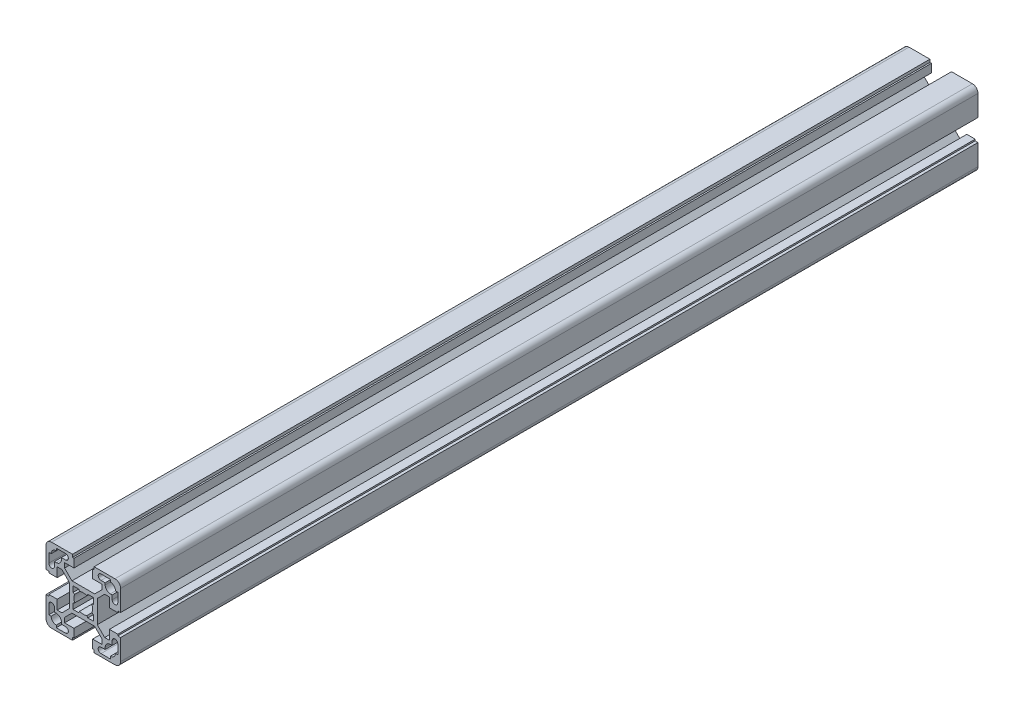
ISO-10303-21;
HEADER;
FILE_DESCRIPTION(('STEP AP214'),'2;1');
FILE_NAME('part.step','',(''),(''),'','','');
FILE_SCHEMA(('AUTOMOTIVE_DESIGN { 1 0 10303 214 1 1 1 1 }'));
ENDSEC;
DATA;
#1=APPLICATION_CONTEXT('core data for automotive mechanical design processes');
#2=APPLICATION_PROTOCOL_DEFINITION('international standard','automotive_design',2000,#1);
#3=PRODUCT_CONTEXT('',#1,'mechanical');
#4=PRODUCT('Part','Part','',(#3));
#5=PRODUCT_RELATED_PRODUCT_CATEGORY('part','',(#4));
#6=PRODUCT_DEFINITION_FORMATION('','',#4);
#7=PRODUCT_DEFINITION_CONTEXT('part definition',#1,'design');
#8=PRODUCT_DEFINITION('design','',#6,#7);
#9=PRODUCT_DEFINITION_SHAPE('','',#8);
#10=(LENGTH_UNIT() NAMED_UNIT(*) SI_UNIT(.MILLI.,.METRE.));
#11=(NAMED_UNIT(*) PLANE_ANGLE_UNIT() SI_UNIT($,.RADIAN.));
#12=(NAMED_UNIT(*) SI_UNIT($,.STERADIAN.) SOLID_ANGLE_UNIT());
#13=UNCERTAINTY_MEASURE_WITH_UNIT(LENGTH_MEASURE(1.E-05),#10,'distance_accuracy_value','');
#14=(GEOMETRIC_REPRESENTATION_CONTEXT(3) GLOBAL_UNCERTAINTY_ASSIGNED_CONTEXT((#13)) GLOBAL_UNIT_ASSIGNED_CONTEXT((#10,
#11,#12)) REPRESENTATION_CONTEXT('',''));
#15=CARTESIAN_POINT('',(0.,0.,0.));
#16=DIRECTION('',(0.,0.,1.));
#17=DIRECTION('',(1.,0.,0.));
#18=AXIS2_PLACEMENT_3D('',#15,#16,#17);
#19=CARTESIAN_POINT('',(-14.5000000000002,-11.75,460.));
#20=DIRECTION('',(0.,-1.,0.));
#21=DIRECTION('',(1.,0.,0.));
#22=AXIS2_PLACEMENT_3D('',#19,#20,#21);
#23=PLANE('',#22);
#24=DIRECTION('',(1.,0.,0.));
#25=VECTOR('',#24,1.);
#26=CARTESIAN_POINT('',(-14.5000000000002,-11.75,460.));
#27=LINE('',#26,#25);
#28=CARTESIAN_POINT('',(-14.5000000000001,-11.75,460.));
#29=VERTEX_POINT('',#28);
#30=CARTESIAN_POINT('',(-15.5000000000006,-11.75,460.));
#31=VERTEX_POINT('',#30);
#32=EDGE_CURVE('E806',#29,#31,#27,.F.);
#33=ORIENTED_EDGE('',*,*,#32,.T.);
#34=DIRECTION('',(0.,0.,1.));
#35=VECTOR('',#34,1.);
#36=CARTESIAN_POINT('',(-15.5000000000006,-11.75,460.));
#37=LINE('',#36,#35);
#38=CARTESIAN_POINT('',(-15.5000000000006,-11.75,0.));
#39=VERTEX_POINT('',#38);
#40=EDGE_CURVE('E804',#39,#31,#37,.T.);
#41=ORIENTED_EDGE('',*,*,#40,.F.);
#42=DIRECTION('',(1.,0.,0.));
#43=VECTOR('',#42,1.);
#44=CARTESIAN_POINT('',(-14.5000000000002,-11.75,0.));
#45=LINE('',#44,#43);
#46=CARTESIAN_POINT('',(-14.5000000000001,-11.75,0.));
#47=VERTEX_POINT('',#46);
#48=EDGE_CURVE('E20',#39,#47,#45,.T.);
#49=ORIENTED_EDGE('',*,*,#48,.T.);
#50=DIRECTION('',(0.,0.,-1.));
#51=VECTOR('',#50,1.);
#52=CARTESIAN_POINT('',(-14.5000000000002,-11.75,460.));
#53=LINE('',#52,#51);
#54=EDGE_CURVE('E801',#47,#29,#53,.F.);
#55=ORIENTED_EDGE('',*,*,#54,.T.);
#56=EDGE_LOOP('',(#33,#41,#49,#55));
#57=FACE_BOUND('',#56,.T.);
#58=ADVANCED_FACE('F17',(#57),#23,.T.);
#59=CARTESIAN_POINT('',(-11.7500000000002,-15.5,460.));
#60=DIRECTION('',(-1.,0.,0.));
#61=DIRECTION('',(0.,-1.,0.));
#62=AXIS2_PLACEMENT_3D('',#59,#60,#61);
#63=PLANE('',#62);
#64=DIRECTION('',(0.,-1.,0.));
#65=VECTOR('',#64,1.);
#66=CARTESIAN_POINT('',(-11.7500000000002,-15.5,460.));
#67=LINE('',#66,#65);
#68=CARTESIAN_POINT('',(-11.7500000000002,-15.5,460.));
#69=VERTEX_POINT('',#68);
#70=CARTESIAN_POINT('',(-11.7500000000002,-14.5,460.));
#71=VERTEX_POINT('',#70);
#72=EDGE_CURVE('E1218',#69,#71,#67,.F.);
#73=ORIENTED_EDGE('',*,*,#72,.T.);
#74=DIRECTION('',(0.,0.,-1.));
#75=VECTOR('',#74,1.);
#76=CARTESIAN_POINT('',(-11.7500000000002,-14.5,460.));
#77=LINE('',#76,#75);
#78=CARTESIAN_POINT('',(-11.7500000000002,-14.5,0.));
#79=VERTEX_POINT('',#78);
#80=EDGE_CURVE('E814',#71,#79,#77,.T.);
#81=ORIENTED_EDGE('',*,*,#80,.T.);
#82=DIRECTION('',(0.,-1.,0.));
#83=VECTOR('',#82,1.);
#84=CARTESIAN_POINT('',(-11.7500000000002,-15.5,0.));
#85=LINE('',#84,#83);
#86=CARTESIAN_POINT('',(-11.7500000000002,-15.5,0.));
#87=VERTEX_POINT('',#86);
#88=EDGE_CURVE('E819',#79,#87,#85,.T.);
#89=ORIENTED_EDGE('',*,*,#88,.T.);
#90=DIRECTION('',(0.,0.,-1.));
#91=VECTOR('',#90,1.);
#92=CARTESIAN_POINT('',(-11.7500000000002,-15.5,460.));
#93=LINE('',#92,#91);
#94=EDGE_CURVE('E1262',#69,#87,#93,.T.);
#95=ORIENTED_EDGE('',*,*,#94,.F.);
#96=EDGE_LOOP('',(#73,#81,#89,#95));
#97=FACE_BOUND('',#96,.T.);
#98=ADVANCED_FACE('F1555',(#97),#63,.T.);
#99=CARTESIAN_POINT('',(-14.5000000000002,-17.25,460.));
#100=DIRECTION('',(1.,0.,0.));
#101=DIRECTION('',(0.,0.,-1.));
#102=AXIS2_PLACEMENT_3D('',#99,#100,#101);
#103=PLANE('',#102);
#104=DIRECTION('',(0.,1.,0.));
#105=VECTOR('',#104,1.);
#106=CARTESIAN_POINT('',(-14.5000000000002,-17.25,460.));
#107=LINE('',#106,#105);
#108=CARTESIAN_POINT('',(-14.5000000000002,-17.25,460.));
#109=VERTEX_POINT('',#108);
#110=CARTESIAN_POINT('',(-14.5000000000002,-18.5,460.));
#111=VERTEX_POINT('',#110);
#112=EDGE_CURVE('E1214',#109,#111,#107,.F.);
#113=ORIENTED_EDGE('',*,*,#112,.T.);
#114=DIRECTION('',(0.,0.,1.));
#115=VECTOR('',#114,1.);
#116=CARTESIAN_POINT('',(-14.5000000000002,-18.5,460.));
#117=LINE('',#116,#115);
#118=CARTESIAN_POINT('',(-14.5000000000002,-18.5,0.));
#119=VERTEX_POINT('',#118);
#120=EDGE_CURVE('E1256',#119,#111,#117,.T.);
#121=ORIENTED_EDGE('',*,*,#120,.F.);
#122=DIRECTION('',(0.,1.,0.));
#123=VECTOR('',#122,1.);
#124=CARTESIAN_POINT('',(-14.5000000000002,-17.25,0.));
#125=LINE('',#124,#123);
#126=CARTESIAN_POINT('',(-14.5000000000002,-17.25,0.));
#127=VERTEX_POINT('',#126);
#128=EDGE_CURVE('E1216',#119,#127,#125,.T.);
#129=ORIENTED_EDGE('',*,*,#128,.T.);
#130=DIRECTION('',(0.,0.,-1.));
#131=VECTOR('',#130,1.);
#132=CARTESIAN_POINT('',(-14.5000000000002,-17.25,460.));
#133=LINE('',#132,#131);
#134=EDGE_CURVE('E1251',#127,#109,#133,.F.);
#135=ORIENTED_EDGE('',*,*,#134,.T.);
#136=EDGE_LOOP('',(#113,#121,#129,#135));
#137=FACE_BOUND('',#136,.T.);
#138=ADVANCED_FACE('F1560',(#137),#103,.T.);
#139=CARTESIAN_POINT('',(-18.5000000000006,-14.5000000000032,460.));
#140=DIRECTION('',(0.,1.,0.));
#141=DIRECTION('',(0.,0.,1.));
#142=AXIS2_PLACEMENT_3D('',#139,#140,#141);
#143=PLANE('',#142);
#144=DIRECTION('',(1.,0.,0.));
#145=VECTOR('',#144,1.);
#146=CARTESIAN_POINT('',(-18.5000000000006,-14.5000000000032,460.));
#147=LINE('',#146,#145);
#148=CARTESIAN_POINT('',(-18.5000000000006,-14.5000000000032,460.));
#149=VERTEX_POINT('',#148);
#150=CARTESIAN_POINT('',(-17.2500000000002,-14.5000000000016,460.));
#151=VERTEX_POINT('',#150);
#152=EDGE_CURVE('E1210',#149,#151,#147,.T.);
#153=ORIENTED_EDGE('',*,*,#152,.T.);
#154=DIRECTION('',(0.,0.,-1.));
#155=VECTOR('',#154,1.);
#156=CARTESIAN_POINT('',(-17.2500000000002,-14.5,460.));
#157=LINE('',#156,#155);
#158=CARTESIAN_POINT('',(-17.2500000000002,-14.5000000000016,0.));
#159=VERTEX_POINT('',#158);
#160=EDGE_CURVE('E1248',#151,#159,#157,.T.);
#161=ORIENTED_EDGE('',*,*,#160,.T.);
#162=DIRECTION('',(1.,0.,0.));
#163=VECTOR('',#162,1.);
#164=CARTESIAN_POINT('',(-18.5000000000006,-14.5000000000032,0.));
#165=LINE('',#164,#163);
#166=CARTESIAN_POINT('',(-18.5000000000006,-14.5000000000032,0.));
#167=VERTEX_POINT('',#166);
#168=EDGE_CURVE('E1212',#159,#167,#165,.F.);
#169=ORIENTED_EDGE('',*,*,#168,.T.);
#170=DIRECTION('',(0.,0.,-1.));
#171=VECTOR('',#170,1.);
#172=CARTESIAN_POINT('',(-18.5000000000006,-14.5000000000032,460.));
#173=LINE('',#172,#171);
#174=EDGE_CURVE('E1242',#149,#167,#173,.T.);
#175=ORIENTED_EDGE('',*,*,#174,.F.);
#176=EDGE_LOOP('',(#153,#161,#169,#175));
#177=FACE_BOUND('',#176,.T.);
#178=ADVANCED_FACE('F1569',(#177),#143,.T.);
#179=CARTESIAN_POINT('',(18.5000000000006,-14.5000000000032,460.));
#180=DIRECTION('',(0.,1.,0.));
#181=DIRECTION('',(0.,0.,1.));
#182=AXIS2_PLACEMENT_3D('',#179,#180,#181);
#183=PLANE('',#182);
#184=DIRECTION('',(1.,0.,0.));
#185=VECTOR('',#184,1.);
#186=CARTESIAN_POINT('',(18.5000000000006,-14.5000000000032,460.));
#187=LINE('',#186,#185);
#188=CARTESIAN_POINT('',(17.2500000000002,-14.5000000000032,460.));
#189=VERTEX_POINT('',#188);
#190=CARTESIAN_POINT('',(18.5000000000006,-14.5000000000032,460.));
#191=VERTEX_POINT('',#190);
#192=EDGE_CURVE('E1206',#189,#191,#187,.T.);
#193=ORIENTED_EDGE('',*,*,#192,.T.);
#194=DIRECTION('',(0.,0.,1.));
#195=VECTOR('',#194,1.);
#196=CARTESIAN_POINT('',(18.5000000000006,-14.5000000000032,460.));
#197=LINE('',#196,#195);
#198=CARTESIAN_POINT('',(18.5000000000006,-14.5000000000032,0.));
#199=VERTEX_POINT('',#198);
#200=EDGE_CURVE('E1947',#199,#191,#197,.T.);
#201=ORIENTED_EDGE('',*,*,#200,.F.);
#202=DIRECTION('',(1.,0.,0.));
#203=VECTOR('',#202,1.);
#204=CARTESIAN_POINT('',(18.5000000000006,-14.5000000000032,0.));
#205=LINE('',#204,#203);
#206=CARTESIAN_POINT('',(17.2500000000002,-14.5000000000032,0.));
#207=VERTEX_POINT('',#206);
#208=EDGE_CURVE('E1208',#199,#207,#205,.F.);
#209=ORIENTED_EDGE('',*,*,#208,.T.);
#210=DIRECTION('',(0.,0.,-1.));
#211=VECTOR('',#210,1.);
#212=CARTESIAN_POINT('',(17.2500000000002,-14.5000000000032,460.));
#213=LINE('',#212,#211);
#214=EDGE_CURVE('E1952',#207,#189,#213,.F.);
#215=ORIENTED_EDGE('',*,*,#214,.T.);
#216=EDGE_LOOP('',(#193,#201,#209,#215));
#217=FACE_BOUND('',#216,.T.);
#218=ADVANCED_FACE('F2472',(#217),#183,.T.);
#219=CARTESIAN_POINT('',(14.5000000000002,-17.25,460.));
#220=DIRECTION('',(-1.,0.,0.));
#221=DIRECTION('',(0.,0.,1.));
#222=AXIS2_PLACEMENT_3D('',#219,#220,#221);
#223=PLANE('',#222);
#224=DIRECTION('',(0.,1.,0.));
#225=VECTOR('',#224,1.);
#226=CARTESIAN_POINT('',(14.5000000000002,-17.25,460.));
#227=LINE('',#226,#225);
#228=CARTESIAN_POINT('',(14.5000000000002,-18.5,460.));
#229=VERTEX_POINT('',#228);
#230=CARTESIAN_POINT('',(14.5000000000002,-17.25,460.));
#231=VERTEX_POINT('',#230);
#232=EDGE_CURVE('E1202',#229,#231,#227,.T.);
#233=ORIENTED_EDGE('',*,*,#232,.T.);
#234=DIRECTION('',(0.,0.,-1.));
#235=VECTOR('',#234,1.);
#236=CARTESIAN_POINT('',(14.5000000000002,-17.25,460.));
#237=LINE('',#236,#235);
#238=CARTESIAN_POINT('',(14.5000000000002,-17.25,0.));
#239=VERTEX_POINT('',#238);
#240=EDGE_CURVE('E1955',#231,#239,#237,.T.);
#241=ORIENTED_EDGE('',*,*,#240,.T.);
#242=DIRECTION('',(0.,1.,0.));
#243=VECTOR('',#242,1.);
#244=CARTESIAN_POINT('',(14.5000000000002,-17.25,0.));
#245=LINE('',#244,#243);
#246=CARTESIAN_POINT('',(14.5000000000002,-18.5,0.));
#247=VERTEX_POINT('',#246);
#248=EDGE_CURVE('E1204',#239,#247,#245,.F.);
#249=ORIENTED_EDGE('',*,*,#248,.T.);
#250=DIRECTION('',(0.,0.,1.));
#251=VECTOR('',#250,1.);
#252=CARTESIAN_POINT('',(14.5000000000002,-18.5,460.));
#253=LINE('',#252,#251);
#254=EDGE_CURVE('E1958',#229,#247,#253,.F.);
#255=ORIENTED_EDGE('',*,*,#254,.F.);
#256=EDGE_LOOP('',(#233,#241,#249,#255));
#257=FACE_BOUND('',#256,.T.);
#258=ADVANCED_FACE('F2468',(#257),#223,.T.);
#259=CARTESIAN_POINT('',(11.7500000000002,-15.5,460.));
#260=DIRECTION('',(1.,0.,0.));
#261=DIRECTION('',(0.,1.,0.));
#262=AXIS2_PLACEMENT_3D('',#259,#260,#261);
#263=PLANE('',#262);
#264=DIRECTION('',(0.,1.,0.));
#265=VECTOR('',#264,1.);
#266=CARTESIAN_POINT('',(11.7500000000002,-15.5,460.));
#267=LINE('',#266,#265);
#268=CARTESIAN_POINT('',(11.7500000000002,-14.5,460.));
#269=VERTEX_POINT('',#268);
#270=CARTESIAN_POINT('',(11.7500000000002,-15.5,460.));
#271=VERTEX_POINT('',#270);
#272=EDGE_CURVE('E1198',#269,#271,#267,.F.);
#273=ORIENTED_EDGE('',*,*,#272,.T.);
#274=DIRECTION('',(0.,0.,-1.));
#275=VECTOR('',#274,1.);
#276=CARTESIAN_POINT('',(11.7500000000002,-15.5,460.));
#277=LINE('',#276,#275);
#278=CARTESIAN_POINT('',(11.7500000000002,-15.5,0.));
#279=VERTEX_POINT('',#278);
#280=EDGE_CURVE('E1964',#279,#271,#277,.F.);
#281=ORIENTED_EDGE('',*,*,#280,.F.);
#282=DIRECTION('',(0.,1.,0.));
#283=VECTOR('',#282,1.);
#284=CARTESIAN_POINT('',(11.7500000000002,-15.5,0.));
#285=LINE('',#284,#283);
#286=CARTESIAN_POINT('',(11.7500000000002,-14.5,0.));
#287=VERTEX_POINT('',#286);
#288=EDGE_CURVE('E1200',#279,#287,#285,.T.);
#289=ORIENTED_EDGE('',*,*,#288,.T.);
#290=DIRECTION('',(0.,0.,-1.));
#291=VECTOR('',#290,1.);
#292=CARTESIAN_POINT('',(11.7500000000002,-14.5,460.));
#293=LINE('',#292,#291);
#294=EDGE_CURVE('E1969',#287,#269,#293,.F.);
#295=ORIENTED_EDGE('',*,*,#294,.T.);
#296=EDGE_LOOP('',(#273,#281,#289,#295));
#297=FACE_BOUND('',#296,.T.);
#298=ADVANCED_FACE('F2465',(#297),#263,.T.);
#299=CARTESIAN_POINT('',(14.5000000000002,-11.75,460.));
#300=DIRECTION('',(0.,-1.,0.));
#301=DIRECTION('',(1.,0.,0.));
#302=AXIS2_PLACEMENT_3D('',#299,#300,#301);
#303=PLANE('',#302);
#304=DIRECTION('',(1.,0.,0.));
#305=VECTOR('',#304,1.);
#306=CARTESIAN_POINT('',(14.5000000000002,-11.75,460.));
#307=LINE('',#306,#305);
#308=CARTESIAN_POINT('',(15.5000000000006,-11.75,460.));
#309=VERTEX_POINT('',#308);
#310=CARTESIAN_POINT('',(14.5000000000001,-11.75,460.));
#311=VERTEX_POINT('',#310);
#312=EDGE_CURVE('E1194',#309,#311,#307,.F.);
#313=ORIENTED_EDGE('',*,*,#312,.T.);
#314=DIRECTION('',(0.,0.,-1.));
#315=VECTOR('',#314,1.);
#316=CARTESIAN_POINT('',(14.5000000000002,-11.75,460.));
#317=LINE('',#316,#315);
#318=CARTESIAN_POINT('',(14.5000000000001,-11.75,0.));
#319=VERTEX_POINT('',#318);
#320=EDGE_CURVE('E1940',#311,#319,#317,.T.);
#321=ORIENTED_EDGE('',*,*,#320,.T.);
#322=DIRECTION('',(1.,0.,0.));
#323=VECTOR('',#322,1.);
#324=CARTESIAN_POINT('',(14.5000000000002,-11.75,0.));
#325=LINE('',#324,#323);
#326=CARTESIAN_POINT('',(15.5000000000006,-11.75,0.));
#327=VERTEX_POINT('',#326);
#328=EDGE_CURVE('E1196',#319,#327,#325,.T.);
#329=ORIENTED_EDGE('',*,*,#328,.T.);
#330=DIRECTION('',(0.,0.,-1.));
#331=VECTOR('',#330,1.);
#332=CARTESIAN_POINT('',(15.5000000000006,-11.75,460.));
#333=LINE('',#332,#331);
#334=EDGE_CURVE('E1237',#309,#327,#333,.T.);
#335=ORIENTED_EDGE('',*,*,#334,.F.);
#336=EDGE_LOOP('',(#313,#321,#329,#335));
#337=FACE_BOUND('',#336,.T.);
#338=ADVANCED_FACE('F1939',(#337),#303,.T.);
#339=CARTESIAN_POINT('',(5.80000000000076,-18.5000000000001,460.));
#340=DIRECTION('',(1.,0.,0.));
#341=DIRECTION('',(0.,0.,-1.));
#342=AXIS2_PLACEMENT_3D('',#339,#340,#341);
#343=PLANE('',#342);
#344=DIRECTION('',(0.,0.,1.));
#345=VECTOR('',#344,1.);
#346=CARTESIAN_POINT('',(5.80000000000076,-20.,460.));
#347=LINE('',#346,#345);
#348=CARTESIAN_POINT('',(5.80000000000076,-20.,0.));
#349=VERTEX_POINT('',#348);
#350=CARTESIAN_POINT('',(5.80000000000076,-20.,460.));
#351=VERTEX_POINT('',#350);
#352=EDGE_CURVE('E1973',#349,#351,#347,.T.);
#353=ORIENTED_EDGE('',*,*,#352,.T.);
#354=DIRECTION('',(0.,1.,0.));
#355=VECTOR('',#354,1.);
#356=CARTESIAN_POINT('',(5.80000000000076,-17.,460.));
#357=LINE('',#356,#355);
#358=CARTESIAN_POINT('',(5.80000000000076,-18.5000000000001,460.));
#359=VERTEX_POINT('',#358);
#360=EDGE_CURVE('E1192',#359,#351,#357,.F.);
#361=ORIENTED_EDGE('',*,*,#360,.F.);
#362=DIRECTION('',(0.,0.,1.));
#363=VECTOR('',#362,1.);
#364=CARTESIAN_POINT('',(5.80000000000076,-18.5000000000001,460.));
#365=LINE('',#364,#363);
#366=CARTESIAN_POINT('',(5.80000000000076,-18.5000000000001,0.));
#367=VERTEX_POINT('',#366);
#368=EDGE_CURVE('E1116',#359,#367,#365,.F.);
#369=ORIENTED_EDGE('',*,*,#368,.T.);
#370=DIRECTION('',(0.,1.,0.));
#371=VECTOR('',#370,1.);
#372=CARTESIAN_POINT('',(5.80000000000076,-17.,0.));
#373=LINE('',#372,#371);
#374=EDGE_CURVE('E1190',#349,#367,#373,.T.);
#375=ORIENTED_EDGE('',*,*,#374,.F.);
#376=EDGE_LOOP('',(#353,#361,#369,#375));
#377=FACE_BOUND('',#376,.T.);
#378=ADVANCED_FACE('F2286',(#377),#343,.F.);
#379=CARTESIAN_POINT('',(20.,-5.79999999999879,460.));
#380=DIRECTION('',(0.,-1.,0.));
#381=DIRECTION('',(0.,0.,-1.));
#382=AXIS2_PLACEMENT_3D('',#379,#380,#381);
#383=PLANE('',#382);
#384=DIRECTION('',(0.,0.,1.));
#385=VECTOR('',#384,1.);
#386=CARTESIAN_POINT('',(18.5,-5.79999999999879,460.));
#387=LINE('',#386,#385);
#388=CARTESIAN_POINT('',(18.5,-5.79999999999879,0.));
#389=VERTEX_POINT('',#388);
#390=CARTESIAN_POINT('',(18.5,-5.79999999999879,460.));
#391=VERTEX_POINT('',#390);
#392=EDGE_CURVE('E1185',#389,#391,#387,.T.);
#393=ORIENTED_EDGE('',*,*,#392,.T.);
#394=DIRECTION('',(1.,0.,0.));
#395=VECTOR('',#394,1.);
#396=CARTESIAN_POINT('',(17.,-5.79999999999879,460.));
#397=LINE('',#396,#395);
#398=CARTESIAN_POINT('',(20.,-5.79999999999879,460.));
#399=VERTEX_POINT('',#398);
#400=EDGE_CURVE('E1188',#399,#391,#397,.F.);
#401=ORIENTED_EDGE('',*,*,#400,.F.);
#402=DIRECTION('',(0.,0.,1.));
#403=VECTOR('',#402,1.);
#404=CARTESIAN_POINT('',(20.,-5.79999999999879,460.));
#405=LINE('',#404,#403);
#406=CARTESIAN_POINT('',(20.,-5.79999999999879,0.));
#407=VERTEX_POINT('',#406);
#408=EDGE_CURVE('E1981',#399,#407,#405,.F.);
#409=ORIENTED_EDGE('',*,*,#408,.T.);
#410=DIRECTION('',(1.,0.,0.));
#411=VECTOR('',#410,1.);
#412=CARTESIAN_POINT('',(17.,-5.79999999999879,0.));
#413=LINE('',#412,#411);
#414=EDGE_CURVE('E1186',#389,#407,#413,.T.);
#415=ORIENTED_EDGE('',*,*,#414,.F.);
#416=EDGE_LOOP('',(#393,#401,#409,#415));
#417=FACE_BOUND('',#416,.T.);
#418=ADVANCED_FACE('F2294',(#417),#383,.F.);
#419=CARTESIAN_POINT('',(18.5,-5.79999999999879,460.));
#420=DIRECTION('',(-1.,0.,0.));
#421=DIRECTION('',(0.,0.,1.));
#422=AXIS2_PLACEMENT_3D('',#419,#420,#421);
#423=PLANE('',#422);
#424=DIRECTION('',(0.,0.,-1.));
#425=VECTOR('',#424,1.);
#426=CARTESIAN_POINT('',(18.5,-4.99999999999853,460.));
#427=LINE('',#426,#425);
#428=CARTESIAN_POINT('',(18.5,-4.99999999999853,0.));
#429=VERTEX_POINT('',#428);
#430=CARTESIAN_POINT('',(18.5,-4.99999999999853,460.));
#431=VERTEX_POINT('',#430);
#432=EDGE_CURVE('E1984',#429,#431,#427,.F.);
#433=ORIENTED_EDGE('',*,*,#432,.T.);
#434=DIRECTION('',(0.,1.,0.));
#435=VECTOR('',#434,1.);
#436=CARTESIAN_POINT('',(18.5,-17.,460.));
#437=LINE('',#436,#435);
#438=EDGE_CURVE('E1183',#391,#431,#437,.T.);
#439=ORIENTED_EDGE('',*,*,#438,.F.);
#440=ORIENTED_EDGE('',*,*,#392,.F.);
#441=DIRECTION('',(0.,1.,0.));
#442=VECTOR('',#441,1.);
#443=CARTESIAN_POINT('',(18.5,-17.,0.));
#444=LINE('',#443,#442);
#445=EDGE_CURVE('E1180',#429,#389,#444,.F.);
#446=ORIENTED_EDGE('',*,*,#445,.F.);
#447=EDGE_LOOP('',(#433,#439,#440,#446));
#448=FACE_BOUND('',#447,.T.);
#449=ADVANCED_FACE('F2297',(#448),#423,.F.);
#450=CARTESIAN_POINT('',(18.5,5.79999999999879,460.));
#451=DIRECTION('',(-1.,0.,0.));
#452=DIRECTION('',(0.,0.,1.));
#453=AXIS2_PLACEMENT_3D('',#450,#451,#452);
#454=PLANE('',#453);
#455=DIRECTION('',(0.,0.,1.));
#456=VECTOR('',#455,1.);
#457=CARTESIAN_POINT('',(18.5,5.79999999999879,460.));
#458=LINE('',#457,#456);
#459=CARTESIAN_POINT('',(18.5,5.79999999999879,0.));
#460=VERTEX_POINT('',#459);
#461=CARTESIAN_POINT('',(18.5,5.79999999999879,460.));
#462=VERTEX_POINT('',#461);
#463=EDGE_CURVE('E1175',#460,#462,#458,.T.);
#464=ORIENTED_EDGE('',*,*,#463,.T.);
#465=DIRECTION('',(0.,1.,0.));
#466=VECTOR('',#465,1.);
#467=CARTESIAN_POINT('',(18.5,-17.,460.));
#468=LINE('',#467,#466);
#469=CARTESIAN_POINT('',(18.5,4.99999999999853,460.));
#470=VERTEX_POINT('',#469);
#471=EDGE_CURVE('E1178',#470,#462,#468,.T.);
#472=ORIENTED_EDGE('',*,*,#471,.F.);
#473=DIRECTION('',(0.,0.,1.));
#474=VECTOR('',#473,1.);
#475=CARTESIAN_POINT('',(18.5,4.99999999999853,460.));
#476=LINE('',#475,#474);
#477=CARTESIAN_POINT('',(18.5,4.99999999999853,0.));
#478=VERTEX_POINT('',#477);
#479=EDGE_CURVE('E2011',#470,#478,#476,.F.);
#480=ORIENTED_EDGE('',*,*,#479,.T.);
#481=DIRECTION('',(0.,1.,0.));
#482=VECTOR('',#481,1.);
#483=CARTESIAN_POINT('',(18.5,-17.,0.));
#484=LINE('',#483,#482);
#485=EDGE_CURVE('E1176',#460,#478,#484,.F.);
#486=ORIENTED_EDGE('',*,*,#485,.F.);
#487=EDGE_LOOP('',(#464,#472,#480,#486));
#488=FACE_BOUND('',#487,.T.);
#489=ADVANCED_FACE('F2319',(#488),#454,.F.);
#490=CARTESIAN_POINT('',(20.,5.79999999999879,460.));
#491=DIRECTION('',(0.,1.,0.));
#492=DIRECTION('',(0.,0.,1.));
#493=AXIS2_PLACEMENT_3D('',#490,#491,#492);
#494=PLANE('',#493);
#495=DIRECTION('',(0.,0.,1.));
#496=VECTOR('',#495,1.);
#497=CARTESIAN_POINT('',(20.,5.79999999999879,460.));
#498=LINE('',#497,#496);
#499=CARTESIAN_POINT('',(20.,5.79999999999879,0.));
#500=VERTEX_POINT('',#499);
#501=CARTESIAN_POINT('',(20.,5.79999999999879,460.));
#502=VERTEX_POINT('',#501);
#503=EDGE_CURVE('E2014',#500,#502,#498,.T.);
#504=ORIENTED_EDGE('',*,*,#503,.T.);
#505=DIRECTION('',(1.,0.,0.));
#506=VECTOR('',#505,1.);
#507=CARTESIAN_POINT('',(17.,5.79999999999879,460.));
#508=LINE('',#507,#506);
#509=EDGE_CURVE('E1173',#462,#502,#508,.T.);
#510=ORIENTED_EDGE('',*,*,#509,.F.);
#511=ORIENTED_EDGE('',*,*,#463,.F.);
#512=DIRECTION('',(1.,0.,0.));
#513=VECTOR('',#512,1.);
#514=CARTESIAN_POINT('',(17.,5.79999999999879,0.));
#515=LINE('',#514,#513);
#516=EDGE_CURVE('E1170',#500,#460,#515,.F.);
#517=ORIENTED_EDGE('',*,*,#516,.F.);
#518=EDGE_LOOP('',(#504,#510,#511,#517));
#519=FACE_BOUND('',#518,.T.);
#520=ADVANCED_FACE('F2323',(#519),#494,.F.);
#521=CARTESIAN_POINT('',(5.80000000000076,18.5000000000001,460.));
#522=DIRECTION('',(1.,0.,0.));
#523=DIRECTION('',(0.,0.,-1.));
#524=AXIS2_PLACEMENT_3D('',#521,#522,#523);
#525=PLANE('',#524);
#526=DIRECTION('',(0.,0.,-1.));
#527=VECTOR('',#526,1.);
#528=CARTESIAN_POINT('',(5.80000000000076,18.5000000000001,460.));
#529=LINE('',#528,#527);
#530=CARTESIAN_POINT('',(5.80000000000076,18.5000000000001,0.));
#531=VERTEX_POINT('',#530);
#532=CARTESIAN_POINT('',(5.80000000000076,18.5000000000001,460.));
#533=VERTEX_POINT('',#532);
#534=EDGE_CURVE('E1165',#531,#533,#529,.F.);
#535=ORIENTED_EDGE('',*,*,#534,.T.);
#536=DIRECTION('',(0.,1.,0.));
#537=VECTOR('',#536,1.);
#538=CARTESIAN_POINT('',(5.80000000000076,-17.,460.));
#539=LINE('',#538,#537);
#540=CARTESIAN_POINT('',(5.80000000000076,20.,460.));
#541=VERTEX_POINT('',#540);
#542=EDGE_CURVE('E1168',#541,#533,#539,.F.);
#543=ORIENTED_EDGE('',*,*,#542,.F.);
#544=DIRECTION('',(0.,0.,-1.));
#545=VECTOR('',#544,1.);
#546=CARTESIAN_POINT('',(5.80000000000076,20.,460.));
#547=LINE('',#546,#545);
#548=CARTESIAN_POINT('',(5.80000000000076,20.,0.));
#549=VERTEX_POINT('',#548);
#550=EDGE_CURVE('E2022',#541,#549,#547,.T.);
#551=ORIENTED_EDGE('',*,*,#550,.T.);
#552=DIRECTION('',(0.,1.,0.));
#553=VECTOR('',#552,1.);
#554=CARTESIAN_POINT('',(5.80000000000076,-17.,0.));
#555=LINE('',#554,#553);
#556=EDGE_CURVE('E1166',#531,#549,#555,.T.);
#557=ORIENTED_EDGE('',*,*,#556,.F.);
#558=EDGE_LOOP('',(#535,#543,#551,#557));
#559=FACE_BOUND('',#558,.T.);
#560=ADVANCED_FACE('F2334',(#559),#525,.F.);
#561=CARTESIAN_POINT('',(5.00000000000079,18.5000000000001,460.));
#562=DIRECTION('',(0.,-1.,0.));
#563=DIRECTION('',(0.,0.,-1.));
#564=AXIS2_PLACEMENT_3D('',#561,#562,#563);
#565=PLANE('',#564);
#566=DIRECTION('',(0.,0.,1.));
#567=VECTOR('',#566,1.);
#568=CARTESIAN_POINT('',(5.00000000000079,18.5000000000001,460.));
#569=LINE('',#568,#567);
#570=CARTESIAN_POINT('',(5.00000000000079,18.5000000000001,0.));
#571=VERTEX_POINT('',#570);
#572=CARTESIAN_POINT('',(5.00000000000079,18.5000000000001,460.));
#573=VERTEX_POINT('',#572);
#574=EDGE_CURVE('E2025',#571,#573,#569,.T.);
#575=ORIENTED_EDGE('',*,*,#574,.T.);
#576=DIRECTION('',(1.,0.,0.));
#577=VECTOR('',#576,1.);
#578=CARTESIAN_POINT('',(17.,18.5000000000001,460.));
#579=LINE('',#578,#577);
#580=EDGE_CURVE('E1163',#533,#573,#579,.F.);
#581=ORIENTED_EDGE('',*,*,#580,.F.);
#582=ORIENTED_EDGE('',*,*,#534,.F.);
#583=DIRECTION('',(1.,0.,0.));
#584=VECTOR('',#583,1.);
#585=CARTESIAN_POINT('',(17.,18.5000000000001,0.));
#586=LINE('',#585,#584);
#587=EDGE_CURVE('E1160',#571,#531,#586,.T.);
#588=ORIENTED_EDGE('',*,*,#587,.F.);
#589=EDGE_LOOP('',(#575,#581,#582,#588));
#590=FACE_BOUND('',#589,.T.);
#591=ADVANCED_FACE('F2338',(#590),#565,.F.);
#592=CARTESIAN_POINT('',(-5.00000000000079,18.5000000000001,460.));
#593=DIRECTION('',(0.,-1.,0.));
#594=DIRECTION('',(0.,0.,-1.));
#595=AXIS2_PLACEMENT_3D('',#592,#593,#594);
#596=PLANE('',#595);
#597=DIRECTION('',(0.,0.,1.));
#598=VECTOR('',#597,1.);
#599=CARTESIAN_POINT('',(-5.80000000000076,18.5000000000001,460.));
#600=LINE('',#599,#598);
#601=CARTESIAN_POINT('',(-5.80000000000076,18.5000000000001,0.));
#602=VERTEX_POINT('',#601);
#603=CARTESIAN_POINT('',(-5.80000000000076,18.5000000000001,460.));
#604=VERTEX_POINT('',#603);
#605=EDGE_CURVE('E1155',#602,#604,#600,.T.);
#606=ORIENTED_EDGE('',*,*,#605,.T.);
#607=DIRECTION('',(1.,0.,0.));
#608=VECTOR('',#607,1.);
#609=CARTESIAN_POINT('',(17.,18.5000000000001,460.));
#610=LINE('',#609,#608);
#611=CARTESIAN_POINT('',(-5.00000000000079,18.5000000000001,460.));
#612=VERTEX_POINT('',#611);
#613=EDGE_CURVE('E1158',#612,#604,#610,.F.);
#614=ORIENTED_EDGE('',*,*,#613,.F.);
#615=DIRECTION('',(0.,0.,1.));
#616=VECTOR('',#615,1.);
#617=CARTESIAN_POINT('',(-5.00000000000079,18.5000000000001,460.));
#618=LINE('',#617,#616);
#619=CARTESIAN_POINT('',(-5.00000000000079,18.5000000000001,0.));
#620=VERTEX_POINT('',#619);
#621=EDGE_CURVE('E2052',#612,#620,#618,.F.);
#622=ORIENTED_EDGE('',*,*,#621,.T.);
#623=DIRECTION('',(1.,0.,0.));
#624=VECTOR('',#623,1.);
#625=CARTESIAN_POINT('',(17.,18.5000000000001,0.));
#626=LINE('',#625,#624);
#627=EDGE_CURVE('E1156',#602,#620,#626,.T.);
#628=ORIENTED_EDGE('',*,*,#627,.F.);
#629=EDGE_LOOP('',(#606,#614,#622,#628));
#630=FACE_BOUND('',#629,.T.);
#631=ADVANCED_FACE('F2360',(#630),#596,.F.);
#632=CARTESIAN_POINT('',(-5.80000000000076,18.5000000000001,460.));
#633=DIRECTION('',(-1.,0.,0.));
#634=DIRECTION('',(0.,0.,1.));
#635=AXIS2_PLACEMENT_3D('',#632,#633,#634);
#636=PLANE('',#635);
#637=DIRECTION('',(0.,0.,1.));
#638=VECTOR('',#637,1.);
#639=CARTESIAN_POINT('',(-5.80000000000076,20.,460.));
#640=LINE('',#639,#638);
#641=CARTESIAN_POINT('',(-5.80000000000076,20.,0.));
#642=VERTEX_POINT('',#641);
#643=CARTESIAN_POINT('',(-5.80000000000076,20.,460.));
#644=VERTEX_POINT('',#643);
#645=EDGE_CURVE('E2055',#642,#644,#640,.T.);
#646=ORIENTED_EDGE('',*,*,#645,.T.);
#647=DIRECTION('',(0.,1.,0.));
#648=VECTOR('',#647,1.);
#649=CARTESIAN_POINT('',(-5.80000000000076,-17.,460.));
#650=LINE('',#649,#648);
#651=EDGE_CURVE('E1153',#604,#644,#650,.T.);
#652=ORIENTED_EDGE('',*,*,#651,.F.);
#653=ORIENTED_EDGE('',*,*,#605,.F.);
#654=DIRECTION('',(0.,1.,0.));
#655=VECTOR('',#654,1.);
#656=CARTESIAN_POINT('',(-5.80000000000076,-17.,0.));
#657=LINE('',#656,#655);
#658=EDGE_CURVE('E1150',#642,#602,#657,.F.);
#659=ORIENTED_EDGE('',*,*,#658,.F.);
#660=EDGE_LOOP('',(#646,#652,#653,#659));
#661=FACE_BOUND('',#660,.T.);
#662=ADVANCED_FACE('F2364',(#661),#636,.F.);
#663=CARTESIAN_POINT('',(-20.,5.79999999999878,460.));
#664=DIRECTION('',(0.,1.,0.));
#665=DIRECTION('',(0.,0.,1.));
#666=AXIS2_PLACEMENT_3D('',#663,#664,#665);
#667=PLANE('',#666);
#668=DIRECTION('',(0.,0.,-1.));
#669=VECTOR('',#668,1.);
#670=CARTESIAN_POINT('',(-18.5,5.79999999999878,460.));
#671=LINE('',#670,#669);
#672=CARTESIAN_POINT('',(-18.5,5.79999999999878,0.));
#673=VERTEX_POINT('',#672);
#674=CARTESIAN_POINT('',(-18.5,5.79999999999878,460.));
#675=VERTEX_POINT('',#674);
#676=EDGE_CURVE('E1145',#673,#675,#671,.F.);
#677=ORIENTED_EDGE('',*,*,#676,.T.);
#678=DIRECTION('',(1.,0.,0.));
#679=VECTOR('',#678,1.);
#680=CARTESIAN_POINT('',(17.,5.79999999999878,460.));
#681=LINE('',#680,#679);
#682=CARTESIAN_POINT('',(-20.,5.79999999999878,460.));
#683=VERTEX_POINT('',#682);
#684=EDGE_CURVE('E1148',#683,#675,#681,.T.);
#685=ORIENTED_EDGE('',*,*,#684,.F.);
#686=DIRECTION('',(0.,0.,1.));
#687=VECTOR('',#686,1.);
#688=CARTESIAN_POINT('',(-20.,5.79999999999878,460.));
#689=LINE('',#688,#687);
#690=CARTESIAN_POINT('',(-20.,5.79999999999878,0.));
#691=VERTEX_POINT('',#690);
#692=EDGE_CURVE('E2063',#683,#691,#689,.F.);
#693=ORIENTED_EDGE('',*,*,#692,.T.);
#694=DIRECTION('',(1.,0.,0.));
#695=VECTOR('',#694,1.);
#696=CARTESIAN_POINT('',(17.,5.79999999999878,0.));
#697=LINE('',#696,#695);
#698=EDGE_CURVE('E1146',#673,#691,#697,.F.);
#699=ORIENTED_EDGE('',*,*,#698,.F.);
#700=EDGE_LOOP('',(#677,#685,#693,#699));
#701=FACE_BOUND('',#700,.T.);
#702=ADVANCED_FACE('F2375',(#701),#667,.F.);
#703=CARTESIAN_POINT('',(-18.5,5.79999999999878,460.));
#704=DIRECTION('',(1.,0.,0.));
#705=DIRECTION('',(0.,0.,-1.));
#706=AXIS2_PLACEMENT_3D('',#703,#704,#705);
#707=PLANE('',#706);
#708=DIRECTION('',(0.,0.,1.));
#709=VECTOR('',#708,1.);
#710=CARTESIAN_POINT('',(-18.5,4.99999999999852,460.));
#711=LINE('',#710,#709);
#712=CARTESIAN_POINT('',(-18.5,4.99999999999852,0.));
#713=VERTEX_POINT('',#712);
#714=CARTESIAN_POINT('',(-18.5,4.99999999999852,460.));
#715=VERTEX_POINT('',#714);
#716=EDGE_CURVE('E2066',#713,#715,#711,.T.);
#717=ORIENTED_EDGE('',*,*,#716,.T.);
#718=DIRECTION('',(0.,1.,0.));
#719=VECTOR('',#718,1.);
#720=CARTESIAN_POINT('',(-18.5,-17.,460.));
#721=LINE('',#720,#719);
#722=EDGE_CURVE('E1143',#675,#715,#721,.F.);
#723=ORIENTED_EDGE('',*,*,#722,.F.);
#724=ORIENTED_EDGE('',*,*,#676,.F.);
#725=DIRECTION('',(0.,1.,0.));
#726=VECTOR('',#725,1.);
#727=CARTESIAN_POINT('',(-18.5,-17.,0.));
#728=LINE('',#727,#726);
#729=EDGE_CURVE('E1140',#713,#673,#728,.T.);
#730=ORIENTED_EDGE('',*,*,#729,.F.);
#731=EDGE_LOOP('',(#717,#723,#724,#730));
#732=FACE_BOUND('',#731,.T.);
#733=ADVANCED_FACE('F2379',(#732),#707,.F.);
#734=CARTESIAN_POINT('',(-18.5,-5.79999999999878,460.));
#735=DIRECTION('',(1.,0.,0.));
#736=DIRECTION('',(0.,0.,-1.));
#737=AXIS2_PLACEMENT_3D('',#734,#735,#736);
#738=PLANE('',#737);
#739=DIRECTION('',(0.,0.,-1.));
#740=VECTOR('',#739,1.);
#741=CARTESIAN_POINT('',(-18.5,-5.79999999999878,460.));
#742=LINE('',#741,#740);
#743=CARTESIAN_POINT('',(-18.5,-5.79999999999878,0.));
#744=VERTEX_POINT('',#743);
#745=CARTESIAN_POINT('',(-18.5,-5.79999999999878,460.));
#746=VERTEX_POINT('',#745);
#747=EDGE_CURVE('E1135',#744,#746,#742,.F.);
#748=ORIENTED_EDGE('',*,*,#747,.T.);
#749=DIRECTION('',(0.,1.,0.));
#750=VECTOR('',#749,1.);
#751=CARTESIAN_POINT('',(-18.5,-17.,460.));
#752=LINE('',#751,#750);
#753=CARTESIAN_POINT('',(-18.5,-4.99999999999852,460.));
#754=VERTEX_POINT('',#753);
#755=EDGE_CURVE('E1138',#754,#746,#752,.F.);
#756=ORIENTED_EDGE('',*,*,#755,.F.);
#757=DIRECTION('',(0.,0.,1.));
#758=VECTOR('',#757,1.);
#759=CARTESIAN_POINT('',(-18.5,-4.99999999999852,460.));
#760=LINE('',#759,#758);
#761=CARTESIAN_POINT('',(-18.5,-4.99999999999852,0.));
#762=VERTEX_POINT('',#761);
#763=EDGE_CURVE('E2093',#754,#762,#760,.F.);
#764=ORIENTED_EDGE('',*,*,#763,.T.);
#765=DIRECTION('',(0.,1.,0.));
#766=VECTOR('',#765,1.);
#767=CARTESIAN_POINT('',(-18.5,-17.,0.));
#768=LINE('',#767,#766);
#769=EDGE_CURVE('E1136',#744,#762,#768,.T.);
#770=ORIENTED_EDGE('',*,*,#769,.F.);
#771=EDGE_LOOP('',(#748,#756,#764,#770));
#772=FACE_BOUND('',#771,.T.);
#773=ADVANCED_FACE('F2401',(#772),#738,.F.);
#774=CARTESIAN_POINT('',(-20.,-5.79999999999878,460.));
#775=DIRECTION('',(0.,-1.,0.));
#776=DIRECTION('',(0.,0.,-1.));
#777=AXIS2_PLACEMENT_3D('',#774,#775,#776);
#778=PLANE('',#777);
#779=DIRECTION('',(0.,0.,1.));
#780=VECTOR('',#779,1.);
#781=CARTESIAN_POINT('',(-20.,-5.79999999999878,460.));
#782=LINE('',#781,#780);
#783=CARTESIAN_POINT('',(-20.,-5.79999999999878,0.));
#784=VERTEX_POINT('',#783);
#785=CARTESIAN_POINT('',(-20.,-5.79999999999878,460.));
#786=VERTEX_POINT('',#785);
#787=EDGE_CURVE('E2096',#784,#786,#782,.T.);
#788=ORIENTED_EDGE('',*,*,#787,.T.);
#789=DIRECTION('',(1.,0.,0.));
#790=VECTOR('',#789,1.);
#791=CARTESIAN_POINT('',(17.,-5.79999999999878,460.));
#792=LINE('',#791,#790);
#793=EDGE_CURVE('E1133',#746,#786,#792,.F.);
#794=ORIENTED_EDGE('',*,*,#793,.F.);
#795=ORIENTED_EDGE('',*,*,#747,.F.);
#796=DIRECTION('',(1.,0.,0.));
#797=VECTOR('',#796,1.);
#798=CARTESIAN_POINT('',(17.,-5.79999999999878,0.));
#799=LINE('',#798,#797);
#800=EDGE_CURVE('E1130',#784,#744,#799,.T.);
#801=ORIENTED_EDGE('',*,*,#800,.F.);
#802=EDGE_LOOP('',(#788,#794,#795,#801));
#803=FACE_BOUND('',#802,.T.);
#804=ADVANCED_FACE('F2405',(#803),#778,.F.);
#805=CARTESIAN_POINT('',(-5.80000000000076,-18.5000000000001,460.));
#806=DIRECTION('',(-1.,0.,0.));
#807=DIRECTION('',(0.,0.,1.));
#808=AXIS2_PLACEMENT_3D('',#805,#806,#807);
#809=PLANE('',#808);
#810=DIRECTION('',(0.,0.,1.));
#811=VECTOR('',#810,1.);
#812=CARTESIAN_POINT('',(-5.80000000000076,-18.5000000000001,460.));
#813=LINE('',#812,#811);
#814=CARTESIAN_POINT('',(-5.80000000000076,-18.5000000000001,0.));
#815=VERTEX_POINT('',#814);
#816=CARTESIAN_POINT('',(-5.80000000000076,-18.5000000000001,460.));
#817=VERTEX_POINT('',#816);
#818=EDGE_CURVE('E1125',#815,#817,#813,.T.);
#819=ORIENTED_EDGE('',*,*,#818,.T.);
#820=DIRECTION('',(0.,1.,0.));
#821=VECTOR('',#820,1.);
#822=CARTESIAN_POINT('',(-5.80000000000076,-17.,460.));
#823=LINE('',#822,#821);
#824=CARTESIAN_POINT('',(-5.80000000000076,-20.,460.));
#825=VERTEX_POINT('',#824);
#826=EDGE_CURVE('E1128',#825,#817,#823,.T.);
#827=ORIENTED_EDGE('',*,*,#826,.F.);
#828=DIRECTION('',(0.,0.,1.));
#829=VECTOR('',#828,1.);
#830=CARTESIAN_POINT('',(-5.80000000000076,-20.,460.));
#831=LINE('',#830,#829);
#832=CARTESIAN_POINT('',(-5.80000000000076,-20.,0.));
#833=VERTEX_POINT('',#832);
#834=EDGE_CURVE('E2104',#825,#833,#831,.F.);
#835=ORIENTED_EDGE('',*,*,#834,.T.);
#836=DIRECTION('',(0.,1.,0.));
#837=VECTOR('',#836,1.);
#838=CARTESIAN_POINT('',(-5.80000000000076,-17.,0.));
#839=LINE('',#838,#837);
#840=EDGE_CURVE('E1126',#815,#833,#839,.F.);
#841=ORIENTED_EDGE('',*,*,#840,.F.);
#842=EDGE_LOOP('',(#819,#827,#835,#841));
#843=FACE_BOUND('',#842,.T.);
#844=ADVANCED_FACE('F2416',(#843),#809,.F.);
#845=CARTESIAN_POINT('',(-5.00000000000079,-18.5000000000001,460.));
#846=DIRECTION('',(0.,1.,0.));
#847=DIRECTION('',(0.,0.,1.));
#848=AXIS2_PLACEMENT_3D('',#845,#846,#847);
#849=PLANE('',#848);
#850=DIRECTION('',(0.,0.,1.));
#851=VECTOR('',#850,1.);
#852=CARTESIAN_POINT('',(-5.00000000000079,-18.5000000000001,460.));
#853=LINE('',#852,#851);
#854=CARTESIAN_POINT('',(-5.00000000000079,-18.5000000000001,0.));
#855=VERTEX_POINT('',#854);
#856=CARTESIAN_POINT('',(-5.00000000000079,-18.5000000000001,460.));
#857=VERTEX_POINT('',#856);
#858=EDGE_CURVE('E2107',#855,#857,#853,.T.);
#859=ORIENTED_EDGE('',*,*,#858,.T.);
#860=DIRECTION('',(1.,0.,0.));
#861=VECTOR('',#860,1.);
#862=CARTESIAN_POINT('',(17.,-18.5000000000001,460.));
#863=LINE('',#862,#861);
#864=EDGE_CURVE('E1123',#817,#857,#863,.T.);
#865=ORIENTED_EDGE('',*,*,#864,.F.);
#866=ORIENTED_EDGE('',*,*,#818,.F.);
#867=DIRECTION('',(1.,0.,0.));
#868=VECTOR('',#867,1.);
#869=CARTESIAN_POINT('',(17.,-18.5000000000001,0.));
#870=LINE('',#869,#868);
#871=EDGE_CURVE('E1120',#855,#815,#870,.F.);
#872=ORIENTED_EDGE('',*,*,#871,.F.);
#873=EDGE_LOOP('',(#859,#865,#866,#872));
#874=FACE_BOUND('',#873,.T.);
#875=ADVANCED_FACE('F2420',(#874),#849,.F.);
#876=CARTESIAN_POINT('',(5.00000000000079,-18.5000000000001,460.));
#877=DIRECTION('',(0.,1.,0.));
#878=DIRECTION('',(0.,0.,1.));
#879=AXIS2_PLACEMENT_3D('',#876,#877,#878);
#880=PLANE('',#879);
#881=ORIENTED_EDGE('',*,*,#368,.F.);
#882=DIRECTION('',(1.,0.,0.));
#883=VECTOR('',#882,1.);
#884=CARTESIAN_POINT('',(17.,-18.5000000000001,460.));
#885=LINE('',#884,#883);
#886=CARTESIAN_POINT('',(5.00000000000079,-18.5000000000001,460.));
#887=VERTEX_POINT('',#886);
#888=EDGE_CURVE('E1117',#887,#359,#885,.T.);
#889=ORIENTED_EDGE('',*,*,#888,.F.);
#890=DIRECTION('',(0.,0.,1.));
#891=VECTOR('',#890,1.);
#892=CARTESIAN_POINT('',(5.00000000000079,-18.5000000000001,460.));
#893=LINE('',#892,#891);
#894=CARTESIAN_POINT('',(5.00000000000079,-18.5000000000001,0.));
#895=VERTEX_POINT('',#894);
#896=EDGE_CURVE('E2126',#887,#895,#893,.F.);
#897=ORIENTED_EDGE('',*,*,#896,.T.);
#898=DIRECTION('',(1.,0.,0.));
#899=VECTOR('',#898,1.);
#900=CARTESIAN_POINT('',(17.,-18.5000000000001,0.));
#901=LINE('',#900,#899);
#902=EDGE_CURVE('E1114',#367,#895,#901,.F.);
#903=ORIENTED_EDGE('',*,*,#902,.F.);
#904=EDGE_LOOP('',(#881,#889,#897,#903));
#905=FACE_BOUND('',#904,.T.);
#906=ADVANCED_FACE('F2277',(#905),#880,.F.);
#907=CARTESIAN_POINT('',(14.5000000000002,11.75,460.));
#908=DIRECTION('',(0.,1.,0.));
#909=DIRECTION('',(-1.,0.,0.));
#910=AXIS2_PLACEMENT_3D('',#907,#908,#909);
#911=PLANE('',#910);
#912=DIRECTION('',(-1.,0.,0.));
#913=VECTOR('',#912,1.);
#914=CARTESIAN_POINT('',(14.5000000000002,11.75,460.));
#915=LINE('',#914,#913);
#916=CARTESIAN_POINT('',(14.5000000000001,11.75,460.));
#917=VERTEX_POINT('',#916);
#918=CARTESIAN_POINT('',(15.5000000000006,11.75,460.));
#919=VERTEX_POINT('',#918);
#920=EDGE_CURVE('E1110',#917,#919,#915,.F.);
#921=ORIENTED_EDGE('',*,*,#920,.T.);
#922=DIRECTION('',(0.,0.,-1.));
#923=VECTOR('',#922,1.);
#924=CARTESIAN_POINT('',(15.5000000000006,11.75,460.));
#925=LINE('',#924,#923);
#926=CARTESIAN_POINT('',(15.5000000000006,11.75,0.));
#927=VERTEX_POINT('',#926);
#928=EDGE_CURVE('E2129',#927,#919,#925,.F.);
#929=ORIENTED_EDGE('',*,*,#928,.F.);
#930=DIRECTION('',(-1.,0.,0.));
#931=VECTOR('',#930,1.);
#932=CARTESIAN_POINT('',(14.5000000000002,11.75,0.));
#933=LINE('',#932,#931);
#934=CARTESIAN_POINT('',(14.5000000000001,11.75,0.));
#935=VERTEX_POINT('',#934);
#936=EDGE_CURVE('E1112',#927,#935,#933,.T.);
#937=ORIENTED_EDGE('',*,*,#936,.T.);
#938=DIRECTION('',(0.,0.,-1.));
#939=VECTOR('',#938,1.);
#940=CARTESIAN_POINT('',(14.5000000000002,11.75,460.));
#941=LINE('',#940,#939);
#942=EDGE_CURVE('E2132',#935,#917,#941,.F.);
#943=ORIENTED_EDGE('',*,*,#942,.T.);
#944=EDGE_LOOP('',(#921,#929,#937,#943));
#945=FACE_BOUND('',#944,.T.);
#946=ADVANCED_FACE('F2432',(#945),#911,.T.);
#947=CARTESIAN_POINT('',(11.7500000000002,15.5,460.));
#948=DIRECTION('',(1.,0.,0.));
#949=DIRECTION('',(0.,1.,0.));
#950=AXIS2_PLACEMENT_3D('',#947,#948,#949);
#951=PLANE('',#950);
#952=DIRECTION('',(0.,1.,0.));
#953=VECTOR('',#952,1.);
#954=CARTESIAN_POINT('',(11.7500000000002,15.5,460.));
#955=LINE('',#954,#953);
#956=CARTESIAN_POINT('',(11.7500000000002,15.5,460.));
#957=VERTEX_POINT('',#956);
#958=CARTESIAN_POINT('',(11.7500000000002,14.5,460.));
#959=VERTEX_POINT('',#958);
#960=EDGE_CURVE('E1106',#957,#959,#955,.F.);
#961=ORIENTED_EDGE('',*,*,#960,.T.);
#962=DIRECTION('',(0.,0.,-1.));
#963=VECTOR('',#962,1.);
#964=CARTESIAN_POINT('',(11.7500000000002,14.5,460.));
#965=LINE('',#964,#963);
#966=CARTESIAN_POINT('',(11.7500000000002,14.5,0.));
#967=VERTEX_POINT('',#966);
#968=EDGE_CURVE('E2135',#959,#967,#965,.T.);
#969=ORIENTED_EDGE('',*,*,#968,.T.);
#970=DIRECTION('',(0.,1.,0.));
#971=VECTOR('',#970,1.);
#972=CARTESIAN_POINT('',(11.7500000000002,15.5,0.));
#973=LINE('',#972,#971);
#974=CARTESIAN_POINT('',(11.7500000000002,15.5,0.));
#975=VERTEX_POINT('',#974);
#976=EDGE_CURVE('E1108',#967,#975,#973,.T.);
#977=ORIENTED_EDGE('',*,*,#976,.T.);
#978=DIRECTION('',(0.,0.,1.));
#979=VECTOR('',#978,1.);
#980=CARTESIAN_POINT('',(11.7500000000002,15.5,460.));
#981=LINE('',#980,#979);
#982=EDGE_CURVE('E2138',#957,#975,#981,.F.);
#983=ORIENTED_EDGE('',*,*,#982,.F.);
#984=EDGE_LOOP('',(#961,#969,#977,#983));
#985=FACE_BOUND('',#984,.T.);
#986=ADVANCED_FACE('F2634',(#985),#951,.T.);
#987=CARTESIAN_POINT('',(14.5000000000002,17.25,460.));
#988=DIRECTION('',(-1.,0.,0.));
#989=DIRECTION('',(0.,0.,1.));
#990=AXIS2_PLACEMENT_3D('',#987,#988,#989);
#991=PLANE('',#990);
#992=DIRECTION('',(0.,1.,0.));
#993=VECTOR('',#992,1.);
#994=CARTESIAN_POINT('',(14.5000000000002,17.25,460.));
#995=LINE('',#994,#993);
#996=CARTESIAN_POINT('',(14.5000000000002,17.25,460.));
#997=VERTEX_POINT('',#996);
#998=CARTESIAN_POINT('',(14.5000000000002,18.5,460.));
#999=VERTEX_POINT('',#998);
#1000=EDGE_CURVE('E1102',#997,#999,#995,.T.);
#1001=ORIENTED_EDGE('',*,*,#1000,.T.);
#1002=DIRECTION('',(0.,0.,-1.));
#1003=VECTOR('',#1002,1.);
#1004=CARTESIAN_POINT('',(14.5000000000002,18.5,460.));
#1005=LINE('',#1004,#1003);
#1006=CARTESIAN_POINT('',(14.5000000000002,18.5,0.));
#1007=VERTEX_POINT('',#1006);
#1008=EDGE_CURVE('E2144',#1007,#999,#1005,.F.);
#1009=ORIENTED_EDGE('',*,*,#1008,.F.);
#1010=DIRECTION('',(0.,1.,0.));
#1011=VECTOR('',#1010,1.);
#1012=CARTESIAN_POINT('',(14.5000000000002,17.25,0.));
#1013=LINE('',#1012,#1011);
#1014=CARTESIAN_POINT('',(14.5000000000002,17.25,0.));
#1015=VERTEX_POINT('',#1014);
#1016=EDGE_CURVE('E1104',#1007,#1015,#1013,.F.);
#1017=ORIENTED_EDGE('',*,*,#1016,.T.);
#1018=DIRECTION('',(0.,0.,-1.));
#1019=VECTOR('',#1018,1.);
#1020=CARTESIAN_POINT('',(14.5000000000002,17.25,460.));
#1021=LINE('',#1020,#1019);
#1022=EDGE_CURVE('E2150',#1015,#997,#1021,.F.);
#1023=ORIENTED_EDGE('',*,*,#1022,.T.);
#1024=EDGE_LOOP('',(#1001,#1009,#1017,#1023));
#1025=FACE_BOUND('',#1024,.T.);
#1026=ADVANCED_FACE('F2643',(#1025),#991,.T.);
#1027=CARTESIAN_POINT('',(18.5000000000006,14.5000000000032,460.));
#1028=DIRECTION('',(0.,-1.,0.));
#1029=DIRECTION('',(0.,0.,-1.));
#1030=AXIS2_PLACEMENT_3D('',#1027,#1028,#1029);
#1031=PLANE('',#1030);
#1032=DIRECTION('',(1.,0.,0.));
#1033=VECTOR('',#1032,1.);
#1034=CARTESIAN_POINT('',(18.5000000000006,14.5000000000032,460.));
#1035=LINE('',#1034,#1033);
#1036=CARTESIAN_POINT('',(18.5000000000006,14.5000000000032,460.));
#1037=VERTEX_POINT('',#1036);
#1038=CARTESIAN_POINT('',(17.2500000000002,14.5000000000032,460.));
#1039=VERTEX_POINT('',#1038);
#1040=EDGE_CURVE('E1098',#1037,#1039,#1035,.F.);
#1041=ORIENTED_EDGE('',*,*,#1040,.T.);
#1042=DIRECTION('',(0.,0.,-1.));
#1043=VECTOR('',#1042,1.);
#1044=CARTESIAN_POINT('',(17.2500000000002,14.5000000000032,460.));
#1045=LINE('',#1044,#1043);
#1046=CARTESIAN_POINT('',(17.2500000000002,14.5000000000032,0.));
#1047=VERTEX_POINT('',#1046);
#1048=EDGE_CURVE('E2153',#1039,#1047,#1045,.T.);
#1049=ORIENTED_EDGE('',*,*,#1048,.T.);
#1050=DIRECTION('',(1.,0.,0.));
#1051=VECTOR('',#1050,1.);
#1052=CARTESIAN_POINT('',(18.5000000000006,14.5000000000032,0.));
#1053=LINE('',#1052,#1051);
#1054=CARTESIAN_POINT('',(18.5000000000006,14.5000000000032,0.));
#1055=VERTEX_POINT('',#1054);
#1056=EDGE_CURVE('E1100',#1047,#1055,#1053,.T.);
#1057=ORIENTED_EDGE('',*,*,#1056,.T.);
#1058=DIRECTION('',(0.,0.,1.));
#1059=VECTOR('',#1058,1.);
#1060=CARTESIAN_POINT('',(18.5000000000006,14.5000000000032,460.));
#1061=LINE('',#1060,#1059);
#1062=EDGE_CURVE('E2156',#1037,#1055,#1061,.F.);
#1063=ORIENTED_EDGE('',*,*,#1062,.F.);
#1064=EDGE_LOOP('',(#1041,#1049,#1057,#1063));
#1065=FACE_BOUND('',#1064,.T.);
#1066=ADVANCED_FACE('F2653',(#1065),#1031,.T.);
#1067=CARTESIAN_POINT('',(4.58333333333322,1.99826313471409,460.));
#1068=DIRECTION('',(-0.399652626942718,0.91666666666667,0.));
#1069=DIRECTION('',(-0.91666666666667,-0.399652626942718,0.));
#1070=AXIS2_PLACEMENT_3D('',#1067,#1068,#1069);
#1071=PLANE('',#1070);
#1072=DIRECTION('',(-0.91666666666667,-0.399652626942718,0.));
#1073=VECTOR('',#1072,1.);
#1074=CARTESIAN_POINT('',(4.58333333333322,1.99826313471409,460.));
#1075=LINE('',#1074,#1073);
#1076=CARTESIAN_POINT('',(4.58333333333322,1.99826313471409,460.));
#1077=VERTEX_POINT('',#1076);
#1078=CARTESIAN_POINT('',(5.49999999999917,2.39791576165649,460.));
#1079=VERTEX_POINT('',#1078);
#1080=EDGE_CURVE('E1094',#1077,#1079,#1075,.F.);
#1081=ORIENTED_EDGE('',*,*,#1080,.T.);
#1082=DIRECTION('',(0.,0.,1.));
#1083=VECTOR('',#1082,1.);
#1084=CARTESIAN_POINT('',(5.49999999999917,2.39791576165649,460.));
#1085=LINE('',#1084,#1083);
#1086=CARTESIAN_POINT('',(5.49999999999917,2.39791576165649,-2.22044604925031E-13));
#1087=VERTEX_POINT('',#1086);
#1088=EDGE_CURVE('E2168',#1087,#1079,#1085,.T.);
#1089=ORIENTED_EDGE('',*,*,#1088,.F.);
#1090=DIRECTION('',(-0.91666666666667,-0.399652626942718,0.));
#1091=VECTOR('',#1090,1.);
#1092=CARTESIAN_POINT('',(4.58333333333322,1.99826313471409,-4.44089209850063E-13));
#1093=LINE('',#1092,#1091);
#1094=CARTESIAN_POINT('',(4.58333333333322,1.99826313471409,-2.22044604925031E-13));
#1095=VERTEX_POINT('',#1094);
#1096=EDGE_CURVE('E1096',#1087,#1095,#1093,.T.);
#1097=ORIENTED_EDGE('',*,*,#1096,.T.);
#1098=DIRECTION('',(0.,0.,-1.));
#1099=VECTOR('',#1098,1.);
#1100=CARTESIAN_POINT('',(4.58333333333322,1.99826313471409,460.));
#1101=LINE('',#1100,#1099);
#1102=EDGE_CURVE('E2174',#1095,#1077,#1101,.F.);
#1103=ORIENTED_EDGE('',*,*,#1102,.T.);
#1104=EDGE_LOOP('',(#1081,#1089,#1097,#1103));
#1105=FACE_BOUND('',#1104,.T.);
#1106=ADVANCED_FACE('F2663',(#1105),#1071,.T.);
#1107=CARTESIAN_POINT('',(4.58333333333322,-1.99826313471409,460.));
#1108=DIRECTION('',(-0.399652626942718,-0.91666666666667,0.));
#1109=DIRECTION('',(0.91666666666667,-0.399652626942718,0.));
#1110=AXIS2_PLACEMENT_3D('',#1107,#1108,#1109);
#1111=PLANE('',#1110);
#1112=DIRECTION('',(0.91666666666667,-0.399652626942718,0.));
#1113=VECTOR('',#1112,1.);
#1114=CARTESIAN_POINT('',(4.58333333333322,-1.99826313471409,460.));
#1115=LINE('',#1114,#1113);
#1116=CARTESIAN_POINT('',(5.49999999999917,-2.39791576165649,460.));
#1117=VERTEX_POINT('',#1116);
#1118=CARTESIAN_POINT('',(4.58333333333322,-1.99826313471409,460.));
#1119=VERTEX_POINT('',#1118);
#1120=EDGE_CURVE('E1090',#1117,#1119,#1115,.F.);
#1121=ORIENTED_EDGE('',*,*,#1120,.T.);
#1122=DIRECTION('',(0.,0.,-1.));
#1123=VECTOR('',#1122,1.);
#1124=CARTESIAN_POINT('',(4.58333333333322,-1.99826313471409,460.));
#1125=LINE('',#1124,#1123);
#1126=CARTESIAN_POINT('',(4.58333333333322,-1.99826313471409,-2.22044604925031E-13));
#1127=VERTEX_POINT('',#1126);
#1128=EDGE_CURVE('E2177',#1119,#1127,#1125,.T.);
#1129=ORIENTED_EDGE('',*,*,#1128,.T.);
#1130=DIRECTION('',(0.91666666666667,-0.399652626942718,0.));
#1131=VECTOR('',#1130,1.);
#1132=CARTESIAN_POINT('',(4.58333333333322,-1.99826313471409,-4.44089209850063E-13));
#1133=LINE('',#1132,#1131);
#1134=CARTESIAN_POINT('',(5.49999999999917,-2.39791576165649,-2.22044604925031E-13));
#1135=VERTEX_POINT('',#1134);
#1136=EDGE_CURVE('E1092',#1127,#1135,#1133,.T.);
#1137=ORIENTED_EDGE('',*,*,#1136,.T.);
#1138=DIRECTION('',(0.,0.,1.));
#1139=VECTOR('',#1138,1.);
#1140=CARTESIAN_POINT('',(5.49999999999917,-2.39791576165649,460.));
#1141=LINE('',#1140,#1139);
#1142=EDGE_CURVE('E2180',#1117,#1135,#1141,.F.);
#1143=ORIENTED_EDGE('',*,*,#1142,.F.);
#1144=EDGE_LOOP('',(#1121,#1129,#1137,#1143));
#1145=FACE_BOUND('',#1144,.T.);
#1146=ADVANCED_FACE('F2673',(#1145),#1111,.T.);
#1147=CARTESIAN_POINT('',(2.39791576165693,-5.49999999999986,460.));
#1148=DIRECTION('',(0.916666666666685,0.399652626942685,0.));
#1149=DIRECTION('',(-0.399652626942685,0.916666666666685,0.));
#1150=AXIS2_PLACEMENT_3D('',#1147,#1148,#1149);
#1151=PLANE('',#1150);
#1152=DIRECTION('',(-0.399652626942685,0.916666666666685,0.));
#1153=VECTOR('',#1152,1.);
#1154=CARTESIAN_POINT('',(2.39791576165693,-5.49999999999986,460.));
#1155=LINE('',#1154,#1153);
#1156=CARTESIAN_POINT('',(1.99826313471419,-4.58333333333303,460.));
#1157=VERTEX_POINT('',#1156);
#1158=CARTESIAN_POINT('',(2.39791576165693,-5.49999999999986,460.));
#1159=VERTEX_POINT('',#1158);
#1160=EDGE_CURVE('E1086',#1157,#1159,#1155,.F.);
#1161=ORIENTED_EDGE('',*,*,#1160,.T.);
#1162=DIRECTION('',(0.,0.,1.));
#1163=VECTOR('',#1162,1.);
#1164=CARTESIAN_POINT('',(2.39791576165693,-5.49999999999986,460.));
#1165=LINE('',#1164,#1163);
#1166=CARTESIAN_POINT('',(2.39791576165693,-5.49999999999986,-2.22044604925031E-13));
#1167=VERTEX_POINT('',#1166);
#1168=EDGE_CURVE('E2183',#1167,#1159,#1165,.T.);
#1169=ORIENTED_EDGE('',*,*,#1168,.F.);
#1170=DIRECTION('',(-0.399652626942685,0.916666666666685,0.));
#1171=VECTOR('',#1170,1.);
#1172=CARTESIAN_POINT('',(2.39791576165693,-5.49999999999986,-4.44089209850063E-13));
#1173=LINE('',#1172,#1171);
#1174=CARTESIAN_POINT('',(1.99826313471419,-4.58333333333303,-2.22044604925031E-13));
#1175=VERTEX_POINT('',#1174);
#1176=EDGE_CURVE('E1088',#1167,#1175,#1173,.T.);
#1177=ORIENTED_EDGE('',*,*,#1176,.T.);
#1178=DIRECTION('',(0.,0.,-1.));
#1179=VECTOR('',#1178,1.);
#1180=CARTESIAN_POINT('',(1.99826313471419,-4.58333333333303,460.));
#1181=LINE('',#1180,#1179);
#1182=EDGE_CURVE('E2189',#1175,#1157,#1181,.F.);
#1183=ORIENTED_EDGE('',*,*,#1182,.T.);
#1184=EDGE_LOOP('',(#1161,#1169,#1177,#1183));
#1185=FACE_BOUND('',#1184,.T.);
#1186=ADVANCED_FACE('F2683',(#1185),#1151,.T.);
#1187=CARTESIAN_POINT('',(-2.39791576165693,-5.49999999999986,460.));
#1188=DIRECTION('',(-0.916666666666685,0.399652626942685,0.));
#1189=DIRECTION('',(-0.399652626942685,-0.916666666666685,0.));
#1190=AXIS2_PLACEMENT_3D('',#1187,#1188,#1189);
#1191=PLANE('',#1190);
#1192=DIRECTION('',(-0.399652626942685,-0.916666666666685,0.));
#1193=VECTOR('',#1192,1.);
#1194=CARTESIAN_POINT('',(-2.39791576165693,-5.49999999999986,460.));
#1195=LINE('',#1194,#1193);
#1196=CARTESIAN_POINT('',(-2.39791576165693,-5.49999999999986,460.));
#1197=VERTEX_POINT('',#1196);
#1198=CARTESIAN_POINT('',(-1.99826313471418,-4.58333333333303,460.));
#1199=VERTEX_POINT('',#1198);
#1200=EDGE_CURVE('E1082',#1197,#1199,#1195,.F.);
#1201=ORIENTED_EDGE('',*,*,#1200,.T.);
#1202=DIRECTION('',(0.,0.,-1.));
#1203=VECTOR('',#1202,1.);
#1204=CARTESIAN_POINT('',(-1.99826313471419,-4.58333333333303,460.));
#1205=LINE('',#1204,#1203);
#1206=CARTESIAN_POINT('',(-1.99826313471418,-4.58333333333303,-2.22044604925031E-13));
#1207=VERTEX_POINT('',#1206);
#1208=EDGE_CURVE('E2192',#1199,#1207,#1205,.T.);
#1209=ORIENTED_EDGE('',*,*,#1208,.T.);
#1210=DIRECTION('',(-0.399652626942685,-0.916666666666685,0.));
#1211=VECTOR('',#1210,1.);
#1212=CARTESIAN_POINT('',(-2.39791576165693,-5.49999999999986,-4.44089209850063E-13));
#1213=LINE('',#1212,#1211);
#1214=CARTESIAN_POINT('',(-2.39791576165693,-5.49999999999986,-2.22044604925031E-13));
#1215=VERTEX_POINT('',#1214);
#1216=EDGE_CURVE('E1084',#1207,#1215,#1213,.T.);
#1217=ORIENTED_EDGE('',*,*,#1216,.T.);
#1218=DIRECTION('',(0.,0.,1.));
#1219=VECTOR('',#1218,1.);
#1220=CARTESIAN_POINT('',(-2.39791576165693,-5.49999999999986,460.));
#1221=LINE('',#1220,#1219);
#1222=EDGE_CURVE('E2195',#1197,#1215,#1221,.F.);
#1223=ORIENTED_EDGE('',*,*,#1222,.F.);
#1224=EDGE_LOOP('',(#1201,#1209,#1217,#1223));
#1225=FACE_BOUND('',#1224,.T.);
#1226=ADVANCED_FACE('F2693',(#1225),#1191,.T.);
#1227=CARTESIAN_POINT('',(-4.58333333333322,-1.99826313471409,460.));
#1228=DIRECTION('',(0.399652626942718,-0.91666666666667,0.));
#1229=DIRECTION('',(0.91666666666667,0.399652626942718,0.));
#1230=AXIS2_PLACEMENT_3D('',#1227,#1228,#1229);
#1231=PLANE('',#1230);
#1232=DIRECTION('',(0.91666666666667,0.399652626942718,0.));
#1233=VECTOR('',#1232,1.);
#1234=CARTESIAN_POINT('',(-4.58333333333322,-1.99826313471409,460.));
#1235=LINE('',#1234,#1233);
#1236=CARTESIAN_POINT('',(-4.58333333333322,-1.99826313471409,460.));
#1237=VERTEX_POINT('',#1236);
#1238=CARTESIAN_POINT('',(-5.49999999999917,-2.39791576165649,460.));
#1239=VERTEX_POINT('',#1238);
#1240=EDGE_CURVE('E1077',#1237,#1239,#1235,.F.);
#1241=ORIENTED_EDGE('',*,*,#1240,.T.);
#1242=DIRECTION('',(0.,0.,1.));
#1243=VECTOR('',#1242,1.);
#1244=CARTESIAN_POINT('',(-5.49999999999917,-2.39791576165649,460.));
#1245=LINE('',#1244,#1243);
#1246=CARTESIAN_POINT('',(-5.49999999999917,-2.39791576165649,-2.22044604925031E-13));
#1247=VERTEX_POINT('',#1246);
#1248=EDGE_CURVE('E2198',#1247,#1239,#1245,.T.);
#1249=ORIENTED_EDGE('',*,*,#1248,.F.);
#1250=DIRECTION('',(0.91666666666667,0.399652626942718,0.));
#1251=VECTOR('',#1250,1.);
#1252=CARTESIAN_POINT('',(-4.58333333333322,-1.99826313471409,-4.44089209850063E-13));
#1253=LINE('',#1252,#1251);
#1254=CARTESIAN_POINT('',(-4.58333333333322,-1.99826313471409,-2.22044604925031E-13));
#1255=VERTEX_POINT('',#1254);
#1256=EDGE_CURVE('E1079',#1247,#1255,#1253,.T.);
#1257=ORIENTED_EDGE('',*,*,#1256,.T.);
#1258=DIRECTION('',(0.,0.,-1.));
#1259=VECTOR('',#1258,1.);
#1260=CARTESIAN_POINT('',(-4.58333333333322,-1.99826313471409,460.));
#1261=LINE('',#1260,#1259);
#1262=EDGE_CURVE('E2204',#1255,#1237,#1261,.F.);
#1263=ORIENTED_EDGE('',*,*,#1262,.T.);
#1264=EDGE_LOOP('',(#1241,#1249,#1257,#1263));
#1265=FACE_BOUND('',#1264,.T.);
#1266=ADVANCED_FACE('F2703',(#1265),#1231,.T.);
#1267=CARTESIAN_POINT('',(-4.58333333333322,1.99826313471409,460.));
#1268=DIRECTION('',(0.399652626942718,0.91666666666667,0.));
#1269=DIRECTION('',(-0.91666666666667,0.399652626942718,0.));
#1270=AXIS2_PLACEMENT_3D('',#1267,#1268,#1269);
#1271=PLANE('',#1270);
#1272=DIRECTION('',(-0.91666666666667,0.399652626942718,0.));
#1273=VECTOR('',#1272,1.);
#1274=CARTESIAN_POINT('',(-4.58333333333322,1.99826313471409,460.));
#1275=LINE('',#1274,#1273);
#1276=CARTESIAN_POINT('',(-5.49999999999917,2.39791576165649,460.));
#1277=VERTEX_POINT('',#1276);
#1278=CARTESIAN_POINT('',(-4.58333333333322,1.99826313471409,460.));
#1279=VERTEX_POINT('',#1278);
#1280=EDGE_CURVE('E1073',#1277,#1279,#1275,.F.);
#1281=ORIENTED_EDGE('',*,*,#1280,.T.);
#1282=DIRECTION('',(0.,0.,-1.));
#1283=VECTOR('',#1282,1.);
#1284=CARTESIAN_POINT('',(-4.58333333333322,1.99826313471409,460.));
#1285=LINE('',#1284,#1283);
#1286=CARTESIAN_POINT('',(-4.58333333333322,1.99826313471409,-2.22044604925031E-13));
#1287=VERTEX_POINT('',#1286);
#1288=EDGE_CURVE('E2207',#1279,#1287,#1285,.T.);
#1289=ORIENTED_EDGE('',*,*,#1288,.T.);
#1290=DIRECTION('',(-0.91666666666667,0.399652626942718,0.));
#1291=VECTOR('',#1290,1.);
#1292=CARTESIAN_POINT('',(-4.58333333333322,1.99826313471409,-4.44089209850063E-13));
#1293=LINE('',#1292,#1291);
#1294=CARTESIAN_POINT('',(-5.49999999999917,2.39791576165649,-2.22044604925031E-13));
#1295=VERTEX_POINT('',#1294);
#1296=EDGE_CURVE('E1075',#1287,#1295,#1293,.T.);
#1297=ORIENTED_EDGE('',*,*,#1296,.T.);
#1298=DIRECTION('',(0.,0.,1.));
#1299=VECTOR('',#1298,1.);
#1300=CARTESIAN_POINT('',(-5.49999999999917,2.39791576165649,460.));
#1301=LINE('',#1300,#1299);
#1302=EDGE_CURVE('E2210',#1277,#1295,#1301,.F.);
#1303=ORIENTED_EDGE('',*,*,#1302,.F.);
#1304=EDGE_LOOP('',(#1281,#1289,#1297,#1303));
#1305=FACE_BOUND('',#1304,.T.);
#1306=ADVANCED_FACE('F2713',(#1305),#1271,.T.);
#1307=CARTESIAN_POINT('',(-2.39791576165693,5.49999999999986,460.));
#1308=DIRECTION('',(-0.916666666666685,-0.399652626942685,0.));
#1309=DIRECTION('',(0.399652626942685,-0.916666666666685,0.));
#1310=AXIS2_PLACEMENT_3D('',#1307,#1308,#1309);
#1311=PLANE('',#1310);
#1312=DIRECTION('',(0.399652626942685,-0.916666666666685,0.));
#1313=VECTOR('',#1312,1.);
#1314=CARTESIAN_POINT('',(-2.39791576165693,5.49999999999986,460.));
#1315=LINE('',#1314,#1313);
#1316=CARTESIAN_POINT('',(-1.99826313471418,4.58333333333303,460.));
#1317=VERTEX_POINT('',#1316);
#1318=CARTESIAN_POINT('',(-2.39791576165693,5.49999999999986,460.));
#1319=VERTEX_POINT('',#1318);
#1320=EDGE_CURVE('E1069',#1317,#1319,#1315,.F.);
#1321=ORIENTED_EDGE('',*,*,#1320,.T.);
#1322=DIRECTION('',(0.,0.,-1.));
#1323=VECTOR('',#1322,1.);
#1324=CARTESIAN_POINT('',(-2.39791576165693,5.49999999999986,460.));
#1325=LINE('',#1324,#1323);
#1326=CARTESIAN_POINT('',(-2.39791576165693,5.49999999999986,-2.22044604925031E-13));
#1327=VERTEX_POINT('',#1326);
#1328=EDGE_CURVE('E2213',#1327,#1319,#1325,.F.);
#1329=ORIENTED_EDGE('',*,*,#1328,.F.);
#1330=DIRECTION('',(0.399652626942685,-0.916666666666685,0.));
#1331=VECTOR('',#1330,1.);
#1332=CARTESIAN_POINT('',(-2.39791576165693,5.49999999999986,-4.44089209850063E-13));
#1333=LINE('',#1332,#1331);
#1334=CARTESIAN_POINT('',(-1.99826313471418,4.58333333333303,-2.22044604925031E-13));
#1335=VERTEX_POINT('',#1334);
#1336=EDGE_CURVE('E1071',#1327,#1335,#1333,.T.);
#1337=ORIENTED_EDGE('',*,*,#1336,.T.);
#1338=DIRECTION('',(0.,0.,-1.));
#1339=VECTOR('',#1338,1.);
#1340=CARTESIAN_POINT('',(-1.99826313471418,4.58333333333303,460.));
#1341=LINE('',#1340,#1339);
#1342=EDGE_CURVE('E2219',#1335,#1317,#1341,.F.);
#1343=ORIENTED_EDGE('',*,*,#1342,.T.);
#1344=EDGE_LOOP('',(#1321,#1329,#1337,#1343));
#1345=FACE_BOUND('',#1344,.T.);
#1346=ADVANCED_FACE('F2723',(#1345),#1311,.T.);
#1347=CARTESIAN_POINT('',(2.39791576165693,5.49999999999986,460.));
#1348=DIRECTION('',(0.916666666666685,-0.399652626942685,0.));
#1349=DIRECTION('',(0.399652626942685,0.916666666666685,0.));
#1350=AXIS2_PLACEMENT_3D('',#1347,#1348,#1349);
#1351=PLANE('',#1350);
#1352=DIRECTION('',(0.399652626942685,0.916666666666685,0.));
#1353=VECTOR('',#1352,1.);
#1354=CARTESIAN_POINT('',(2.39791576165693,5.49999999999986,460.));
#1355=LINE('',#1354,#1353);
#1356=CARTESIAN_POINT('',(2.39791576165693,5.49999999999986,460.));
#1357=VERTEX_POINT('',#1356);
#1358=CARTESIAN_POINT('',(1.99826313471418,4.58333333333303,460.));
#1359=VERTEX_POINT('',#1358);
#1360=EDGE_CURVE('E1065',#1357,#1359,#1355,.F.);
#1361=ORIENTED_EDGE('',*,*,#1360,.T.);
#1362=DIRECTION('',(0.,0.,-1.));
#1363=VECTOR('',#1362,1.);
#1364=CARTESIAN_POINT('',(1.99826313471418,4.58333333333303,460.));
#1365=LINE('',#1364,#1363);
#1366=CARTESIAN_POINT('',(1.99826313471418,4.58333333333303,-2.22044604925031E-13));
#1367=VERTEX_POINT('',#1366);
#1368=EDGE_CURVE('E2222',#1359,#1367,#1365,.T.);
#1369=ORIENTED_EDGE('',*,*,#1368,.T.);
#1370=DIRECTION('',(0.399652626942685,0.916666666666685,0.));
#1371=VECTOR('',#1370,1.);
#1372=CARTESIAN_POINT('',(2.39791576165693,5.49999999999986,-4.44089209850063E-13));
#1373=LINE('',#1372,#1371);
#1374=CARTESIAN_POINT('',(2.39791576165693,5.49999999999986,-2.22044604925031E-13));
#1375=VERTEX_POINT('',#1374);
#1376=EDGE_CURVE('E1067',#1367,#1375,#1373,.T.);
#1377=ORIENTED_EDGE('',*,*,#1376,.T.);
#1378=DIRECTION('',(0.,0.,-1.));
#1379=VECTOR('',#1378,1.);
#1380=CARTESIAN_POINT('',(2.39791576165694,5.49999999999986,460.));
#1381=LINE('',#1380,#1379);
#1382=EDGE_CURVE('E2165',#1357,#1375,#1381,.T.);
#1383=ORIENTED_EDGE('',*,*,#1382,.F.);
#1384=EDGE_LOOP('',(#1361,#1369,#1377,#1383));
#1385=FACE_BOUND('',#1384,.T.);
#1386=ADVANCED_FACE('F2733',(#1385),#1351,.T.);
#1387=CARTESIAN_POINT('',(-18.5000000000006,14.5000000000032,460.));
#1388=DIRECTION('',(0.,-1.,0.));
#1389=DIRECTION('',(0.,0.,-1.));
#1390=AXIS2_PLACEMENT_3D('',#1387,#1388,#1389);
#1391=PLANE('',#1390);
#1392=DIRECTION('',(1.,0.,0.));
#1393=VECTOR('',#1392,1.);
#1394=CARTESIAN_POINT('',(-18.5000000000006,14.5000000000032,460.));
#1395=LINE('',#1394,#1393);
#1396=CARTESIAN_POINT('',(-17.2500000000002,14.5000000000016,460.));
#1397=VERTEX_POINT('',#1396);
#1398=CARTESIAN_POINT('',(-18.5000000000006,14.5000000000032,460.));
#1399=VERTEX_POINT('',#1398);
#1400=EDGE_CURVE('E1061',#1397,#1399,#1395,.F.);
#1401=ORIENTED_EDGE('',*,*,#1400,.T.);
#1402=DIRECTION('',(0.,0.,-1.));
#1403=VECTOR('',#1402,1.);
#1404=CARTESIAN_POINT('',(-18.5000000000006,14.5000000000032,460.));
#1405=LINE('',#1404,#1403);
#1406=CARTESIAN_POINT('',(-18.5000000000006,14.5000000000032,0.));
#1407=VERTEX_POINT('',#1406);
#1408=EDGE_CURVE('E2231',#1407,#1399,#1405,.F.);
#1409=ORIENTED_EDGE('',*,*,#1408,.F.);
#1410=DIRECTION('',(1.,0.,0.));
#1411=VECTOR('',#1410,1.);
#1412=CARTESIAN_POINT('',(-18.5000000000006,14.5000000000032,0.));
#1413=LINE('',#1412,#1411);
#1414=CARTESIAN_POINT('',(-17.2500000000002,14.5000000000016,0.));
#1415=VERTEX_POINT('',#1414);
#1416=EDGE_CURVE('E1063',#1407,#1415,#1413,.T.);
#1417=ORIENTED_EDGE('',*,*,#1416,.T.);
#1418=DIRECTION('',(0.,0.,-1.));
#1419=VECTOR('',#1418,1.);
#1420=CARTESIAN_POINT('',(-17.2500000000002,14.5,460.));
#1421=LINE('',#1420,#1419);
#1422=EDGE_CURVE('E2237',#1415,#1397,#1421,.F.);
#1423=ORIENTED_EDGE('',*,*,#1422,.T.);
#1424=EDGE_LOOP('',(#1401,#1409,#1417,#1423));
#1425=FACE_BOUND('',#1424,.T.);
#1426=ADVANCED_FACE('F2743',(#1425),#1391,.T.);
#1427=CARTESIAN_POINT('',(-14.5000000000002,17.25,460.));
#1428=DIRECTION('',(1.,0.,0.));
#1429=DIRECTION('',(0.,0.,-1.));
#1430=AXIS2_PLACEMENT_3D('',#1427,#1428,#1429);
#1431=PLANE('',#1430);
#1432=DIRECTION('',(0.,1.,0.));
#1433=VECTOR('',#1432,1.);
#1434=CARTESIAN_POINT('',(-14.5000000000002,17.25,460.));
#1435=LINE('',#1434,#1433);
#1436=CARTESIAN_POINT('',(-14.5000000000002,18.5,460.));
#1437=VERTEX_POINT('',#1436);
#1438=CARTESIAN_POINT('',(-14.5000000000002,17.25,460.));
#1439=VERTEX_POINT('',#1438);
#1440=EDGE_CURVE('E1057',#1437,#1439,#1435,.F.);
#1441=ORIENTED_EDGE('',*,*,#1440,.T.);
#1442=DIRECTION('',(0.,0.,-1.));
#1443=VECTOR('',#1442,1.);
#1444=CARTESIAN_POINT('',(-14.5000000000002,17.25,460.));
#1445=LINE('',#1444,#1443);
#1446=CARTESIAN_POINT('',(-14.5000000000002,17.25,0.));
#1447=VERTEX_POINT('',#1446);
#1448=EDGE_CURVE('E2240',#1439,#1447,#1445,.T.);
#1449=ORIENTED_EDGE('',*,*,#1448,.T.);
#1450=DIRECTION('',(0.,1.,0.));
#1451=VECTOR('',#1450,1.);
#1452=CARTESIAN_POINT('',(-14.5000000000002,17.25,0.));
#1453=LINE('',#1452,#1451);
#1454=CARTESIAN_POINT('',(-14.5000000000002,18.5,0.));
#1455=VERTEX_POINT('',#1454);
#1456=EDGE_CURVE('E1059',#1447,#1455,#1453,.T.);
#1457=ORIENTED_EDGE('',*,*,#1456,.T.);
#1458=DIRECTION('',(0.,0.,-1.));
#1459=VECTOR('',#1458,1.);
#1460=CARTESIAN_POINT('',(-14.5000000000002,18.5,460.));
#1461=LINE('',#1460,#1459);
#1462=EDGE_CURVE('E2243',#1437,#1455,#1461,.T.);
#1463=ORIENTED_EDGE('',*,*,#1462,.F.);
#1464=EDGE_LOOP('',(#1441,#1449,#1457,#1463));
#1465=FACE_BOUND('',#1464,.T.);
#1466=ADVANCED_FACE('F2753',(#1465),#1431,.T.);
#1467=CARTESIAN_POINT('',(-11.7500000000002,15.5,460.));
#1468=DIRECTION('',(-1.,0.,0.));
#1469=DIRECTION('',(0.,-1.,0.));
#1470=AXIS2_PLACEMENT_3D('',#1467,#1468,#1469);
#1471=PLANE('',#1470);
#1472=DIRECTION('',(0.,-1.,0.));
#1473=VECTOR('',#1472,1.);
#1474=CARTESIAN_POINT('',(-11.7500000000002,15.5,460.));
#1475=LINE('',#1474,#1473);
#1476=CARTESIAN_POINT('',(-11.7500000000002,14.5,460.));
#1477=VERTEX_POINT('',#1476);
#1478=CARTESIAN_POINT('',(-11.7500000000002,15.5,460.));
#1479=VERTEX_POINT('',#1478);
#1480=EDGE_CURVE('E1053',#1477,#1479,#1475,.F.);
#1481=ORIENTED_EDGE('',*,*,#1480,.T.);
#1482=DIRECTION('',(0.,0.,1.));
#1483=VECTOR('',#1482,1.);
#1484=CARTESIAN_POINT('',(-11.7500000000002,15.5,460.));
#1485=LINE('',#1484,#1483);
#1486=CARTESIAN_POINT('',(-11.7500000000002,15.5,0.));
#1487=VERTEX_POINT('',#1486);
#1488=EDGE_CURVE('E2249',#1487,#1479,#1485,.T.);
#1489=ORIENTED_EDGE('',*,*,#1488,.F.);
#1490=DIRECTION('',(0.,-1.,0.));
#1491=VECTOR('',#1490,1.);
#1492=CARTESIAN_POINT('',(-11.7500000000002,15.5,0.));
#1493=LINE('',#1492,#1491);
#1494=CARTESIAN_POINT('',(-11.7500000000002,14.5,0.));
#1495=VERTEX_POINT('',#1494);
#1496=EDGE_CURVE('E1055',#1487,#1495,#1493,.T.);
#1497=ORIENTED_EDGE('',*,*,#1496,.T.);
#1498=DIRECTION('',(0.,0.,-1.));
#1499=VECTOR('',#1498,1.);
#1500=CARTESIAN_POINT('',(-11.7500000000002,14.5,460.));
#1501=LINE('',#1500,#1499);
#1502=EDGE_CURVE('E2255',#1495,#1477,#1501,.F.);
#1503=ORIENTED_EDGE('',*,*,#1502,.T.);
#1504=EDGE_LOOP('',(#1481,#1489,#1497,#1503));
#1505=FACE_BOUND('',#1504,.T.);
#1506=ADVANCED_FACE('F2763',(#1505),#1471,.T.);
#1507=CARTESIAN_POINT('',(-14.5000000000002,11.75,460.));
#1508=DIRECTION('',(0.,1.,0.));
#1509=DIRECTION('',(-1.,0.,0.));
#1510=AXIS2_PLACEMENT_3D('',#1507,#1508,#1509);
#1511=PLANE('',#1510);
#1512=DIRECTION('',(-1.,0.,0.));
#1513=VECTOR('',#1512,1.);
#1514=CARTESIAN_POINT('',(-14.5000000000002,11.75,460.));
#1515=LINE('',#1514,#1513);
#1516=CARTESIAN_POINT('',(-15.5000000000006,11.75,460.));
#1517=VERTEX_POINT('',#1516);
#1518=CARTESIAN_POINT('',(-14.5000000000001,11.75,460.));
#1519=VERTEX_POINT('',#1518);
#1520=EDGE_CURVE('E1049',#1517,#1519,#1515,.F.);
#1521=ORIENTED_EDGE('',*,*,#1520,.T.);
#1522=DIRECTION('',(0.,0.,-1.));
#1523=VECTOR('',#1522,1.);
#1524=CARTESIAN_POINT('',(-14.5000000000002,11.75,460.));
#1525=LINE('',#1524,#1523);
#1526=CARTESIAN_POINT('',(-14.5000000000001,11.75,0.));
#1527=VERTEX_POINT('',#1526);
#1528=EDGE_CURVE('E2119',#1519,#1527,#1525,.T.);
#1529=ORIENTED_EDGE('',*,*,#1528,.T.);
#1530=DIRECTION('',(-1.,0.,0.));
#1531=VECTOR('',#1530,1.);
#1532=CARTESIAN_POINT('',(-14.5000000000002,11.75,0.));
#1533=LINE('',#1532,#1531);
#1534=CARTESIAN_POINT('',(-15.5000000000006,11.75,0.));
#1535=VERTEX_POINT('',#1534);
#1536=EDGE_CURVE('E1051',#1527,#1535,#1533,.T.);
#1537=ORIENTED_EDGE('',*,*,#1536,.T.);
#1538=DIRECTION('',(0.,0.,1.));
#1539=VECTOR('',#1538,1.);
#1540=CARTESIAN_POINT('',(-15.5000000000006,11.75,460.));
#1541=LINE('',#1540,#1539);
#1542=EDGE_CURVE('E2225',#1517,#1535,#1541,.F.);
#1543=ORIENTED_EDGE('',*,*,#1542,.F.);
#1544=EDGE_LOOP('',(#1521,#1529,#1537,#1543));
#1545=FACE_BOUND('',#1544,.T.);
#1546=ADVANCED_FACE('F2773',(#1545),#1511,.T.);
#1547=CARTESIAN_POINT('',(-15.5000000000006,-11.75,460.));
#1548=DIRECTION('',(-1.,0.,0.));
#1549=DIRECTION('',(0.,0.,1.));
#1550=AXIS2_PLACEMENT_3D('',#1547,#1548,#1549);
#1551=PLANE('',#1550);
#1552=DIRECTION('',(0.,1.,0.));
#1553=VECTOR('',#1552,1.);
#1554=CARTESIAN_POINT('',(-15.5000000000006,-17.,460.));
#1555=LINE('',#1554,#1553);
#1556=CARTESIAN_POINT('',(-15.5000000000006,-9.50000000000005,460.));
#1557=VERTEX_POINT('',#1556);
#1558=EDGE_CURVE('E1040',#1557,#31,#1555,.F.);
#1559=ORIENTED_EDGE('',*,*,#1558,.F.);
#1560=DIRECTION('',(0.,0.,-1.));
#1561=VECTOR('',#1560,1.);
#1562=CARTESIAN_POINT('',(-15.5000000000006,-9.50000000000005,460.));
#1563=LINE('',#1562,#1561);
#1564=CARTESIAN_POINT('',(-15.5000000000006,-9.50000000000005,0.));
#1565=VERTEX_POINT('',#1564);
#1566=EDGE_CURVE('E1235',#1557,#1565,#1563,.T.);
#1567=ORIENTED_EDGE('',*,*,#1566,.T.);
#1568=DIRECTION('',(0.,1.,0.));
#1569=VECTOR('',#1568,1.);
#1570=CARTESIAN_POINT('',(-15.5000000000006,-11.75,0.));
#1571=LINE('',#1570,#1569);
#1572=EDGE_CURVE('E822',#1565,#39,#1571,.F.);
#1573=ORIENTED_EDGE('',*,*,#1572,.T.);
#1574=ORIENTED_EDGE('',*,*,#40,.T.);
#1575=EDGE_LOOP('',(#1559,#1567,#1573,#1574));
#1576=FACE_BOUND('',#1575,.T.);
#1577=ADVANCED_FACE('F1223',(#1576),#1551,.T.);
#1578=CARTESIAN_POINT('',(-14.5000000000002,-14.5,460.));
#1579=DIRECTION('',(0.,0.,-1.));
#1580=DIRECTION('',(-1.,0.,0.));
#1581=AXIS2_PLACEMENT_3D('',#1578,#1579,#1580);
#1582=CYLINDRICAL_SURFACE('',#1581,2.75);
#1583=ORIENTED_EDGE('',*,*,#80,.F.);
#1584=CARTESIAN_POINT('',(-14.5000000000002,-14.5,460.));
#1585=DIRECTION('',(0.,0.,-1.));
#1586=DIRECTION('',(-1.,0.,0.));
#1587=AXIS2_PLACEMENT_3D('',#1584,#1585,#1586);
#1588=CIRCLE('',#1587,2.75);
#1589=EDGE_CURVE('E813',#29,#71,#1588,.T.);
#1590=ORIENTED_EDGE('',*,*,#1589,.F.);
#1591=ORIENTED_EDGE('',*,*,#54,.F.);
#1592=CARTESIAN_POINT('',(-14.5000000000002,-14.5,0.));
#1593=DIRECTION('',(0.,0.,-1.));
#1594=DIRECTION('',(-1.,0.,0.));
#1595=AXIS2_PLACEMENT_3D('',#1592,#1593,#1594);
#1596=CIRCLE('',#1595,2.75);
#1597=EDGE_CURVE('E811',#47,#79,#1596,.T.);
#1598=ORIENTED_EDGE('',*,*,#1597,.T.);
#1599=EDGE_LOOP('',(#1583,#1590,#1591,#1598));
#1600=FACE_BOUND('',#1599,.T.);
#1601=ADVANCED_FACE('F810',(#1600),#1582,.F.);
#1602=CARTESIAN_POINT('',(-9.50000000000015,-15.5,460.));
#1603=DIRECTION('',(0.,-1.,0.));
#1604=DIRECTION('',(0.,0.,-1.));
#1605=AXIS2_PLACEMENT_3D('',#1602,#1603,#1604);
#1606=PLANE('',#1605);
#1607=DIRECTION('',(1.,0.,0.));
#1608=VECTOR('',#1607,1.);
#1609=CARTESIAN_POINT('',(17.,-15.5,460.));
#1610=LINE('',#1609,#1608);
#1611=CARTESIAN_POINT('',(-9.50000000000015,-15.5,460.));
#1612=VERTEX_POINT('',#1611);
#1613=EDGE_CURVE('E1037',#69,#1612,#1610,.T.);
#1614=ORIENTED_EDGE('',*,*,#1613,.F.);
#1615=ORIENTED_EDGE('',*,*,#94,.T.);
#1616=DIRECTION('',(1.,0.,0.));
#1617=VECTOR('',#1616,1.);
#1618=CARTESIAN_POINT('',(-9.50000000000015,-15.5,0.));
#1619=LINE('',#1618,#1617);
#1620=CARTESIAN_POINT('',(-9.50000000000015,-15.5,0.));
#1621=VERTEX_POINT('',#1620);
#1622=EDGE_CURVE('E821',#87,#1621,#1619,.T.);
#1623=ORIENTED_EDGE('',*,*,#1622,.T.);
#1624=DIRECTION('',(0.,0.,-1.));
#1625=VECTOR('',#1624,1.);
#1626=CARTESIAN_POINT('',(-9.50000000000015,-15.5,460.));
#1627=LINE('',#1626,#1625);
#1628=EDGE_CURVE('E1259',#1621,#1612,#1627,.F.);
#1629=ORIENTED_EDGE('',*,*,#1628,.T.);
#1630=EDGE_LOOP('',(#1614,#1615,#1623,#1629));
#1631=FACE_BOUND('',#1630,.T.);
#1632=ADVANCED_FACE('F1552',(#1631),#1606,.T.);
#1633=CARTESIAN_POINT('',(-9.50000000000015,-17.,460.));
#1634=DIRECTION('',(0.,0.,-1.));
#1635=DIRECTION('',(-1.,0.,0.));
#1636=AXIS2_PLACEMENT_3D('',#1633,#1634,#1635);
#1637=CYLINDRICAL_SURFACE('',#1636,1.5);
#1638=DIRECTION('',(0.,0.,1.));
#1639=VECTOR('',#1638,1.);
#1640=CARTESIAN_POINT('',(-9.50000000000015,-18.5,460.));
#1641=LINE('',#1640,#1639);
#1642=CARTESIAN_POINT('',(-9.50000000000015,-18.5,460.));
#1643=VERTEX_POINT('',#1642);
#1644=CARTESIAN_POINT('',(-9.50000000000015,-18.5,0.));
#1645=VERTEX_POINT('',#1644);
#1646=EDGE_CURVE('E1254',#1643,#1645,#1641,.F.);
#1647=ORIENTED_EDGE('',*,*,#1646,.F.);
#1648=CARTESIAN_POINT('',(-9.50000000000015,-17.,460.));
#1649=DIRECTION('',(0.,0.,-1.));
#1650=DIRECTION('',(-1.,0.,0.));
#1651=AXIS2_PLACEMENT_3D('',#1648,#1649,#1650);
#1652=CIRCLE('',#1651,1.5);
#1653=EDGE_CURVE('E1035',#1612,#1643,#1652,.T.);
#1654=ORIENTED_EDGE('',*,*,#1653,.F.);
#1655=ORIENTED_EDGE('',*,*,#1628,.F.);
#1656=CARTESIAN_POINT('',(-9.50000000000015,-17.,0.));
#1657=DIRECTION('',(0.,0.,-1.));
#1658=DIRECTION('',(-1.,0.,0.));
#1659=AXIS2_PLACEMENT_3D('',#1656,#1657,#1658);
#1660=CIRCLE('',#1659,1.5);
#1661=EDGE_CURVE('E825',#1621,#1645,#1660,.T.);
#1662=ORIENTED_EDGE('',*,*,#1661,.T.);
#1663=EDGE_LOOP('',(#1647,#1654,#1655,#1662));
#1664=FACE_BOUND('',#1663,.T.);
#1665=ADVANCED_FACE('F1546',(#1664),#1637,.F.);
#1666=CARTESIAN_POINT('',(-14.5000000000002,-18.5,460.));
#1667=DIRECTION('',(0.,1.,0.));
#1668=DIRECTION('',(0.,0.,1.));
#1669=AXIS2_PLACEMENT_3D('',#1666,#1667,#1668);
#1670=PLANE('',#1669);
#1671=DIRECTION('',(1.,0.,0.));
#1672=VECTOR('',#1671,1.);
#1673=CARTESIAN_POINT('',(17.,-18.5,460.));
#1674=LINE('',#1673,#1672);
#1675=EDGE_CURVE('E1032',#1643,#111,#1674,.F.);
#1676=ORIENTED_EDGE('',*,*,#1675,.F.);
#1677=ORIENTED_EDGE('',*,*,#1646,.T.);
#1678=DIRECTION('',(1.,0.,0.));
#1679=VECTOR('',#1678,1.);
#1680=CARTESIAN_POINT('',(-14.5000000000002,-18.5,0.));
#1681=LINE('',#1680,#1679);
#1682=EDGE_CURVE('E1540',#1645,#119,#1681,.F.);
#1683=ORIENTED_EDGE('',*,*,#1682,.T.);
#1684=ORIENTED_EDGE('',*,*,#120,.T.);
#1685=EDGE_LOOP('',(#1676,#1677,#1683,#1684));
#1686=FACE_BOUND('',#1685,.T.);
#1687=ADVANCED_FACE('F1557',(#1686),#1670,.T.);
#1688=CARTESIAN_POINT('',(-14.5000000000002,-14.5,460.));
#1689=DIRECTION('',(0.,0.,-1.));
#1690=DIRECTION('',(-1.,0.,0.));
#1691=AXIS2_PLACEMENT_3D('',#1688,#1689,#1690);
#1692=CYLINDRICAL_SURFACE('',#1691,2.75000000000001);
#1693=ORIENTED_EDGE('',*,*,#160,.F.);
#1694=CARTESIAN_POINT('',(-14.5000000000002,-14.5,460.));
#1695=DIRECTION('',(0.,0.,-1.));
#1696=DIRECTION('',(-1.,0.,0.));
#1697=AXIS2_PLACEMENT_3D('',#1694,#1695,#1696);
#1698=CIRCLE('',#1697,2.75000000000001);
#1699=EDGE_CURVE('E1029',#109,#151,#1698,.T.);
#1700=ORIENTED_EDGE('',*,*,#1699,.F.);
#1701=ORIENTED_EDGE('',*,*,#134,.F.);
#1702=CARTESIAN_POINT('',(-14.5000000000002,-14.5,0.));
#1703=DIRECTION('',(0.,0.,-1.));
#1704=DIRECTION('',(-1.,0.,0.));
#1705=AXIS2_PLACEMENT_3D('',#1702,#1703,#1704);
#1706=CIRCLE('',#1705,2.75000000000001);
#1707=EDGE_CURVE('E1537',#127,#159,#1706,.T.);
#1708=ORIENTED_EDGE('',*,*,#1707,.T.);
#1709=EDGE_LOOP('',(#1693,#1700,#1701,#1708));
#1710=FACE_BOUND('',#1709,.T.);
#1711=ADVANCED_FACE('F1566',(#1710),#1692,.F.);
#1712=CARTESIAN_POINT('',(-18.5000000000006,-9.50000000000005,460.));
#1713=DIRECTION('',(1.,0.,0.));
#1714=DIRECTION('',(0.,0.,-1.));
#1715=AXIS2_PLACEMENT_3D('',#1712,#1713,#1714);
#1716=PLANE('',#1715);
#1717=DIRECTION('',(0.,1.,0.));
#1718=VECTOR('',#1717,1.);
#1719=CARTESIAN_POINT('',(-18.5000000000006,-17.,460.));
#1720=LINE('',#1719,#1718);
#1721=CARTESIAN_POINT('',(-18.5000000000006,-9.50000000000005,460.));
#1722=VERTEX_POINT('',#1721);
#1723=EDGE_CURVE('E1046',#149,#1722,#1720,.T.);
#1724=ORIENTED_EDGE('',*,*,#1723,.F.);
#1725=ORIENTED_EDGE('',*,*,#174,.T.);
#1726=DIRECTION('',(0.,1.,0.));
#1727=VECTOR('',#1726,1.);
#1728=CARTESIAN_POINT('',(-18.5000000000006,-9.50000000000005,0.));
#1729=LINE('',#1728,#1727);
#1730=CARTESIAN_POINT('',(-18.5000000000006,-9.50000000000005,0.));
#1731=VERTEX_POINT('',#1730);
#1732=EDGE_CURVE('E1534',#167,#1731,#1729,.T.);
#1733=ORIENTED_EDGE('',*,*,#1732,.T.);
#1734=DIRECTION('',(0.,0.,-1.));
#1735=VECTOR('',#1734,1.);
#1736=CARTESIAN_POINT('',(-18.5000000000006,-9.50000000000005,460.));
#1737=LINE('',#1736,#1735);
#1738=EDGE_CURVE('E1233',#1731,#1722,#1737,.F.);
#1739=ORIENTED_EDGE('',*,*,#1738,.T.);
#1740=EDGE_LOOP('',(#1724,#1725,#1733,#1739));
#1741=FACE_BOUND('',#1740,.T.);
#1742=ADVANCED_FACE('F1571',(#1741),#1716,.T.);
#1743=CARTESIAN_POINT('',(-17.0000000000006,-9.50000000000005,460.));
#1744=DIRECTION('',(0.,0.,-1.));
#1745=DIRECTION('',(-1.,0.,0.));
#1746=AXIS2_PLACEMENT_3D('',#1743,#1744,#1745);
#1747=CYLINDRICAL_SURFACE('',#1746,1.49999999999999);
#1748=ORIENTED_EDGE('',*,*,#1566,.F.);
#1749=CARTESIAN_POINT('',(-17.0000000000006,-9.50000000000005,460.));
#1750=DIRECTION('',(0.,0.,-1.));
#1751=DIRECTION('',(-1.,0.,0.));
#1752=AXIS2_PLACEMENT_3D('',#1749,#1750,#1751);
#1753=CIRCLE('',#1752,1.49999999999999);
#1754=EDGE_CURVE('E1043',#1722,#1557,#1753,.T.);
#1755=ORIENTED_EDGE('',*,*,#1754,.F.);
#1756=ORIENTED_EDGE('',*,*,#1738,.F.);
#1757=CARTESIAN_POINT('',(-17.0000000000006,-9.50000000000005,0.));
#1758=DIRECTION('',(0.,0.,-1.));
#1759=DIRECTION('',(-1.,0.,0.));
#1760=AXIS2_PLACEMENT_3D('',#1757,#1758,#1759);
#1761=CIRCLE('',#1760,1.49999999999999);
#1762=EDGE_CURVE('E1236',#1731,#1565,#1761,.T.);
#1763=ORIENTED_EDGE('',*,*,#1762,.T.);
#1764=EDGE_LOOP('',(#1748,#1755,#1756,#1763));
#1765=FACE_BOUND('',#1764,.T.);
#1766=ADVANCED_FACE('F1231',(#1765),#1747,.F.);
#1767=CARTESIAN_POINT('',(15.5000000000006,-11.75,460.));
#1768=DIRECTION('',(1.,0.,0.));
#1769=DIRECTION('',(0.,0.,-1.));
#1770=AXIS2_PLACEMENT_3D('',#1767,#1768,#1769);
#1771=PLANE('',#1770);
#1772=DIRECTION('',(0.,1.,0.));
#1773=VECTOR('',#1772,1.);
#1774=CARTESIAN_POINT('',(15.5000000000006,-17.,460.));
#1775=LINE('',#1774,#1773);
#1776=CARTESIAN_POINT('',(15.5000000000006,-9.50000000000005,460.));
#1777=VERTEX_POINT('',#1776);
#1778=EDGE_CURVE('E1024',#309,#1777,#1775,.T.);
#1779=ORIENTED_EDGE('',*,*,#1778,.F.);
#1780=ORIENTED_EDGE('',*,*,#334,.T.);
#1781=DIRECTION('',(0.,1.,0.));
#1782=VECTOR('',#1781,1.);
#1783=CARTESIAN_POINT('',(15.5000000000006,-11.75,0.));
#1784=LINE('',#1783,#1782);
#1785=CARTESIAN_POINT('',(15.5000000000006,-9.50000000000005,0.));
#1786=VERTEX_POINT('',#1785);
#1787=EDGE_CURVE('E1530',#327,#1786,#1784,.T.);
#1788=ORIENTED_EDGE('',*,*,#1787,.T.);
#1789=DIRECTION('',(0.,0.,-1.));
#1790=VECTOR('',#1789,1.);
#1791=CARTESIAN_POINT('',(15.5000000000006,-9.50000000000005,460.));
#1792=LINE('',#1791,#1790);
#1793=EDGE_CURVE('E1240',#1786,#1777,#1792,.F.);
#1794=ORIENTED_EDGE('',*,*,#1793,.T.);
#1795=EDGE_LOOP('',(#1779,#1780,#1788,#1794));
#1796=FACE_BOUND('',#1795,.T.);
#1797=ADVANCED_FACE('F1579',(#1796),#1771,.T.);
#1798=CARTESIAN_POINT('',(17.0000000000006,-9.50000000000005,460.));
#1799=DIRECTION('',(0.,0.,-1.));
#1800=DIRECTION('',(-1.,0.,0.));
#1801=AXIS2_PLACEMENT_3D('',#1798,#1799,#1800);
#1802=CYLINDRICAL_SURFACE('',#1801,1.49999999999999);
#1803=DIRECTION('',(0.,0.,1.));
#1804=VECTOR('',#1803,1.);
#1805=CARTESIAN_POINT('',(18.5000000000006,-9.50000000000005,460.));
#1806=LINE('',#1805,#1804);
#1807=CARTESIAN_POINT('',(18.5000000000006,-9.50000000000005,460.));
#1808=VERTEX_POINT('',#1807);
#1809=CARTESIAN_POINT('',(18.5000000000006,-9.50000000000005,0.));
#1810=VERTEX_POINT('',#1809);
#1811=EDGE_CURVE('E1945',#1808,#1810,#1806,.F.);
#1812=ORIENTED_EDGE('',*,*,#1811,.F.);
#1813=CARTESIAN_POINT('',(17.0000000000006,-9.50000000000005,460.));
#1814=DIRECTION('',(0.,0.,-1.));
#1815=DIRECTION('',(-1.,0.,0.));
#1816=AXIS2_PLACEMENT_3D('',#1813,#1814,#1815);
#1817=CIRCLE('',#1816,1.49999999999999);
#1818=EDGE_CURVE('E1022',#1777,#1808,#1817,.T.);
#1819=ORIENTED_EDGE('',*,*,#1818,.F.);
#1820=ORIENTED_EDGE('',*,*,#1793,.F.);
#1821=CARTESIAN_POINT('',(17.0000000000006,-9.50000000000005,0.));
#1822=DIRECTION('',(0.,0.,-1.));
#1823=DIRECTION('',(-1.,0.,0.));
#1824=AXIS2_PLACEMENT_3D('',#1821,#1822,#1823);
#1825=CIRCLE('',#1824,1.49999999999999);
#1826=EDGE_CURVE('E1527',#1786,#1810,#1825,.T.);
#1827=ORIENTED_EDGE('',*,*,#1826,.T.);
#1828=EDGE_LOOP('',(#1812,#1819,#1820,#1827));
#1829=FACE_BOUND('',#1828,.T.);
#1830=ADVANCED_FACE('F1919',(#1829),#1802,.F.);
#1831=CARTESIAN_POINT('',(18.5000000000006,-9.50000000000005,460.));
#1832=DIRECTION('',(-1.,0.,0.));
#1833=DIRECTION('',(0.,0.,1.));
#1834=AXIS2_PLACEMENT_3D('',#1831,#1832,#1833);
#1835=PLANE('',#1834);
#1836=DIRECTION('',(0.,1.,0.));
#1837=VECTOR('',#1836,1.);
#1838=CARTESIAN_POINT('',(18.5000000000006,-17.,460.));
#1839=LINE('',#1838,#1837);
#1840=EDGE_CURVE('E1019',#1808,#191,#1839,.F.);
#1841=ORIENTED_EDGE('',*,*,#1840,.F.);
#1842=ORIENTED_EDGE('',*,*,#1811,.T.);
#1843=DIRECTION('',(0.,1.,0.));
#1844=VECTOR('',#1843,1.);
#1845=CARTESIAN_POINT('',(18.5000000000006,-9.50000000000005,0.));
#1846=LINE('',#1845,#1844);
#1847=EDGE_CURVE('E1524',#1810,#199,#1846,.F.);
#1848=ORIENTED_EDGE('',*,*,#1847,.T.);
#1849=ORIENTED_EDGE('',*,*,#200,.T.);
#1850=EDGE_LOOP('',(#1841,#1842,#1848,#1849));
#1851=FACE_BOUND('',#1850,.T.);
#1852=ADVANCED_FACE('F1915',(#1851),#1835,.T.);
#1853=CARTESIAN_POINT('',(14.5000000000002,-14.5,460.));
#1854=DIRECTION('',(0.,0.,-1.));
#1855=DIRECTION('',(-1.,0.,0.));
#1856=AXIS2_PLACEMENT_3D('',#1853,#1854,#1855);
#1857=CYLINDRICAL_SURFACE('',#1856,2.75000000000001);
#1858=ORIENTED_EDGE('',*,*,#240,.F.);
#1859=CARTESIAN_POINT('',(14.5000000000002,-14.5,460.));
#1860=DIRECTION('',(0.,0.,-1.));
#1861=DIRECTION('',(-1.,0.,0.));
#1862=AXIS2_PLACEMENT_3D('',#1859,#1860,#1861);
#1863=CIRCLE('',#1862,2.75000000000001);
#1864=EDGE_CURVE('E1016',#189,#231,#1863,.T.);
#1865=ORIENTED_EDGE('',*,*,#1864,.F.);
#1866=ORIENTED_EDGE('',*,*,#214,.F.);
#1867=CARTESIAN_POINT('',(14.5000000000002,-14.5,0.));
#1868=DIRECTION('',(0.,0.,-1.));
#1869=DIRECTION('',(-1.,0.,0.));
#1870=AXIS2_PLACEMENT_3D('',#1867,#1868,#1869);
#1871=CIRCLE('',#1870,2.75000000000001);
#1872=EDGE_CURVE('E1521',#207,#239,#1871,.T.);
#1873=ORIENTED_EDGE('',*,*,#1872,.T.);
#1874=EDGE_LOOP('',(#1858,#1865,#1866,#1873));
#1875=FACE_BOUND('',#1874,.T.);
#1876=ADVANCED_FACE('F1911',(#1875),#1857,.F.);
#1877=CARTESIAN_POINT('',(14.5000000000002,-18.5,460.));
#1878=DIRECTION('',(0.,1.,0.));
#1879=DIRECTION('',(0.,0.,1.));
#1880=AXIS2_PLACEMENT_3D('',#1877,#1878,#1879);
#1881=PLANE('',#1880);
#1882=DIRECTION('',(1.,0.,0.));
#1883=VECTOR('',#1882,1.);
#1884=CARTESIAN_POINT('',(17.,-18.5,460.));
#1885=LINE('',#1884,#1883);
#1886=CARTESIAN_POINT('',(9.50000000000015,-18.5,460.));
#1887=VERTEX_POINT('',#1886);
#1888=EDGE_CURVE('E1013',#229,#1887,#1885,.F.);
#1889=ORIENTED_EDGE('',*,*,#1888,.F.);
#1890=ORIENTED_EDGE('',*,*,#254,.T.);
#1891=DIRECTION('',(1.,0.,0.));
#1892=VECTOR('',#1891,1.);
#1893=CARTESIAN_POINT('',(14.5000000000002,-18.5,0.));
#1894=LINE('',#1893,#1892);
#1895=CARTESIAN_POINT('',(9.50000000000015,-18.5,0.));
#1896=VERTEX_POINT('',#1895);
#1897=EDGE_CURVE('E1518',#247,#1896,#1894,.F.);
#1898=ORIENTED_EDGE('',*,*,#1897,.T.);
#1899=DIRECTION('',(0.,0.,-1.));
#1900=VECTOR('',#1899,1.);
#1901=CARTESIAN_POINT('',(9.50000000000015,-18.5,460.));
#1902=LINE('',#1901,#1900);
#1903=EDGE_CURVE('E1961',#1896,#1887,#1902,.F.);
#1904=ORIENTED_EDGE('',*,*,#1903,.T.);
#1905=EDGE_LOOP('',(#1889,#1890,#1898,#1904));
#1906=FACE_BOUND('',#1905,.T.);
#1907=ADVANCED_FACE('F1907',(#1906),#1881,.T.);
#1908=CARTESIAN_POINT('',(9.50000000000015,-17.,460.));
#1909=DIRECTION('',(0.,0.,-1.));
#1910=DIRECTION('',(-1.,0.,0.));
#1911=AXIS2_PLACEMENT_3D('',#1908,#1909,#1910);
#1912=CYLINDRICAL_SURFACE('',#1911,1.5);
#1913=CARTESIAN_POINT('',(9.50000000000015,-17.,460.));
#1914=DIRECTION('',(0.,0.,-1.));
#1915=DIRECTION('',(-1.,0.,0.));
#1916=AXIS2_PLACEMENT_3D('',#1913,#1914,#1915);
#1917=CIRCLE('',#1916,1.5);
#1918=CARTESIAN_POINT('',(9.50000000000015,-15.5,460.));
#1919=VERTEX_POINT('',#1918);
#1920=EDGE_CURVE('E1011',#1887,#1919,#1917,.T.);
#1921=ORIENTED_EDGE('',*,*,#1920,.F.);
#1922=ORIENTED_EDGE('',*,*,#1903,.F.);
#1923=CARTESIAN_POINT('',(9.50000000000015,-17.,0.));
#1924=DIRECTION('',(0.,0.,-1.));
#1925=DIRECTION('',(-1.,0.,0.));
#1926=AXIS2_PLACEMENT_3D('',#1923,#1924,#1925);
#1927=CIRCLE('',#1926,1.5);
#1928=CARTESIAN_POINT('',(9.50000000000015,-15.5,0.));
#1929=VERTEX_POINT('',#1928);
#1930=EDGE_CURVE('E1515',#1896,#1929,#1927,.T.);
#1931=ORIENTED_EDGE('',*,*,#1930,.T.);
#1932=DIRECTION('',(0.,0.,-1.));
#1933=VECTOR('',#1932,1.);
#1934=CARTESIAN_POINT('',(9.50000000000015,-15.5,460.));
#1935=LINE('',#1934,#1933);
#1936=EDGE_CURVE('E1967',#1919,#1929,#1935,.T.);
#1937=ORIENTED_EDGE('',*,*,#1936,.F.);
#1938=EDGE_LOOP('',(#1921,#1922,#1931,#1937));
#1939=FACE_BOUND('',#1938,.T.);
#1940=ADVANCED_FACE('F1903',(#1939),#1912,.F.);
#1941=CARTESIAN_POINT('',(9.50000000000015,-15.5,460.));
#1942=DIRECTION('',(0.,-1.,0.));
#1943=DIRECTION('',(0.,0.,-1.));
#1944=AXIS2_PLACEMENT_3D('',#1941,#1942,#1943);
#1945=PLANE('',#1944);
#1946=DIRECTION('',(1.,0.,0.));
#1947=VECTOR('',#1946,1.);
#1948=CARTESIAN_POINT('',(17.,-15.5,460.));
#1949=LINE('',#1948,#1947);
#1950=EDGE_CURVE('E1008',#1919,#271,#1949,.T.);
#1951=ORIENTED_EDGE('',*,*,#1950,.F.);
#1952=ORIENTED_EDGE('',*,*,#1936,.T.);
#1953=DIRECTION('',(1.,0.,0.));
#1954=VECTOR('',#1953,1.);
#1955=CARTESIAN_POINT('',(9.50000000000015,-15.5,0.));
#1956=LINE('',#1955,#1954);
#1957=EDGE_CURVE('E1512',#1929,#279,#1956,.T.);
#1958=ORIENTED_EDGE('',*,*,#1957,.T.);
#1959=ORIENTED_EDGE('',*,*,#280,.T.);
#1960=EDGE_LOOP('',(#1951,#1952,#1958,#1959));
#1961=FACE_BOUND('',#1960,.T.);
#1962=ADVANCED_FACE('F1899',(#1961),#1945,.T.);
#1963=CARTESIAN_POINT('',(14.5000000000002,-14.5,460.));
#1964=DIRECTION('',(0.,0.,-1.));
#1965=DIRECTION('',(-1.,0.,0.));
#1966=AXIS2_PLACEMENT_3D('',#1963,#1964,#1965);
#1967=CYLINDRICAL_SURFACE('',#1966,2.75);
#1968=ORIENTED_EDGE('',*,*,#320,.F.);
#1969=CARTESIAN_POINT('',(14.5000000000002,-14.5,460.));
#1970=DIRECTION('',(0.,0.,-1.));
#1971=DIRECTION('',(-1.,0.,0.));
#1972=AXIS2_PLACEMENT_3D('',#1969,#1970,#1971);
#1973=CIRCLE('',#1972,2.75);
#1974=EDGE_CURVE('E1026',#269,#311,#1973,.T.);
#1975=ORIENTED_EDGE('',*,*,#1974,.F.);
#1976=ORIENTED_EDGE('',*,*,#294,.F.);
#1977=CARTESIAN_POINT('',(14.5000000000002,-14.5,0.));
#1978=DIRECTION('',(0.,0.,-1.));
#1979=DIRECTION('',(-1.,0.,0.));
#1980=AXIS2_PLACEMENT_3D('',#1977,#1978,#1979);
#1981=CIRCLE('',#1980,2.75);
#1982=EDGE_CURVE('E1509',#287,#319,#1981,.T.);
#1983=ORIENTED_EDGE('',*,*,#1982,.T.);
#1984=EDGE_LOOP('',(#1968,#1975,#1976,#1983));
#1985=FACE_BOUND('',#1984,.T.);
#1986=ADVANCED_FACE('F1895',(#1985),#1967,.F.);
#1987=CARTESIAN_POINT('',(5.80000000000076,-20.,460.));
#1988=DIRECTION('',(0.,1.,0.));
#1989=DIRECTION('',(0.,0.,1.));
#1990=AXIS2_PLACEMENT_3D('',#1987,#1988,#1989);
#1991=PLANE('',#1990);
#1992=DIRECTION('',(0.,0.,-1.));
#1993=VECTOR('',#1992,1.);
#1994=CARTESIAN_POINT('',(17.,-20.,460.));
#1995=LINE('',#1994,#1993);
#1996=CARTESIAN_POINT('',(17.,-20.,460.));
#1997=VERTEX_POINT('',#1996);
#1998=CARTESIAN_POINT('',(17.,-20.,0.));
#1999=VERTEX_POINT('',#1998);
#2000=EDGE_CURVE('E1976',#1997,#1999,#1995,.T.);
#2001=ORIENTED_EDGE('',*,*,#2000,.F.);
#2002=DIRECTION('',(1.,0.,0.));
#2003=VECTOR('',#2002,1.);
#2004=CARTESIAN_POINT('',(17.,-20.,460.));
#2005=LINE('',#2004,#2003);
#2006=EDGE_CURVE('E1006',#351,#1997,#2005,.T.);
#2007=ORIENTED_EDGE('',*,*,#2006,.F.);
#2008=ORIENTED_EDGE('',*,*,#352,.F.);
#2009=DIRECTION('',(1.,0.,0.));
#2010=VECTOR('',#2009,1.);
#2011=CARTESIAN_POINT('',(5.80000000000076,-20.,0.));
#2012=LINE('',#2011,#2010);
#2013=EDGE_CURVE('E1506',#349,#1999,#2012,.T.);
#2014=ORIENTED_EDGE('',*,*,#2013,.T.);
#2015=EDGE_LOOP('',(#2001,#2007,#2008,#2014));
#2016=FACE_BOUND('',#2015,.T.);
#2017=ADVANCED_FACE('F1891',(#2016),#1991,.F.);
#2018=CARTESIAN_POINT('',(17.,-17.,460.));
#2019=DIRECTION('',(0.,0.,-1.));
#2020=DIRECTION('',(-1.,0.,0.));
#2021=AXIS2_PLACEMENT_3D('',#2018,#2019,#2020);
#2022=CYLINDRICAL_SURFACE('',#2021,3.00000000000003);
#2023=CARTESIAN_POINT('',(17.,-17.,460.));
#2024=DIRECTION('',(0.,0.,-1.));
#2025=DIRECTION('',(-1.,0.,0.));
#2026=AXIS2_PLACEMENT_3D('',#2023,#2024,#2025);
#2027=CIRCLE('',#2026,3.00000000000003);
#2028=CARTESIAN_POINT('',(20.,-17.,460.));
#2029=VERTEX_POINT('',#2028);
#2030=EDGE_CURVE('E1004',#1997,#2029,#2027,.F.);
#2031=ORIENTED_EDGE('',*,*,#2030,.F.);
#2032=ORIENTED_EDGE('',*,*,#2000,.T.);
#2033=CARTESIAN_POINT('',(17.,-17.,0.));
#2034=DIRECTION('',(0.,0.,-1.));
#2035=DIRECTION('',(-1.,0.,0.));
#2036=AXIS2_PLACEMENT_3D('',#2033,#2034,#2035);
#2037=CIRCLE('',#2036,3.00000000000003);
#2038=CARTESIAN_POINT('',(20.,-17.,0.));
#2039=VERTEX_POINT('',#2038);
#2040=EDGE_CURVE('E1503',#1999,#2039,#2037,.F.);
#2041=ORIENTED_EDGE('',*,*,#2040,.T.);
#2042=DIRECTION('',(0.,0.,1.));
#2043=VECTOR('',#2042,1.);
#2044=CARTESIAN_POINT('',(20.,-17.,460.));
#2045=LINE('',#2044,#2043);
#2046=EDGE_CURVE('E1978',#2039,#2029,#2045,.T.);
#2047=ORIENTED_EDGE('',*,*,#2046,.T.);
#2048=EDGE_LOOP('',(#2031,#2032,#2041,#2047));
#2049=FACE_BOUND('',#2048,.T.);
#2050=ADVANCED_FACE('F1887',(#2049),#2022,.T.);
#2051=CARTESIAN_POINT('',(20.,-17.,460.));
#2052=DIRECTION('',(-1.,0.,0.));
#2053=DIRECTION('',(0.,-1.,0.));
#2054=AXIS2_PLACEMENT_3D('',#2051,#2052,#2053);
#2055=PLANE('',#2054);
#2056=ORIENTED_EDGE('',*,*,#408,.F.);
#2057=DIRECTION('',(0.,1.,0.));
#2058=VECTOR('',#2057,1.);
#2059=CARTESIAN_POINT('',(20.,-17.,460.));
#2060=LINE('',#2059,#2058);
#2061=EDGE_CURVE('E1001',#2029,#399,#2060,.T.);
#2062=ORIENTED_EDGE('',*,*,#2061,.F.);
#2063=ORIENTED_EDGE('',*,*,#2046,.F.);
#2064=DIRECTION('',(0.,-1.,0.));
#2065=VECTOR('',#2064,1.);
#2066=CARTESIAN_POINT('',(20.,-17.,0.));
#2067=LINE('',#2066,#2065);
#2068=EDGE_CURVE('E1500',#2039,#407,#2067,.F.);
#2069=ORIENTED_EDGE('',*,*,#2068,.T.);
#2070=EDGE_LOOP('',(#2056,#2062,#2063,#2069));
#2071=FACE_BOUND('',#2070,.T.);
#2072=ADVANCED_FACE('F1883',(#2071),#2055,.F.);
#2073=CARTESIAN_POINT('',(18.5,-4.99999999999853,460.));
#2074=DIRECTION('',(0.,-1.,0.));
#2075=DIRECTION('',(0.,0.,-1.));
#2076=AXIS2_PLACEMENT_3D('',#2073,#2074,#2075);
#2077=PLANE('',#2076);
#2078=DIRECTION('',(0.,0.,1.));
#2079=VECTOR('',#2078,1.);
#2080=CARTESIAN_POINT('',(14.,-4.99999999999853,460.));
#2081=LINE('',#2080,#2079);
#2082=CARTESIAN_POINT('',(14.,-4.99999999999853,0.));
#2083=VERTEX_POINT('',#2082);
#2084=CARTESIAN_POINT('',(14.,-4.99999999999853,460.));
#2085=VERTEX_POINT('',#2084);
#2086=EDGE_CURVE('E1987',#2083,#2085,#2081,.T.);
#2087=ORIENTED_EDGE('',*,*,#2086,.T.);
#2088=DIRECTION('',(1.,0.,0.));
#2089=VECTOR('',#2088,1.);
#2090=CARTESIAN_POINT('',(17.,-4.99999999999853,460.));
#2091=LINE('',#2090,#2089);
#2092=EDGE_CURVE('E999',#431,#2085,#2091,.F.);
#2093=ORIENTED_EDGE('',*,*,#2092,.F.);
#2094=ORIENTED_EDGE('',*,*,#432,.F.);
#2095=DIRECTION('',(1.,0.,0.));
#2096=VECTOR('',#2095,1.);
#2097=CARTESIAN_POINT('',(18.5,-4.99999999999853,0.));
#2098=LINE('',#2097,#2096);
#2099=EDGE_CURVE('E1497',#429,#2083,#2098,.F.);
#2100=ORIENTED_EDGE('',*,*,#2099,.T.);
#2101=EDGE_LOOP('',(#2087,#2093,#2094,#2100));
#2102=FACE_BOUND('',#2101,.T.);
#2103=ADVANCED_FACE('F1879',(#2102),#2077,.F.);
#2104=CARTESIAN_POINT('',(14.,-4.99999999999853,460.));
#2105=DIRECTION('',(1.,0.,0.));
#2106=DIRECTION('',(0.,1.,0.));
#2107=AXIS2_PLACEMENT_3D('',#2104,#2105,#2106);
#2108=PLANE('',#2107);
#2109=DIRECTION('',(0.,0.,-1.));
#2110=VECTOR('',#2109,1.);
#2111=CARTESIAN_POINT('',(14.,-10.0499999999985,460.));
#2112=LINE('',#2111,#2110);
#2113=CARTESIAN_POINT('',(14.,-10.0499999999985,0.));
#2114=VERTEX_POINT('',#2113);
#2115=CARTESIAN_POINT('',(14.,-10.0499999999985,460.));
#2116=VERTEX_POINT('',#2115);
#2117=EDGE_CURVE('E1990',#2114,#2116,#2112,.F.);
#2118=ORIENTED_EDGE('',*,*,#2117,.T.);
#2119=DIRECTION('',(0.,1.,0.));
#2120=VECTOR('',#2119,1.);
#2121=CARTESIAN_POINT('',(14.,-17.,460.));
#2122=LINE('',#2121,#2120);
#2123=EDGE_CURVE('E997',#2085,#2116,#2122,.F.);
#2124=ORIENTED_EDGE('',*,*,#2123,.F.);
#2125=ORIENTED_EDGE('',*,*,#2086,.F.);
#2126=DIRECTION('',(0.,1.,0.));
#2127=VECTOR('',#2126,1.);
#2128=CARTESIAN_POINT('',(14.,-4.99999999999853,0.));
#2129=LINE('',#2128,#2127);
#2130=EDGE_CURVE('E1494',#2083,#2114,#2129,.F.);
#2131=ORIENTED_EDGE('',*,*,#2130,.T.);
#2132=EDGE_LOOP('',(#2118,#2124,#2125,#2131));
#2133=FACE_BOUND('',#2132,.T.);
#2134=ADVANCED_FACE('F1875',(#2133),#2108,.F.);
#2135=CARTESIAN_POINT('',(14.,-10.0499999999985,460.));
#2136=DIRECTION('',(0.,-1.,0.));
#2137=DIRECTION('',(0.,0.,-1.));
#2138=AXIS2_PLACEMENT_3D('',#2135,#2136,#2137);
#2139=PLANE('',#2138);
#2140=DIRECTION('',(0.,0.,1.));
#2141=VECTOR('',#2140,1.);
#2142=CARTESIAN_POINT('',(11.4642135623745,-10.0499999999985,460.));
#2143=LINE('',#2142,#2141);
#2144=CARTESIAN_POINT('',(11.4642135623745,-10.0499999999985,-2.22044604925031E-13));
#2145=VERTEX_POINT('',#2144);
#2146=CARTESIAN_POINT('',(11.4642135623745,-10.0499999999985,460.));
#2147=VERTEX_POINT('',#2146);
#2148=EDGE_CURVE('E1993',#2145,#2147,#2143,.T.);
#2149=ORIENTED_EDGE('',*,*,#2148,.T.);
#2150=DIRECTION('',(1.,0.,0.));
#2151=VECTOR('',#2150,1.);
#2152=CARTESIAN_POINT('',(17.,-10.0499999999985,460.));
#2153=LINE('',#2152,#2151);
#2154=EDGE_CURVE('E995',#2116,#2147,#2153,.F.);
#2155=ORIENTED_EDGE('',*,*,#2154,.F.);
#2156=ORIENTED_EDGE('',*,*,#2117,.F.);
#2157=DIRECTION('',(1.,0.,0.));
#2158=VECTOR('',#2157,1.);
#2159=CARTESIAN_POINT('',(14.,-10.0499999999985,0.));
#2160=LINE('',#2159,#2158);
#2161=EDGE_CURVE('E1491',#2114,#2145,#2160,.F.);
#2162=ORIENTED_EDGE('',*,*,#2161,.T.);
#2163=EDGE_LOOP('',(#2149,#2155,#2156,#2162));
#2164=FACE_BOUND('',#2163,.T.);
#2165=ADVANCED_FACE('F1871',(#2164),#2139,.F.);
#2166=CARTESIAN_POINT('',(11.4642135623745,-10.0499999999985,460.));
#2167=DIRECTION('',(-0.707106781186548,-0.707106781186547,0.));
#2168=DIRECTION('',(0.707106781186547,-0.707106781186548,0.));
#2169=AXIS2_PLACEMENT_3D('',#2166,#2167,#2168);
#2170=PLANE('',#2169);
#2171=DIRECTION('',(0.,0.,1.));
#2172=VECTOR('',#2171,1.);
#2173=CARTESIAN_POINT('',(7.50000000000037,-6.08578643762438,460.));
#2174=LINE('',#2173,#2172);
#2175=CARTESIAN_POINT('',(7.50000000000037,-6.08578643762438,-1.94289029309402E-13));
#2176=VERTEX_POINT('',#2175);
#2177=CARTESIAN_POINT('',(7.50000000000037,-6.08578643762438,460.));
#2178=VERTEX_POINT('',#2177);
#2179=EDGE_CURVE('E1996',#2176,#2178,#2174,.T.);
#2180=ORIENTED_EDGE('',*,*,#2179,.T.);
#2181=DIRECTION('',(-0.707106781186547,0.707106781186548,0.));
#2182=VECTOR('',#2181,1.);
#2183=CARTESIAN_POINT('',(11.4642135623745,-10.0499999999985,460.));
#2184=LINE('',#2183,#2182);
#2185=EDGE_CURVE('E993',#2147,#2178,#2184,.T.);
#2186=ORIENTED_EDGE('',*,*,#2185,.F.);
#2187=ORIENTED_EDGE('',*,*,#2148,.F.);
#2188=DIRECTION('',(0.707106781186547,-0.707106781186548,0.));
#2189=VECTOR('',#2188,1.);
#2190=CARTESIAN_POINT('',(11.4642135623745,-10.0499999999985,-4.44089209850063E-13));
#2191=LINE('',#2190,#2189);
#2192=EDGE_CURVE('E1488',#2145,#2176,#2191,.F.);
#2193=ORIENTED_EDGE('',*,*,#2192,.T.);
#2194=EDGE_LOOP('',(#2180,#2186,#2187,#2193));
#2195=FACE_BOUND('',#2194,.T.);
#2196=ADVANCED_FACE('F1867',(#2195),#2170,.F.);
#2197=CARTESIAN_POINT('',(7.50000000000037,-6.08578643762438,460.));
#2198=DIRECTION('',(-1.,0.,0.));
#2199=DIRECTION('',(0.,0.,1.));
#2200=AXIS2_PLACEMENT_3D('',#2197,#2198,#2199);
#2201=PLANE('',#2200);
#2202=DIRECTION('',(0.,0.,1.));
#2203=VECTOR('',#2202,1.);
#2204=CARTESIAN_POINT('',(7.50000000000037,6.08578643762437,460.));
#2205=LINE('',#2204,#2203);
#2206=CARTESIAN_POINT('',(7.50000000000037,6.08578643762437,-2.22044604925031E-13));
#2207=VERTEX_POINT('',#2206);
#2208=CARTESIAN_POINT('',(7.50000000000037,6.08578643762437,460.));
#2209=VERTEX_POINT('',#2208);
#2210=EDGE_CURVE('E1999',#2207,#2209,#2205,.T.);
#2211=ORIENTED_EDGE('',*,*,#2210,.T.);
#2212=DIRECTION('',(0.,1.,0.));
#2213=VECTOR('',#2212,1.);
#2214=CARTESIAN_POINT('',(7.50000000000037,-17.,460.));
#2215=LINE('',#2214,#2213);
#2216=EDGE_CURVE('E991',#2178,#2209,#2215,.T.);
#2217=ORIENTED_EDGE('',*,*,#2216,.F.);
#2218=ORIENTED_EDGE('',*,*,#2179,.F.);
#2219=DIRECTION('',(0.,1.,0.));
#2220=VECTOR('',#2219,1.);
#2221=CARTESIAN_POINT('',(7.50000000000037,-6.08578643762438,0.));
#2222=LINE('',#2221,#2220);
#2223=EDGE_CURVE('E1485',#2176,#2207,#2222,.T.);
#2224=ORIENTED_EDGE('',*,*,#2223,.T.);
#2225=EDGE_LOOP('',(#2211,#2217,#2218,#2224));
#2226=FACE_BOUND('',#2225,.T.);
#2227=ADVANCED_FACE('F1863',(#2226),#2201,.F.);
#2228=CARTESIAN_POINT('',(11.4642135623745,10.0499999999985,460.));
#2229=DIRECTION('',(-0.707106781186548,0.707106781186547,0.));
#2230=DIRECTION('',(-0.707106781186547,-0.707106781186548,0.));
#2231=AXIS2_PLACEMENT_3D('',#2228,#2229,#2230);
#2232=PLANE('',#2231);
#2233=DIRECTION('',(0.,0.,1.));
#2234=VECTOR('',#2233,1.);
#2235=CARTESIAN_POINT('',(11.4642135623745,10.0499999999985,460.));
#2236=LINE('',#2235,#2234);
#2237=CARTESIAN_POINT('',(11.4642135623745,10.0499999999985,-1.94289029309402E-13));
#2238=VERTEX_POINT('',#2237);
#2239=CARTESIAN_POINT('',(11.4642135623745,10.0499999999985,460.));
#2240=VERTEX_POINT('',#2239);
#2241=EDGE_CURVE('E2002',#2238,#2240,#2236,.T.);
#2242=ORIENTED_EDGE('',*,*,#2241,.T.);
#2243=DIRECTION('',(0.707106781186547,0.707106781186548,0.));
#2244=VECTOR('',#2243,1.);
#2245=CARTESIAN_POINT('',(7.50000000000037,6.08578643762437,460.));
#2246=LINE('',#2245,#2244);
#2247=EDGE_CURVE('E989',#2209,#2240,#2246,.T.);
#2248=ORIENTED_EDGE('',*,*,#2247,.F.);
#2249=ORIENTED_EDGE('',*,*,#2210,.F.);
#2250=DIRECTION('',(-0.707106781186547,-0.707106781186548,0.));
#2251=VECTOR('',#2250,1.);
#2252=CARTESIAN_POINT('',(11.4642135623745,10.0499999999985,-4.44089209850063E-13));
#2253=LINE('',#2252,#2251);
#2254=EDGE_CURVE('E1482',#2207,#2238,#2253,.F.);
#2255=ORIENTED_EDGE('',*,*,#2254,.T.);
#2256=EDGE_LOOP('',(#2242,#2248,#2249,#2255));
#2257=FACE_BOUND('',#2256,.T.);
#2258=ADVANCED_FACE('F1859',(#2257),#2232,.F.);
#2259=CARTESIAN_POINT('',(14.,10.0499999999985,460.));
#2260=DIRECTION('',(0.,1.,0.));
#2261=DIRECTION('',(0.,0.,1.));
#2262=AXIS2_PLACEMENT_3D('',#2259,#2260,#2261);
#2263=PLANE('',#2262);
#2264=DIRECTION('',(0.,0.,1.));
#2265=VECTOR('',#2264,1.);
#2266=CARTESIAN_POINT('',(14.,10.0499999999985,460.));
#2267=LINE('',#2266,#2265);
#2268=CARTESIAN_POINT('',(14.,10.0499999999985,0.));
#2269=VERTEX_POINT('',#2268);
#2270=CARTESIAN_POINT('',(14.,10.0499999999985,460.));
#2271=VERTEX_POINT('',#2270);
#2272=EDGE_CURVE('E2005',#2269,#2271,#2267,.T.);
#2273=ORIENTED_EDGE('',*,*,#2272,.T.);
#2274=DIRECTION('',(1.,0.,0.));
#2275=VECTOR('',#2274,1.);
#2276=CARTESIAN_POINT('',(17.,10.0499999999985,460.));
#2277=LINE('',#2276,#2275);
#2278=EDGE_CURVE('E987',#2240,#2271,#2277,.T.);
#2279=ORIENTED_EDGE('',*,*,#2278,.F.);
#2280=ORIENTED_EDGE('',*,*,#2241,.F.);
#2281=DIRECTION('',(1.,0.,0.));
#2282=VECTOR('',#2281,1.);
#2283=CARTESIAN_POINT('',(14.,10.0499999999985,0.));
#2284=LINE('',#2283,#2282);
#2285=EDGE_CURVE('E1479',#2238,#2269,#2284,.T.);
#2286=ORIENTED_EDGE('',*,*,#2285,.T.);
#2287=EDGE_LOOP('',(#2273,#2279,#2280,#2286));
#2288=FACE_BOUND('',#2287,.T.);
#2289=ADVANCED_FACE('F1855',(#2288),#2263,.F.);
#2290=CARTESIAN_POINT('',(14.,4.99999999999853,460.));
#2291=DIRECTION('',(1.,0.,0.));
#2292=DIRECTION('',(0.,1.,0.));
#2293=AXIS2_PLACEMENT_3D('',#2290,#2291,#2292);
#2294=PLANE('',#2293);
#2295=DIRECTION('',(0.,0.,1.));
#2296=VECTOR('',#2295,1.);
#2297=CARTESIAN_POINT('',(14.,4.99999999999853,460.));
#2298=LINE('',#2297,#2296);
#2299=CARTESIAN_POINT('',(14.,4.99999999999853,0.));
#2300=VERTEX_POINT('',#2299);
#2301=CARTESIAN_POINT('',(14.,4.99999999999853,460.));
#2302=VERTEX_POINT('',#2301);
#2303=EDGE_CURVE('E2008',#2300,#2302,#2298,.T.);
#2304=ORIENTED_EDGE('',*,*,#2303,.T.);
#2305=DIRECTION('',(0.,1.,0.));
#2306=VECTOR('',#2305,1.);
#2307=CARTESIAN_POINT('',(14.,-17.,460.));
#2308=LINE('',#2307,#2306);
#2309=EDGE_CURVE('E985',#2271,#2302,#2308,.F.);
#2310=ORIENTED_EDGE('',*,*,#2309,.F.);
#2311=ORIENTED_EDGE('',*,*,#2272,.F.);
#2312=DIRECTION('',(0.,1.,0.));
#2313=VECTOR('',#2312,1.);
#2314=CARTESIAN_POINT('',(14.,4.99999999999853,0.));
#2315=LINE('',#2314,#2313);
#2316=EDGE_CURVE('E1476',#2269,#2300,#2315,.F.);
#2317=ORIENTED_EDGE('',*,*,#2316,.T.);
#2318=EDGE_LOOP('',(#2304,#2310,#2311,#2317));
#2319=FACE_BOUND('',#2318,.T.);
#2320=ADVANCED_FACE('F1851',(#2319),#2294,.F.);
#2321=CARTESIAN_POINT('',(18.5,4.99999999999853,460.));
#2322=DIRECTION('',(0.,1.,0.));
#2323=DIRECTION('',(0.,0.,1.));
#2324=AXIS2_PLACEMENT_3D('',#2321,#2322,#2323);
#2325=PLANE('',#2324);
#2326=ORIENTED_EDGE('',*,*,#479,.F.);
#2327=DIRECTION('',(1.,0.,0.));
#2328=VECTOR('',#2327,1.);
#2329=CARTESIAN_POINT('',(17.,4.99999999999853,460.));
#2330=LINE('',#2329,#2328);
#2331=EDGE_CURVE('E982',#2302,#470,#2330,.T.);
#2332=ORIENTED_EDGE('',*,*,#2331,.F.);
#2333=ORIENTED_EDGE('',*,*,#2303,.F.);
#2334=DIRECTION('',(1.,0.,0.));
#2335=VECTOR('',#2334,1.);
#2336=CARTESIAN_POINT('',(18.5,4.99999999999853,0.));
#2337=LINE('',#2336,#2335);
#2338=EDGE_CURVE('E1473',#2300,#478,#2337,.T.);
#2339=ORIENTED_EDGE('',*,*,#2338,.T.);
#2340=EDGE_LOOP('',(#2326,#2332,#2333,#2339));
#2341=FACE_BOUND('',#2340,.T.);
#2342=ADVANCED_FACE('F1847',(#2341),#2325,.F.);
#2343=CARTESIAN_POINT('',(20.,17.,460.));
#2344=DIRECTION('',(-1.,0.,0.));
#2345=DIRECTION('',(0.,-1.,0.));
#2346=AXIS2_PLACEMENT_3D('',#2343,#2344,#2345);
#2347=PLANE('',#2346);
#2348=DIRECTION('',(0.,0.,-1.));
#2349=VECTOR('',#2348,1.);
#2350=CARTESIAN_POINT('',(20.,17.,460.));
#2351=LINE('',#2350,#2349);
#2352=CARTESIAN_POINT('',(20.,17.,460.));
#2353=VERTEX_POINT('',#2352);
#2354=CARTESIAN_POINT('',(20.,17.,0.));
#2355=VERTEX_POINT('',#2354);
#2356=EDGE_CURVE('E2017',#2353,#2355,#2351,.T.);
#2357=ORIENTED_EDGE('',*,*,#2356,.F.);
#2358=DIRECTION('',(0.,1.,0.));
#2359=VECTOR('',#2358,1.);
#2360=CARTESIAN_POINT('',(20.,-17.,460.));
#2361=LINE('',#2360,#2359);
#2362=EDGE_CURVE('E980',#502,#2353,#2361,.T.);
#2363=ORIENTED_EDGE('',*,*,#2362,.F.);
#2364=ORIENTED_EDGE('',*,*,#503,.F.);
#2365=DIRECTION('',(0.,-1.,0.));
#2366=VECTOR('',#2365,1.);
#2367=CARTESIAN_POINT('',(20.,17.,0.));
#2368=LINE('',#2367,#2366);
#2369=EDGE_CURVE('E1470',#500,#2355,#2368,.F.);
#2370=ORIENTED_EDGE('',*,*,#2369,.T.);
#2371=EDGE_LOOP('',(#2357,#2363,#2364,#2370));
#2372=FACE_BOUND('',#2371,.T.);
#2373=ADVANCED_FACE('F1843',(#2372),#2347,.F.);
#2374=CARTESIAN_POINT('',(17.,17.,460.));
#2375=DIRECTION('',(0.,0.,-1.));
#2376=DIRECTION('',(-1.,0.,0.));
#2377=AXIS2_PLACEMENT_3D('',#2374,#2375,#2376);
#2378=CYLINDRICAL_SURFACE('',#2377,3.00000000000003);
#2379=CARTESIAN_POINT('',(17.,17.,460.));
#2380=DIRECTION('',(0.,0.,-1.));
#2381=DIRECTION('',(-1.,0.,0.));
#2382=AXIS2_PLACEMENT_3D('',#2379,#2380,#2381);
#2383=CIRCLE('',#2382,3.00000000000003);
#2384=CARTESIAN_POINT('',(17.,20.,460.));
#2385=VERTEX_POINT('',#2384);
#2386=EDGE_CURVE('E978',#2353,#2385,#2383,.F.);
#2387=ORIENTED_EDGE('',*,*,#2386,.F.);
#2388=ORIENTED_EDGE('',*,*,#2356,.T.);
#2389=CARTESIAN_POINT('',(17.,17.,0.));
#2390=DIRECTION('',(0.,0.,-1.));
#2391=DIRECTION('',(-1.,0.,0.));
#2392=AXIS2_PLACEMENT_3D('',#2389,#2390,#2391);
#2393=CIRCLE('',#2392,3.00000000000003);
#2394=CARTESIAN_POINT('',(17.,20.,0.));
#2395=VERTEX_POINT('',#2394);
#2396=EDGE_CURVE('E1467',#2355,#2395,#2393,.F.);
#2397=ORIENTED_EDGE('',*,*,#2396,.T.);
#2398=DIRECTION('',(0.,0.,-1.));
#2399=VECTOR('',#2398,1.);
#2400=CARTESIAN_POINT('',(17.,20.,460.));
#2401=LINE('',#2400,#2399);
#2402=EDGE_CURVE('E2019',#2395,#2385,#2401,.F.);
#2403=ORIENTED_EDGE('',*,*,#2402,.T.);
#2404=EDGE_LOOP('',(#2387,#2388,#2397,#2403));
#2405=FACE_BOUND('',#2404,.T.);
#2406=ADVANCED_FACE('F1839',(#2405),#2378,.T.);
#2407=CARTESIAN_POINT('',(5.80000000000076,20.,460.));
#2408=DIRECTION('',(0.,-1.,0.));
#2409=DIRECTION('',(0.,0.,-1.));
#2410=AXIS2_PLACEMENT_3D('',#2407,#2408,#2409);
#2411=PLANE('',#2410);
#2412=ORIENTED_EDGE('',*,*,#550,.F.);
#2413=DIRECTION('',(1.,0.,0.));
#2414=VECTOR('',#2413,1.);
#2415=CARTESIAN_POINT('',(17.,20.,460.));
#2416=LINE('',#2415,#2414);
#2417=EDGE_CURVE('E975',#2385,#541,#2416,.F.);
#2418=ORIENTED_EDGE('',*,*,#2417,.F.);
#2419=ORIENTED_EDGE('',*,*,#2402,.F.);
#2420=DIRECTION('',(1.,0.,0.));
#2421=VECTOR('',#2420,1.);
#2422=CARTESIAN_POINT('',(5.80000000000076,20.,0.));
#2423=LINE('',#2422,#2421);
#2424=EDGE_CURVE('E1464',#2395,#549,#2423,.F.);
#2425=ORIENTED_EDGE('',*,*,#2424,.T.);
#2426=EDGE_LOOP('',(#2412,#2418,#2419,#2425));
#2427=FACE_BOUND('',#2426,.T.);
#2428=ADVANCED_FACE('F1835',(#2427),#2411,.F.);
#2429=CARTESIAN_POINT('',(5.0000000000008,14.0000000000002,460.));
#2430=DIRECTION('',(1.,0.,0.));
#2431=DIRECTION('',(0.,1.,0.));
#2432=AXIS2_PLACEMENT_3D('',#2429,#2430,#2431);
#2433=PLANE('',#2432);
#2434=DIRECTION('',(0.,0.,1.));
#2435=VECTOR('',#2434,1.);
#2436=CARTESIAN_POINT('',(5.0000000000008,14.0000000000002,460.));
#2437=LINE('',#2436,#2435);
#2438=CARTESIAN_POINT('',(5.0000000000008,14.0000000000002,0.));
#2439=VERTEX_POINT('',#2438);
#2440=CARTESIAN_POINT('',(5.00000000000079,14.0000000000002,460.));
#2441=VERTEX_POINT('',#2440);
#2442=EDGE_CURVE('E2028',#2439,#2441,#2437,.T.);
#2443=ORIENTED_EDGE('',*,*,#2442,.T.);
#2444=DIRECTION('',(0.,1.,0.));
#2445=VECTOR('',#2444,1.);
#2446=CARTESIAN_POINT('',(5.00000000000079,-17.,460.));
#2447=LINE('',#2446,#2445);
#2448=EDGE_CURVE('E973',#573,#2441,#2447,.F.);
#2449=ORIENTED_EDGE('',*,*,#2448,.F.);
#2450=ORIENTED_EDGE('',*,*,#574,.F.);
#2451=DIRECTION('',(0.,1.,0.));
#2452=VECTOR('',#2451,1.);
#2453=CARTESIAN_POINT('',(5.0000000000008,14.0000000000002,0.));
#2454=LINE('',#2453,#2452);
#2455=EDGE_CURVE('E1461',#571,#2439,#2454,.F.);
#2456=ORIENTED_EDGE('',*,*,#2455,.T.);
#2457=EDGE_LOOP('',(#2443,#2449,#2450,#2456));
#2458=FACE_BOUND('',#2457,.T.);
#2459=ADVANCED_FACE('F1831',(#2458),#2433,.F.);
#2460=CARTESIAN_POINT('',(10.0500000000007,14.0000000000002,460.));
#2461=DIRECTION('',(0.,1.,0.));
#2462=DIRECTION('',(-1.,0.,0.));
#2463=AXIS2_PLACEMENT_3D('',#2460,#2461,#2462);
#2464=PLANE('',#2463);
#2465=DIRECTION('',(0.,0.,-1.));
#2466=VECTOR('',#2465,1.);
#2467=CARTESIAN_POINT('',(10.0500000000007,14.0000000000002,460.));
#2468=LINE('',#2467,#2466);
#2469=CARTESIAN_POINT('',(10.0500000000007,14.0000000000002,0.));
#2470=VERTEX_POINT('',#2469);
#2471=CARTESIAN_POINT('',(10.0500000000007,14.0000000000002,460.));
#2472=VERTEX_POINT('',#2471);
#2473=EDGE_CURVE('E2031',#2470,#2472,#2468,.F.);
#2474=ORIENTED_EDGE('',*,*,#2473,.T.);
#2475=DIRECTION('',(1.,0.,0.));
#2476=VECTOR('',#2475,1.);
#2477=CARTESIAN_POINT('',(17.,14.0000000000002,460.));
#2478=LINE('',#2477,#2476);
#2479=EDGE_CURVE('E971',#2441,#2472,#2478,.T.);
#2480=ORIENTED_EDGE('',*,*,#2479,.F.);
#2481=ORIENTED_EDGE('',*,*,#2442,.F.);
#2482=DIRECTION('',(-1.,0.,0.));
#2483=VECTOR('',#2482,1.);
#2484=CARTESIAN_POINT('',(10.0500000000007,14.0000000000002,0.));
#2485=LINE('',#2484,#2483);
#2486=EDGE_CURVE('E1458',#2439,#2470,#2485,.F.);
#2487=ORIENTED_EDGE('',*,*,#2486,.T.);
#2488=EDGE_LOOP('',(#2474,#2480,#2481,#2487));
#2489=FACE_BOUND('',#2488,.T.);
#2490=ADVANCED_FACE('F1827',(#2489),#2464,.F.);
#2491=CARTESIAN_POINT('',(10.0500000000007,11.4642135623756,460.));
#2492=DIRECTION('',(1.,0.,0.));
#2493=DIRECTION('',(0.,0.,-1.));
#2494=AXIS2_PLACEMENT_3D('',#2491,#2492,#2493);
#2495=PLANE('',#2494);
#2496=DIRECTION('',(0.,0.,1.));
#2497=VECTOR('',#2496,1.);
#2498=CARTESIAN_POINT('',(10.0500000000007,11.4642135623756,460.));
#2499=LINE('',#2498,#2497);
#2500=CARTESIAN_POINT('',(10.0500000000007,11.4642135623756,0.));
#2501=VERTEX_POINT('',#2500);
#2502=CARTESIAN_POINT('',(10.0500000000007,11.4642135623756,460.));
#2503=VERTEX_POINT('',#2502);
#2504=EDGE_CURVE('E2034',#2501,#2503,#2499,.T.);
#2505=ORIENTED_EDGE('',*,*,#2504,.T.);
#2506=DIRECTION('',(0.,1.,0.));
#2507=VECTOR('',#2506,1.);
#2508=CARTESIAN_POINT('',(10.0500000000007,-17.,460.));
#2509=LINE('',#2508,#2507);
#2510=EDGE_CURVE('E969',#2472,#2503,#2509,.F.);
#2511=ORIENTED_EDGE('',*,*,#2510,.F.);
#2512=ORIENTED_EDGE('',*,*,#2473,.F.);
#2513=DIRECTION('',(0.,1.,0.));
#2514=VECTOR('',#2513,1.);
#2515=CARTESIAN_POINT('',(10.0500000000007,11.4642135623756,0.));
#2516=LINE('',#2515,#2514);
#2517=EDGE_CURVE('E1455',#2470,#2501,#2516,.F.);
#2518=ORIENTED_EDGE('',*,*,#2517,.T.);
#2519=EDGE_LOOP('',(#2505,#2511,#2512,#2518));
#2520=FACE_BOUND('',#2519,.T.);
#2521=ADVANCED_FACE('F1823',(#2520),#2495,.F.);
#2522=CARTESIAN_POINT('',(6.08578643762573,7.50000000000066,460.));
#2523=DIRECTION('',(0.707106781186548,-0.707106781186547,0.));
#2524=DIRECTION('',(0.707106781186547,0.707106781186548,0.));
#2525=AXIS2_PLACEMENT_3D('',#2522,#2523,#2524);
#2526=PLANE('',#2525);
#2527=DIRECTION('',(0.,0.,1.));
#2528=VECTOR('',#2527,1.);
#2529=CARTESIAN_POINT('',(6.08578643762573,7.50000000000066,460.));
#2530=LINE('',#2529,#2528);
#2531=CARTESIAN_POINT('',(6.08578643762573,7.50000000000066,0.));
#2532=VERTEX_POINT('',#2531);
#2533=CARTESIAN_POINT('',(6.08578643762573,7.50000000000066,460.));
#2534=VERTEX_POINT('',#2533);
#2535=EDGE_CURVE('E2037',#2532,#2534,#2530,.T.);
#2536=ORIENTED_EDGE('',*,*,#2535,.T.);
#2537=DIRECTION('',(-0.707106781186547,-0.707106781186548,0.));
#2538=VECTOR('',#2537,1.);
#2539=CARTESIAN_POINT('',(10.0500000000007,11.4642135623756,460.));
#2540=LINE('',#2539,#2538);
#2541=EDGE_CURVE('E967',#2503,#2534,#2540,.T.);
#2542=ORIENTED_EDGE('',*,*,#2541,.F.);
#2543=ORIENTED_EDGE('',*,*,#2504,.F.);
#2544=DIRECTION('',(0.707106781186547,0.707106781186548,0.));
#2545=VECTOR('',#2544,1.);
#2546=CARTESIAN_POINT('',(6.08578643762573,7.50000000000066,0.));
#2547=LINE('',#2546,#2545);
#2548=EDGE_CURVE('E1452',#2501,#2532,#2547,.F.);
#2549=ORIENTED_EDGE('',*,*,#2548,.T.);
#2550=EDGE_LOOP('',(#2536,#2542,#2543,#2549));
#2551=FACE_BOUND('',#2550,.T.);
#2552=ADVANCED_FACE('F1819',(#2551),#2526,.F.);
#2553=CARTESIAN_POINT('',(-6.08578643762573,7.50000000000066,460.));
#2554=DIRECTION('',(0.,-1.,0.));
#2555=DIRECTION('',(1.,0.,0.));
#2556=AXIS2_PLACEMENT_3D('',#2553,#2554,#2555);
#2557=PLANE('',#2556);
#2558=DIRECTION('',(0.,0.,1.));
#2559=VECTOR('',#2558,1.);
#2560=CARTESIAN_POINT('',(-6.08578643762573,7.50000000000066,460.));
#2561=LINE('',#2560,#2559);
#2562=CARTESIAN_POINT('',(-6.08578643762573,7.50000000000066,0.));
#2563=VERTEX_POINT('',#2562);
#2564=CARTESIAN_POINT('',(-6.08578643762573,7.50000000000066,460.));
#2565=VERTEX_POINT('',#2564);
#2566=EDGE_CURVE('E2040',#2563,#2565,#2561,.T.);
#2567=ORIENTED_EDGE('',*,*,#2566,.T.);
#2568=DIRECTION('',(1.,0.,0.));
#2569=VECTOR('',#2568,1.);
#2570=CARTESIAN_POINT('',(17.,7.50000000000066,460.));
#2571=LINE('',#2570,#2569);
#2572=EDGE_CURVE('E965',#2534,#2565,#2571,.F.);
#2573=ORIENTED_EDGE('',*,*,#2572,.F.);
#2574=ORIENTED_EDGE('',*,*,#2535,.F.);
#2575=DIRECTION('',(1.,0.,0.));
#2576=VECTOR('',#2575,1.);
#2577=CARTESIAN_POINT('',(-6.08578643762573,7.50000000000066,0.));
#2578=LINE('',#2577,#2576);
#2579=EDGE_CURVE('E1449',#2532,#2563,#2578,.F.);
#2580=ORIENTED_EDGE('',*,*,#2579,.T.);
#2581=EDGE_LOOP('',(#2567,#2573,#2574,#2580));
#2582=FACE_BOUND('',#2581,.T.);
#2583=ADVANCED_FACE('F1815',(#2582),#2557,.F.);
#2584=CARTESIAN_POINT('',(-6.08578643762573,7.50000000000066,460.));
#2585=DIRECTION('',(-0.707106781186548,-0.707106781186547,0.));
#2586=DIRECTION('',(0.707106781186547,-0.707106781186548,0.));
#2587=AXIS2_PLACEMENT_3D('',#2584,#2585,#2586);
#2588=PLANE('',#2587);
#2589=DIRECTION('',(0.,0.,1.));
#2590=VECTOR('',#2589,1.);
#2591=CARTESIAN_POINT('',(-10.0500000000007,11.4642135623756,460.));
#2592=LINE('',#2591,#2590);
#2593=CARTESIAN_POINT('',(-10.0500000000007,11.4642135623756,0.));
#2594=VERTEX_POINT('',#2593);
#2595=CARTESIAN_POINT('',(-10.0500000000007,11.4642135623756,460.));
#2596=VERTEX_POINT('',#2595);
#2597=EDGE_CURVE('E2043',#2594,#2596,#2592,.T.);
#2598=ORIENTED_EDGE('',*,*,#2597,.T.);
#2599=DIRECTION('',(-0.707106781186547,0.707106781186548,0.));
#2600=VECTOR('',#2599,1.);
#2601=CARTESIAN_POINT('',(-6.08578643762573,7.50000000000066,460.));
#2602=LINE('',#2601,#2600);
#2603=EDGE_CURVE('E963',#2565,#2596,#2602,.T.);
#2604=ORIENTED_EDGE('',*,*,#2603,.F.);
#2605=ORIENTED_EDGE('',*,*,#2566,.F.);
#2606=DIRECTION('',(0.707106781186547,-0.707106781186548,0.));
#2607=VECTOR('',#2606,1.);
#2608=CARTESIAN_POINT('',(-6.08578643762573,7.50000000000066,0.));
#2609=LINE('',#2608,#2607);
#2610=EDGE_CURVE('E1446',#2563,#2594,#2609,.F.);
#2611=ORIENTED_EDGE('',*,*,#2610,.T.);
#2612=EDGE_LOOP('',(#2598,#2604,#2605,#2611));
#2613=FACE_BOUND('',#2612,.T.);
#2614=ADVANCED_FACE('F1811',(#2613),#2588,.F.);
#2615=CARTESIAN_POINT('',(-10.0500000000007,11.4642135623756,460.));
#2616=DIRECTION('',(-1.,0.,0.));
#2617=DIRECTION('',(0.,0.,1.));
#2618=AXIS2_PLACEMENT_3D('',#2615,#2616,#2617);
#2619=PLANE('',#2618);
#2620=DIRECTION('',(0.,0.,1.));
#2621=VECTOR('',#2620,1.);
#2622=CARTESIAN_POINT('',(-10.0500000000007,14.0000000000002,460.));
#2623=LINE('',#2622,#2621);
#2624=CARTESIAN_POINT('',(-10.0500000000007,14.0000000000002,0.));
#2625=VERTEX_POINT('',#2624);
#2626=CARTESIAN_POINT('',(-10.0500000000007,14.0000000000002,460.));
#2627=VERTEX_POINT('',#2626);
#2628=EDGE_CURVE('E2046',#2625,#2627,#2623,.T.);
#2629=ORIENTED_EDGE('',*,*,#2628,.T.);
#2630=DIRECTION('',(0.,1.,0.));
#2631=VECTOR('',#2630,1.);
#2632=CARTESIAN_POINT('',(-10.0500000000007,-17.,460.));
#2633=LINE('',#2632,#2631);
#2634=EDGE_CURVE('E961',#2596,#2627,#2633,.T.);
#2635=ORIENTED_EDGE('',*,*,#2634,.F.);
#2636=ORIENTED_EDGE('',*,*,#2597,.F.);
#2637=DIRECTION('',(0.,1.,0.));
#2638=VECTOR('',#2637,1.);
#2639=CARTESIAN_POINT('',(-10.0500000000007,11.4642135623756,0.));
#2640=LINE('',#2639,#2638);
#2641=EDGE_CURVE('E1443',#2594,#2625,#2640,.T.);
#2642=ORIENTED_EDGE('',*,*,#2641,.T.);
#2643=EDGE_LOOP('',(#2629,#2635,#2636,#2642));
#2644=FACE_BOUND('',#2643,.T.);
#2645=ADVANCED_FACE('F1807',(#2644),#2619,.F.);
#2646=CARTESIAN_POINT('',(-10.0500000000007,14.0000000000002,460.));
#2647=DIRECTION('',(0.,1.,0.));
#2648=DIRECTION('',(0.,0.,1.));
#2649=AXIS2_PLACEMENT_3D('',#2646,#2647,#2648);
#2650=PLANE('',#2649);
#2651=DIRECTION('',(0.,0.,1.));
#2652=VECTOR('',#2651,1.);
#2653=CARTESIAN_POINT('',(-5.00000000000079,14.0000000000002,460.));
#2654=LINE('',#2653,#2652);
#2655=CARTESIAN_POINT('',(-5.00000000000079,14.0000000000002,0.));
#2656=VERTEX_POINT('',#2655);
#2657=CARTESIAN_POINT('',(-5.00000000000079,14.0000000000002,460.));
#2658=VERTEX_POINT('',#2657);
#2659=EDGE_CURVE('E2049',#2656,#2658,#2654,.T.);
#2660=ORIENTED_EDGE('',*,*,#2659,.T.);
#2661=DIRECTION('',(1.,0.,0.));
#2662=VECTOR('',#2661,1.);
#2663=CARTESIAN_POINT('',(17.,14.0000000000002,460.));
#2664=LINE('',#2663,#2662);
#2665=EDGE_CURVE('E959',#2627,#2658,#2664,.T.);
#2666=ORIENTED_EDGE('',*,*,#2665,.F.);
#2667=ORIENTED_EDGE('',*,*,#2628,.F.);
#2668=DIRECTION('',(1.,0.,0.));
#2669=VECTOR('',#2668,1.);
#2670=CARTESIAN_POINT('',(-10.0500000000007,14.0000000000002,0.));
#2671=LINE('',#2670,#2669);
#2672=EDGE_CURVE('E1440',#2625,#2656,#2671,.T.);
#2673=ORIENTED_EDGE('',*,*,#2672,.T.);
#2674=EDGE_LOOP('',(#2660,#2666,#2667,#2673));
#2675=FACE_BOUND('',#2674,.T.);
#2676=ADVANCED_FACE('F1803',(#2675),#2650,.F.);
#2677=CARTESIAN_POINT('',(-5.00000000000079,14.0000000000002,460.));
#2678=DIRECTION('',(-1.,0.,0.));
#2679=DIRECTION('',(0.,-1.,0.));
#2680=AXIS2_PLACEMENT_3D('',#2677,#2678,#2679);
#2681=PLANE('',#2680);
#2682=ORIENTED_EDGE('',*,*,#621,.F.);
#2683=DIRECTION('',(0.,1.,0.));
#2684=VECTOR('',#2683,1.);
#2685=CARTESIAN_POINT('',(-5.00000000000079,-17.,460.));
#2686=LINE('',#2685,#2684);
#2687=EDGE_CURVE('E956',#2658,#612,#2686,.T.);
#2688=ORIENTED_EDGE('',*,*,#2687,.F.);
#2689=ORIENTED_EDGE('',*,*,#2659,.F.);
#2690=DIRECTION('',(0.,-1.,0.));
#2691=VECTOR('',#2690,1.);
#2692=CARTESIAN_POINT('',(-5.00000000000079,14.0000000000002,0.));
#2693=LINE('',#2692,#2691);
#2694=EDGE_CURVE('E1437',#2656,#620,#2693,.F.);
#2695=ORIENTED_EDGE('',*,*,#2694,.T.);
#2696=EDGE_LOOP('',(#2682,#2688,#2689,#2695));
#2697=FACE_BOUND('',#2696,.T.);
#2698=ADVANCED_FACE('F1799',(#2697),#2681,.F.);
#2699=CARTESIAN_POINT('',(-5.80000000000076,20.,460.));
#2700=DIRECTION('',(0.,-1.,0.));
#2701=DIRECTION('',(1.,0.,0.));
#2702=AXIS2_PLACEMENT_3D('',#2699,#2700,#2701);
#2703=PLANE('',#2702);
#2704=DIRECTION('',(0.,0.,-1.));
#2705=VECTOR('',#2704,1.);
#2706=CARTESIAN_POINT('',(-17.,20.,460.));
#2707=LINE('',#2706,#2705);
#2708=CARTESIAN_POINT('',(-17.,20.,460.));
#2709=VERTEX_POINT('',#2708);
#2710=CARTESIAN_POINT('',(-17.,20.,0.));
#2711=VERTEX_POINT('',#2710);
#2712=EDGE_CURVE('E2058',#2709,#2711,#2707,.T.);
#2713=ORIENTED_EDGE('',*,*,#2712,.F.);
#2714=DIRECTION('',(1.,0.,0.));
#2715=VECTOR('',#2714,1.);
#2716=CARTESIAN_POINT('',(17.,20.,460.));
#2717=LINE('',#2716,#2715);
#2718=EDGE_CURVE('E954',#644,#2709,#2717,.F.);
#2719=ORIENTED_EDGE('',*,*,#2718,.F.);
#2720=ORIENTED_EDGE('',*,*,#645,.F.);
#2721=DIRECTION('',(1.,0.,0.));
#2722=VECTOR('',#2721,1.);
#2723=CARTESIAN_POINT('',(-5.80000000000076,20.,0.));
#2724=LINE('',#2723,#2722);
#2725=EDGE_CURVE('E1434',#642,#2711,#2724,.F.);
#2726=ORIENTED_EDGE('',*,*,#2725,.T.);
#2727=EDGE_LOOP('',(#2713,#2719,#2720,#2726));
#2728=FACE_BOUND('',#2727,.T.);
#2729=ADVANCED_FACE('F1795',(#2728),#2703,.F.);
#2730=CARTESIAN_POINT('',(-17.,17.,460.));
#2731=DIRECTION('',(0.,0.,-1.));
#2732=DIRECTION('',(-1.,0.,0.));
#2733=AXIS2_PLACEMENT_3D('',#2730,#2731,#2732);
#2734=CYLINDRICAL_SURFACE('',#2733,3.00000000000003);
#2735=CARTESIAN_POINT('',(-17.,17.,460.));
#2736=DIRECTION('',(0.,0.,-1.));
#2737=DIRECTION('',(-1.,0.,0.));
#2738=AXIS2_PLACEMENT_3D('',#2735,#2736,#2737);
#2739=CIRCLE('',#2738,3.00000000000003);
#2740=CARTESIAN_POINT('',(-20.,17.,460.));
#2741=VERTEX_POINT('',#2740);
#2742=EDGE_CURVE('E952',#2709,#2741,#2739,.F.);
#2743=ORIENTED_EDGE('',*,*,#2742,.F.);
#2744=ORIENTED_EDGE('',*,*,#2712,.T.);
#2745=CARTESIAN_POINT('',(-17.,17.,0.));
#2746=DIRECTION('',(0.,0.,-1.));
#2747=DIRECTION('',(-1.,0.,0.));
#2748=AXIS2_PLACEMENT_3D('',#2745,#2746,#2747);
#2749=CIRCLE('',#2748,3.00000000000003);
#2750=CARTESIAN_POINT('',(-20.,17.,0.));
#2751=VERTEX_POINT('',#2750);
#2752=EDGE_CURVE('E1431',#2711,#2751,#2749,.F.);
#2753=ORIENTED_EDGE('',*,*,#2752,.T.);
#2754=DIRECTION('',(0.,0.,1.));
#2755=VECTOR('',#2754,1.);
#2756=CARTESIAN_POINT('',(-20.,17.,460.));
#2757=LINE('',#2756,#2755);
#2758=EDGE_CURVE('E2060',#2751,#2741,#2757,.T.);
#2759=ORIENTED_EDGE('',*,*,#2758,.T.);
#2760=EDGE_LOOP('',(#2743,#2744,#2753,#2759));
#2761=FACE_BOUND('',#2760,.T.);
#2762=ADVANCED_FACE('F1791',(#2761),#2734,.T.);
#2763=CARTESIAN_POINT('',(-20.,17.,460.));
#2764=DIRECTION('',(1.,0.,0.));
#2765=DIRECTION('',(0.,1.,0.));
#2766=AXIS2_PLACEMENT_3D('',#2763,#2764,#2765);
#2767=PLANE('',#2766);
#2768=ORIENTED_EDGE('',*,*,#692,.F.);
#2769=DIRECTION('',(0.,1.,0.));
#2770=VECTOR('',#2769,1.);
#2771=CARTESIAN_POINT('',(-20.,-17.,460.));
#2772=LINE('',#2771,#2770);
#2773=EDGE_CURVE('E949',#2741,#683,#2772,.F.);
#2774=ORIENTED_EDGE('',*,*,#2773,.F.);
#2775=ORIENTED_EDGE('',*,*,#2758,.F.);
#2776=DIRECTION('',(0.,1.,0.));
#2777=VECTOR('',#2776,1.);
#2778=CARTESIAN_POINT('',(-20.,17.,0.));
#2779=LINE('',#2778,#2777);
#2780=EDGE_CURVE('E1428',#2751,#691,#2779,.F.);
#2781=ORIENTED_EDGE('',*,*,#2780,.T.);
#2782=EDGE_LOOP('',(#2768,#2774,#2775,#2781));
#2783=FACE_BOUND('',#2782,.T.);
#2784=ADVANCED_FACE('F1787',(#2783),#2767,.F.);
#2785=CARTESIAN_POINT('',(-18.5,4.99999999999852,460.));
#2786=DIRECTION('',(0.,1.,0.));
#2787=DIRECTION('',(-1.,0.,0.));
#2788=AXIS2_PLACEMENT_3D('',#2785,#2786,#2787);
#2789=PLANE('',#2788);
#2790=DIRECTION('',(0.,0.,1.));
#2791=VECTOR('',#2790,1.);
#2792=CARTESIAN_POINT('',(-14.,4.99999999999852,460.));
#2793=LINE('',#2792,#2791);
#2794=CARTESIAN_POINT('',(-14.,4.99999999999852,0.));
#2795=VERTEX_POINT('',#2794);
#2796=CARTESIAN_POINT('',(-14.,4.99999999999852,460.));
#2797=VERTEX_POINT('',#2796);
#2798=EDGE_CURVE('E2069',#2795,#2797,#2793,.T.);
#2799=ORIENTED_EDGE('',*,*,#2798,.T.);
#2800=DIRECTION('',(1.,0.,0.));
#2801=VECTOR('',#2800,1.);
#2802=CARTESIAN_POINT('',(17.,4.99999999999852,460.));
#2803=LINE('',#2802,#2801);
#2804=EDGE_CURVE('E947',#715,#2797,#2803,.T.);
#2805=ORIENTED_EDGE('',*,*,#2804,.F.);
#2806=ORIENTED_EDGE('',*,*,#716,.F.);
#2807=DIRECTION('',(-1.,0.,0.));
#2808=VECTOR('',#2807,1.);
#2809=CARTESIAN_POINT('',(-18.5,4.99999999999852,0.));
#2810=LINE('',#2809,#2808);
#2811=EDGE_CURVE('E1425',#713,#2795,#2810,.F.);
#2812=ORIENTED_EDGE('',*,*,#2811,.T.);
#2813=EDGE_LOOP('',(#2799,#2805,#2806,#2812));
#2814=FACE_BOUND('',#2813,.T.);
#2815=ADVANCED_FACE('F1783',(#2814),#2789,.F.);
#2816=CARTESIAN_POINT('',(-14.,4.99999999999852,460.));
#2817=DIRECTION('',(-1.,0.,0.));
#2818=DIRECTION('',(0.,-1.,0.));
#2819=AXIS2_PLACEMENT_3D('',#2816,#2817,#2818);
#2820=PLANE('',#2819);
#2821=DIRECTION('',(0.,0.,1.));
#2822=VECTOR('',#2821,1.);
#2823=CARTESIAN_POINT('',(-14.,10.0499999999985,460.));
#2824=LINE('',#2823,#2822);
#2825=CARTESIAN_POINT('',(-14.,10.0499999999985,0.));
#2826=VERTEX_POINT('',#2825);
#2827=CARTESIAN_POINT('',(-14.,10.0499999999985,460.));
#2828=VERTEX_POINT('',#2827);
#2829=EDGE_CURVE('E2072',#2826,#2828,#2824,.T.);
#2830=ORIENTED_EDGE('',*,*,#2829,.T.);
#2831=DIRECTION('',(0.,1.,0.));
#2832=VECTOR('',#2831,1.);
#2833=CARTESIAN_POINT('',(-14.,-17.,460.));
#2834=LINE('',#2833,#2832);
#2835=EDGE_CURVE('E945',#2797,#2828,#2834,.T.);
#2836=ORIENTED_EDGE('',*,*,#2835,.F.);
#2837=ORIENTED_EDGE('',*,*,#2798,.F.);
#2838=DIRECTION('',(0.,-1.,0.));
#2839=VECTOR('',#2838,1.);
#2840=CARTESIAN_POINT('',(-14.,4.99999999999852,0.));
#2841=LINE('',#2840,#2839);
#2842=EDGE_CURVE('E1422',#2795,#2826,#2841,.F.);
#2843=ORIENTED_EDGE('',*,*,#2842,.T.);
#2844=EDGE_LOOP('',(#2830,#2836,#2837,#2843));
#2845=FACE_BOUND('',#2844,.T.);
#2846=ADVANCED_FACE('F1779',(#2845),#2820,.F.);
#2847=CARTESIAN_POINT('',(-14.,10.0499999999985,460.));
#2848=DIRECTION('',(0.,1.,0.));
#2849=DIRECTION('',(0.,0.,1.));
#2850=AXIS2_PLACEMENT_3D('',#2847,#2848,#2849);
#2851=PLANE('',#2850);
#2852=DIRECTION('',(0.,0.,1.));
#2853=VECTOR('',#2852,1.);
#2854=CARTESIAN_POINT('',(-11.4642135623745,10.0499999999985,460.));
#2855=LINE('',#2854,#2853);
#2856=CARTESIAN_POINT('',(-11.4642135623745,10.0499999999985,0.));
#2857=VERTEX_POINT('',#2856);
#2858=CARTESIAN_POINT('',(-11.4642135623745,10.0499999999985,460.));
#2859=VERTEX_POINT('',#2858);
#2860=EDGE_CURVE('E2075',#2857,#2859,#2855,.T.);
#2861=ORIENTED_EDGE('',*,*,#2860,.T.);
#2862=DIRECTION('',(1.,0.,0.));
#2863=VECTOR('',#2862,1.);
#2864=CARTESIAN_POINT('',(17.,10.0499999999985,460.));
#2865=LINE('',#2864,#2863);
#2866=EDGE_CURVE('E943',#2828,#2859,#2865,.T.);
#2867=ORIENTED_EDGE('',*,*,#2866,.F.);
#2868=ORIENTED_EDGE('',*,*,#2829,.F.);
#2869=DIRECTION('',(1.,0.,0.));
#2870=VECTOR('',#2869,1.);
#2871=CARTESIAN_POINT('',(-14.,10.0499999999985,0.));
#2872=LINE('',#2871,#2870);
#2873=EDGE_CURVE('E1419',#2826,#2857,#2872,.T.);
#2874=ORIENTED_EDGE('',*,*,#2873,.T.);
#2875=EDGE_LOOP('',(#2861,#2867,#2868,#2874));
#2876=FACE_BOUND('',#2875,.T.);
#2877=ADVANCED_FACE('F1775',(#2876),#2851,.F.);
#2878=CARTESIAN_POINT('',(-11.4642135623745,10.0499999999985,460.));
#2879=DIRECTION('',(0.707106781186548,0.707106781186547,0.));
#2880=DIRECTION('',(-0.707106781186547,0.707106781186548,0.));
#2881=AXIS2_PLACEMENT_3D('',#2878,#2879,#2880);
#2882=PLANE('',#2881);
#2883=DIRECTION('',(0.,0.,-1.));
#2884=VECTOR('',#2883,1.);
#2885=CARTESIAN_POINT('',(-7.50000000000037,6.08578643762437,460.));
#2886=LINE('',#2885,#2884);
#2887=CARTESIAN_POINT('',(-7.50000000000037,6.08578643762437,0.));
#2888=VERTEX_POINT('',#2887);
#2889=CARTESIAN_POINT('',(-7.50000000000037,6.08578643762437,460.));
#2890=VERTEX_POINT('',#2889);
#2891=EDGE_CURVE('E2078',#2888,#2890,#2886,.F.);
#2892=ORIENTED_EDGE('',*,*,#2891,.T.);
#2893=DIRECTION('',(0.707106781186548,-0.707106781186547,0.));
#2894=VECTOR('',#2893,1.);
#2895=CARTESIAN_POINT('',(-11.4642135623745,10.0499999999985,460.));
#2896=LINE('',#2895,#2894);
#2897=EDGE_CURVE('E941',#2859,#2890,#2896,.T.);
#2898=ORIENTED_EDGE('',*,*,#2897,.F.);
#2899=ORIENTED_EDGE('',*,*,#2860,.F.);
#2900=DIRECTION('',(-0.707106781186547,0.707106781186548,0.));
#2901=VECTOR('',#2900,1.);
#2902=CARTESIAN_POINT('',(-11.4642135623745,10.0499999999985,0.));
#2903=LINE('',#2902,#2901);
#2904=EDGE_CURVE('E1416',#2857,#2888,#2903,.F.);
#2905=ORIENTED_EDGE('',*,*,#2904,.T.);
#2906=EDGE_LOOP('',(#2892,#2898,#2899,#2905));
#2907=FACE_BOUND('',#2906,.T.);
#2908=ADVANCED_FACE('F1771',(#2907),#2882,.F.);
#2909=CARTESIAN_POINT('',(-7.50000000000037,-6.08578643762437,460.));
#2910=DIRECTION('',(1.,0.,0.));
#2911=DIRECTION('',(0.,0.,-1.));
#2912=AXIS2_PLACEMENT_3D('',#2909,#2910,#2911);
#2913=PLANE('',#2912);
#2914=DIRECTION('',(0.,0.,1.));
#2915=VECTOR('',#2914,1.);
#2916=CARTESIAN_POINT('',(-7.50000000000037,-6.08578643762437,460.));
#2917=LINE('',#2916,#2915);
#2918=CARTESIAN_POINT('',(-7.50000000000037,-6.08578643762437,0.));
#2919=VERTEX_POINT('',#2918);
#2920=CARTESIAN_POINT('',(-7.50000000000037,-6.08578643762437,460.));
#2921=VERTEX_POINT('',#2920);
#2922=EDGE_CURVE('E2081',#2919,#2921,#2917,.T.);
#2923=ORIENTED_EDGE('',*,*,#2922,.T.);
#2924=DIRECTION('',(0.,1.,0.));
#2925=VECTOR('',#2924,1.);
#2926=CARTESIAN_POINT('',(-7.50000000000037,-17.,460.));
#2927=LINE('',#2926,#2925);
#2928=EDGE_CURVE('E939',#2890,#2921,#2927,.F.);
#2929=ORIENTED_EDGE('',*,*,#2928,.F.);
#2930=ORIENTED_EDGE('',*,*,#2891,.F.);
#2931=DIRECTION('',(0.,1.,0.));
#2932=VECTOR('',#2931,1.);
#2933=CARTESIAN_POINT('',(-7.50000000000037,-6.08578643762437,0.));
#2934=LINE('',#2933,#2932);
#2935=EDGE_CURVE('E1413',#2888,#2919,#2934,.F.);
#2936=ORIENTED_EDGE('',*,*,#2935,.T.);
#2937=EDGE_LOOP('',(#2923,#2929,#2930,#2936));
#2938=FACE_BOUND('',#2937,.T.);
#2939=ADVANCED_FACE('F1767',(#2938),#2913,.F.);
#2940=CARTESIAN_POINT('',(-11.4642135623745,-10.0499999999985,460.));
#2941=DIRECTION('',(0.707106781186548,-0.707106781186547,0.));
#2942=DIRECTION('',(0.707106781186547,0.707106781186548,0.));
#2943=AXIS2_PLACEMENT_3D('',#2940,#2941,#2942);
#2944=PLANE('',#2943);
#2945=DIRECTION('',(0.,0.,-1.));
#2946=VECTOR('',#2945,1.);
#2947=CARTESIAN_POINT('',(-11.4642135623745,-10.0499999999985,460.));
#2948=LINE('',#2947,#2946);
#2949=CARTESIAN_POINT('',(-11.4642135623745,-10.0499999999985,0.));
#2950=VERTEX_POINT('',#2949);
#2951=CARTESIAN_POINT('',(-11.4642135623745,-10.0499999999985,460.));
#2952=VERTEX_POINT('',#2951);
#2953=EDGE_CURVE('E2084',#2950,#2952,#2948,.F.);
#2954=ORIENTED_EDGE('',*,*,#2953,.T.);
#2955=DIRECTION('',(-0.707106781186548,-0.707106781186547,0.));
#2956=VECTOR('',#2955,1.);
#2957=CARTESIAN_POINT('',(-7.50000000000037,-6.08578643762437,460.));
#2958=LINE('',#2957,#2956);
#2959=EDGE_CURVE('E937',#2921,#2952,#2958,.T.);
#2960=ORIENTED_EDGE('',*,*,#2959,.F.);
#2961=ORIENTED_EDGE('',*,*,#2922,.F.);
#2962=DIRECTION('',(0.707106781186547,0.707106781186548,0.));
#2963=VECTOR('',#2962,1.);
#2964=CARTESIAN_POINT('',(-11.4642135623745,-10.0499999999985,0.));
#2965=LINE('',#2964,#2963);
#2966=EDGE_CURVE('E1410',#2919,#2950,#2965,.F.);
#2967=ORIENTED_EDGE('',*,*,#2966,.T.);
#2968=EDGE_LOOP('',(#2954,#2960,#2961,#2967));
#2969=FACE_BOUND('',#2968,.T.);
#2970=ADVANCED_FACE('F1763',(#2969),#2944,.F.);
#2971=CARTESIAN_POINT('',(-14.,-10.0499999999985,460.));
#2972=DIRECTION('',(0.,-1.,0.));
#2973=DIRECTION('',(0.,0.,-1.));
#2974=AXIS2_PLACEMENT_3D('',#2971,#2972,#2973);
#2975=PLANE('',#2974);
#2976=DIRECTION('',(0.,0.,1.));
#2977=VECTOR('',#2976,1.);
#2978=CARTESIAN_POINT('',(-14.,-10.0499999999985,460.));
#2979=LINE('',#2978,#2977);
#2980=CARTESIAN_POINT('',(-14.,-10.0499999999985,0.));
#2981=VERTEX_POINT('',#2980);
#2982=CARTESIAN_POINT('',(-14.,-10.0499999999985,460.));
#2983=VERTEX_POINT('',#2982);
#2984=EDGE_CURVE('E2087',#2981,#2983,#2979,.T.);
#2985=ORIENTED_EDGE('',*,*,#2984,.T.);
#2986=DIRECTION('',(1.,0.,0.));
#2987=VECTOR('',#2986,1.);
#2988=CARTESIAN_POINT('',(17.,-10.0499999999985,460.));
#2989=LINE('',#2988,#2987);
#2990=EDGE_CURVE('E935',#2952,#2983,#2989,.F.);
#2991=ORIENTED_EDGE('',*,*,#2990,.F.);
#2992=ORIENTED_EDGE('',*,*,#2953,.F.);
#2993=DIRECTION('',(1.,0.,0.));
#2994=VECTOR('',#2993,1.);
#2995=CARTESIAN_POINT('',(-14.,-10.0499999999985,0.));
#2996=LINE('',#2995,#2994);
#2997=EDGE_CURVE('E1407',#2950,#2981,#2996,.F.);
#2998=ORIENTED_EDGE('',*,*,#2997,.T.);
#2999=EDGE_LOOP('',(#2985,#2991,#2992,#2998));
#3000=FACE_BOUND('',#2999,.T.);
#3001=ADVANCED_FACE('F1759',(#3000),#2975,.F.);
#3002=CARTESIAN_POINT('',(-14.,-4.99999999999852,460.));
#3003=DIRECTION('',(-1.,0.,0.));
#3004=DIRECTION('',(0.,-1.,0.));
#3005=AXIS2_PLACEMENT_3D('',#3002,#3003,#3004);
#3006=PLANE('',#3005);
#3007=DIRECTION('',(0.,0.,1.));
#3008=VECTOR('',#3007,1.);
#3009=CARTESIAN_POINT('',(-14.,-4.99999999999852,460.));
#3010=LINE('',#3009,#3008);
#3011=CARTESIAN_POINT('',(-14.,-4.99999999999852,0.));
#3012=VERTEX_POINT('',#3011);
#3013=CARTESIAN_POINT('',(-14.,-4.99999999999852,460.));
#3014=VERTEX_POINT('',#3013);
#3015=EDGE_CURVE('E2090',#3012,#3014,#3010,.T.);
#3016=ORIENTED_EDGE('',*,*,#3015,.T.);
#3017=DIRECTION('',(0.,1.,0.));
#3018=VECTOR('',#3017,1.);
#3019=CARTESIAN_POINT('',(-14.,-17.,460.));
#3020=LINE('',#3019,#3018);
#3021=EDGE_CURVE('E933',#2983,#3014,#3020,.T.);
#3022=ORIENTED_EDGE('',*,*,#3021,.F.);
#3023=ORIENTED_EDGE('',*,*,#2984,.F.);
#3024=DIRECTION('',(0.,-1.,0.));
#3025=VECTOR('',#3024,1.);
#3026=CARTESIAN_POINT('',(-14.,-4.99999999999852,0.));
#3027=LINE('',#3026,#3025);
#3028=EDGE_CURVE('E1404',#2981,#3012,#3027,.F.);
#3029=ORIENTED_EDGE('',*,*,#3028,.T.);
#3030=EDGE_LOOP('',(#3016,#3022,#3023,#3029));
#3031=FACE_BOUND('',#3030,.T.);
#3032=ADVANCED_FACE('F1755',(#3031),#3006,.F.);
#3033=CARTESIAN_POINT('',(-18.5,-4.99999999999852,460.));
#3034=DIRECTION('',(0.,-1.,0.));
#3035=DIRECTION('',(1.,0.,0.));
#3036=AXIS2_PLACEMENT_3D('',#3033,#3034,#3035);
#3037=PLANE('',#3036);
#3038=ORIENTED_EDGE('',*,*,#763,.F.);
#3039=DIRECTION('',(1.,0.,0.));
#3040=VECTOR('',#3039,1.);
#3041=CARTESIAN_POINT('',(17.,-4.99999999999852,460.));
#3042=LINE('',#3041,#3040);
#3043=EDGE_CURVE('E930',#3014,#754,#3042,.F.);
#3044=ORIENTED_EDGE('',*,*,#3043,.F.);
#3045=ORIENTED_EDGE('',*,*,#3015,.F.);
#3046=DIRECTION('',(1.,0.,0.));
#3047=VECTOR('',#3046,1.);
#3048=CARTESIAN_POINT('',(-18.5,-4.99999999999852,0.));
#3049=LINE('',#3048,#3047);
#3050=EDGE_CURVE('E1401',#3012,#762,#3049,.F.);
#3051=ORIENTED_EDGE('',*,*,#3050,.T.);
#3052=EDGE_LOOP('',(#3038,#3044,#3045,#3051));
#3053=FACE_BOUND('',#3052,.T.);
#3054=ADVANCED_FACE('F1751',(#3053),#3037,.F.);
#3055=CARTESIAN_POINT('',(-20.,-17.,460.));
#3056=DIRECTION('',(1.,0.,0.));
#3057=DIRECTION('',(0.,1.,0.));
#3058=AXIS2_PLACEMENT_3D('',#3055,#3056,#3057);
#3059=PLANE('',#3058);
#3060=DIRECTION('',(0.,0.,-1.));
#3061=VECTOR('',#3060,1.);
#3062=CARTESIAN_POINT('',(-20.,-17.,460.));
#3063=LINE('',#3062,#3061);
#3064=CARTESIAN_POINT('',(-20.,-17.,460.));
#3065=VERTEX_POINT('',#3064);
#3066=CARTESIAN_POINT('',(-20.,-17.,0.));
#3067=VERTEX_POINT('',#3066);
#3068=EDGE_CURVE('E2099',#3065,#3067,#3063,.T.);
#3069=ORIENTED_EDGE('',*,*,#3068,.F.);
#3070=DIRECTION('',(0.,1.,0.));
#3071=VECTOR('',#3070,1.);
#3072=CARTESIAN_POINT('',(-20.,-17.,460.));
#3073=LINE('',#3072,#3071);
#3074=EDGE_CURVE('E928',#786,#3065,#3073,.F.);
#3075=ORIENTED_EDGE('',*,*,#3074,.F.);
#3076=ORIENTED_EDGE('',*,*,#787,.F.);
#3077=DIRECTION('',(0.,1.,0.));
#3078=VECTOR('',#3077,1.);
#3079=CARTESIAN_POINT('',(-20.,-17.,0.));
#3080=LINE('',#3079,#3078);
#3081=EDGE_CURVE('E1398',#784,#3067,#3080,.F.);
#3082=ORIENTED_EDGE('',*,*,#3081,.T.);
#3083=EDGE_LOOP('',(#3069,#3075,#3076,#3082));
#3084=FACE_BOUND('',#3083,.T.);
#3085=ADVANCED_FACE('F1747',(#3084),#3059,.F.);
#3086=CARTESIAN_POINT('',(-17.,-17.,460.));
#3087=DIRECTION('',(0.,0.,-1.));
#3088=DIRECTION('',(-1.,0.,0.));
#3089=AXIS2_PLACEMENT_3D('',#3086,#3087,#3088);
#3090=CYLINDRICAL_SURFACE('',#3089,3.00000000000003);
#3091=CARTESIAN_POINT('',(-17.,-17.,460.));
#3092=DIRECTION('',(0.,0.,-1.));
#3093=DIRECTION('',(-1.,0.,0.));
#3094=AXIS2_PLACEMENT_3D('',#3091,#3092,#3093);
#3095=CIRCLE('',#3094,3.00000000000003);
#3096=CARTESIAN_POINT('',(-17.,-20.,460.));
#3097=VERTEX_POINT('',#3096);
#3098=EDGE_CURVE('E926',#3065,#3097,#3095,.F.);
#3099=ORIENTED_EDGE('',*,*,#3098,.F.);
#3100=ORIENTED_EDGE('',*,*,#3068,.T.);
#3101=CARTESIAN_POINT('',(-17.,-17.,0.));
#3102=DIRECTION('',(0.,0.,-1.));
#3103=DIRECTION('',(-1.,0.,0.));
#3104=AXIS2_PLACEMENT_3D('',#3101,#3102,#3103);
#3105=CIRCLE('',#3104,3.00000000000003);
#3106=CARTESIAN_POINT('',(-17.,-20.,0.));
#3107=VERTEX_POINT('',#3106);
#3108=EDGE_CURVE('E1395',#3067,#3107,#3105,.F.);
#3109=ORIENTED_EDGE('',*,*,#3108,.T.);
#3110=DIRECTION('',(0.,0.,1.));
#3111=VECTOR('',#3110,1.);
#3112=CARTESIAN_POINT('',(-17.,-20.,460.));
#3113=LINE('',#3112,#3111);
#3114=EDGE_CURVE('E2101',#3107,#3097,#3113,.T.);
#3115=ORIENTED_EDGE('',*,*,#3114,.T.);
#3116=EDGE_LOOP('',(#3099,#3100,#3109,#3115));
#3117=FACE_BOUND('',#3116,.T.);
#3118=ADVANCED_FACE('F1743',(#3117),#3090,.T.);
#3119=CARTESIAN_POINT('',(-5.80000000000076,-20.,460.));
#3120=DIRECTION('',(0.,1.,0.));
#3121=DIRECTION('',(-1.,0.,0.));
#3122=AXIS2_PLACEMENT_3D('',#3119,#3120,#3121);
#3123=PLANE('',#3122);
#3124=ORIENTED_EDGE('',*,*,#834,.F.);
#3125=DIRECTION('',(1.,0.,0.));
#3126=VECTOR('',#3125,1.);
#3127=CARTESIAN_POINT('',(17.,-20.,460.));
#3128=LINE('',#3127,#3126);
#3129=EDGE_CURVE('E923',#3097,#825,#3128,.T.);
#3130=ORIENTED_EDGE('',*,*,#3129,.F.);
#3131=ORIENTED_EDGE('',*,*,#3114,.F.);
#3132=DIRECTION('',(-1.,0.,0.));
#3133=VECTOR('',#3132,1.);
#3134=CARTESIAN_POINT('',(-5.80000000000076,-20.,0.));
#3135=LINE('',#3134,#3133);
#3136=EDGE_CURVE('E1392',#3107,#833,#3135,.F.);
#3137=ORIENTED_EDGE('',*,*,#3136,.T.);
#3138=EDGE_LOOP('',(#3124,#3130,#3131,#3137));
#3139=FACE_BOUND('',#3138,.T.);
#3140=ADVANCED_FACE('F1739',(#3139),#3123,.F.);
#3141=CARTESIAN_POINT('',(-5.00000000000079,-14.0000000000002,460.));
#3142=DIRECTION('',(-1.,0.,0.));
#3143=DIRECTION('',(0.,-1.,0.));
#3144=AXIS2_PLACEMENT_3D('',#3141,#3142,#3143);
#3145=PLANE('',#3144);
#3146=DIRECTION('',(0.,0.,-1.));
#3147=VECTOR('',#3146,1.);
#3148=CARTESIAN_POINT('',(-5.00000000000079,-14.0000000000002,460.));
#3149=LINE('',#3148,#3147);
#3150=CARTESIAN_POINT('',(-5.00000000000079,-14.0000000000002,0.));
#3151=VERTEX_POINT('',#3150);
#3152=CARTESIAN_POINT('',(-5.00000000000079,-14.0000000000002,460.));
#3153=VERTEX_POINT('',#3152);
#3154=EDGE_CURVE('E2110',#3151,#3153,#3149,.F.);
#3155=ORIENTED_EDGE('',*,*,#3154,.T.);
#3156=DIRECTION('',(0.,1.,0.));
#3157=VECTOR('',#3156,1.);
#3158=CARTESIAN_POINT('',(-5.00000000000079,-17.,460.));
#3159=LINE('',#3158,#3157);
#3160=EDGE_CURVE('E921',#857,#3153,#3159,.T.);
#3161=ORIENTED_EDGE('',*,*,#3160,.F.);
#3162=ORIENTED_EDGE('',*,*,#858,.F.);
#3163=DIRECTION('',(0.,-1.,0.));
#3164=VECTOR('',#3163,1.);
#3165=CARTESIAN_POINT('',(-5.00000000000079,-14.0000000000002,0.));
#3166=LINE('',#3165,#3164);
#3167=EDGE_CURVE('E1389',#855,#3151,#3166,.F.);
#3168=ORIENTED_EDGE('',*,*,#3167,.T.);
#3169=EDGE_LOOP('',(#3155,#3161,#3162,#3168));
#3170=FACE_BOUND('',#3169,.T.);
#3171=ADVANCED_FACE('F1735',(#3170),#3145,.F.);
#3172=CARTESIAN_POINT('',(-10.0500000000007,-14.0000000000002,460.));
#3173=DIRECTION('',(0.,-1.,0.));
#3174=DIRECTION('',(0.,0.,-1.));
#3175=AXIS2_PLACEMENT_3D('',#3172,#3173,#3174);
#3176=PLANE('',#3175);
#3177=DIRECTION('',(0.,0.,1.));
#3178=VECTOR('',#3177,1.);
#3179=CARTESIAN_POINT('',(-10.0500000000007,-14.0000000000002,460.));
#3180=LINE('',#3179,#3178);
#3181=CARTESIAN_POINT('',(-10.0500000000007,-14.0000000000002,0.));
#3182=VERTEX_POINT('',#3181);
#3183=CARTESIAN_POINT('',(-10.0500000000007,-14.0000000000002,460.));
#3184=VERTEX_POINT('',#3183);
#3185=EDGE_CURVE('E2113',#3182,#3184,#3180,.T.);
#3186=ORIENTED_EDGE('',*,*,#3185,.T.);
#3187=DIRECTION('',(1.,0.,0.));
#3188=VECTOR('',#3187,1.);
#3189=CARTESIAN_POINT('',(17.,-14.0000000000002,460.));
#3190=LINE('',#3189,#3188);
#3191=EDGE_CURVE('E919',#3153,#3184,#3190,.F.);
#3192=ORIENTED_EDGE('',*,*,#3191,.F.);
#3193=ORIENTED_EDGE('',*,*,#3154,.F.);
#3194=DIRECTION('',(1.,0.,0.));
#3195=VECTOR('',#3194,1.);
#3196=CARTESIAN_POINT('',(-10.0500000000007,-14.0000000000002,0.));
#3197=LINE('',#3196,#3195);
#3198=EDGE_CURVE('E1386',#3151,#3182,#3197,.F.);
#3199=ORIENTED_EDGE('',*,*,#3198,.T.);
#3200=EDGE_LOOP('',(#3186,#3192,#3193,#3199));
#3201=FACE_BOUND('',#3200,.T.);
#3202=ADVANCED_FACE('F1731',(#3201),#3176,.F.);
#3203=CARTESIAN_POINT('',(-10.0500000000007,-11.4642135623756,460.));
#3204=DIRECTION('',(-1.,0.,0.));
#3205=DIRECTION('',(0.,0.,1.));
#3206=AXIS2_PLACEMENT_3D('',#3203,#3204,#3205);
#3207=PLANE('',#3206);
#3208=DIRECTION('',(0.,0.,1.));
#3209=VECTOR('',#3208,1.);
#3210=CARTESIAN_POINT('',(-10.0500000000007,-11.4642135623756,460.));
#3211=LINE('',#3210,#3209);
#3212=CARTESIAN_POINT('',(-10.0500000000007,-11.4642135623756,0.));
#3213=VERTEX_POINT('',#3212);
#3214=CARTESIAN_POINT('',(-10.0500000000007,-11.4642135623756,460.));
#3215=VERTEX_POINT('',#3214);
#3216=EDGE_CURVE('E1048',#3213,#3215,#3211,.T.);
#3217=ORIENTED_EDGE('',*,*,#3216,.T.);
#3218=DIRECTION('',(0.,1.,0.));
#3219=VECTOR('',#3218,1.);
#3220=CARTESIAN_POINT('',(-10.0500000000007,-17.,460.));
#3221=LINE('',#3220,#3219);
#3222=EDGE_CURVE('E917',#3184,#3215,#3221,.T.);
#3223=ORIENTED_EDGE('',*,*,#3222,.F.);
#3224=ORIENTED_EDGE('',*,*,#3185,.F.);
#3225=DIRECTION('',(0.,1.,0.));
#3226=VECTOR('',#3225,1.);
#3227=CARTESIAN_POINT('',(-10.0500000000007,-11.4642135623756,0.));
#3228=LINE('',#3227,#3226);
#3229=EDGE_CURVE('E1383',#3182,#3213,#3228,.T.);
#3230=ORIENTED_EDGE('',*,*,#3229,.T.);
#3231=EDGE_LOOP('',(#3217,#3223,#3224,#3230));
#3232=FACE_BOUND('',#3231,.T.);
#3233=ADVANCED_FACE('F1727',(#3232),#3207,.F.);
#3234=CARTESIAN_POINT('',(10.0500000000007,-11.4642135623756,460.));
#3235=DIRECTION('',(1.,0.,0.));
#3236=DIRECTION('',(0.,0.,-1.));
#3237=AXIS2_PLACEMENT_3D('',#3234,#3235,#3236);
#3238=PLANE('',#3237);
#3239=DIRECTION('',(0.,0.,1.));
#3240=VECTOR('',#3239,1.);
#3241=CARTESIAN_POINT('',(10.0500000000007,-14.0000000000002,460.));
#3242=LINE('',#3241,#3240);
#3243=CARTESIAN_POINT('',(10.0500000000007,-14.0000000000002,0.));
#3244=VERTEX_POINT('',#3243);
#3245=CARTESIAN_POINT('',(10.0500000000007,-14.0000000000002,460.));
#3246=VERTEX_POINT('',#3245);
#3247=EDGE_CURVE('E2116',#3244,#3246,#3242,.T.);
#3248=ORIENTED_EDGE('',*,*,#3247,.T.);
#3249=DIRECTION('',(0.,1.,0.));
#3250=VECTOR('',#3249,1.);
#3251=CARTESIAN_POINT('',(10.0500000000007,-17.,460.));
#3252=LINE('',#3251,#3250);
#3253=CARTESIAN_POINT('',(10.0500000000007,-11.4642135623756,460.));
#3254=VERTEX_POINT('',#3253);
#3255=EDGE_CURVE('E913',#3254,#3246,#3252,.F.);
#3256=ORIENTED_EDGE('',*,*,#3255,.F.);
#3257=DIRECTION('',(0.,0.,1.));
#3258=VECTOR('',#3257,1.);
#3259=CARTESIAN_POINT('',(10.0500000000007,-11.4642135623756,460.));
#3260=LINE('',#3259,#3258);
#3261=CARTESIAN_POINT('',(10.0500000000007,-11.4642135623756,0.));
#3262=VERTEX_POINT('',#3261);
#3263=EDGE_CURVE('E827',#3254,#3262,#3260,.F.);
#3264=ORIENTED_EDGE('',*,*,#3263,.T.);
#3265=DIRECTION('',(0.,1.,0.));
#3266=VECTOR('',#3265,1.);
#3267=CARTESIAN_POINT('',(10.0500000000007,-11.4642135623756,0.));
#3268=LINE('',#3267,#3266);
#3269=EDGE_CURVE('E1376',#3262,#3244,#3268,.F.);
#3270=ORIENTED_EDGE('',*,*,#3269,.T.);
#3271=EDGE_LOOP('',(#3248,#3256,#3264,#3270));
#3272=FACE_BOUND('',#3271,.T.);
#3273=ADVANCED_FACE('F1723',(#3272),#3238,.F.);
#3274=CARTESIAN_POINT('',(10.0500000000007,-14.0000000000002,460.));
#3275=DIRECTION('',(0.,-1.,0.));
#3276=DIRECTION('',(1.,0.,0.));
#3277=AXIS2_PLACEMENT_3D('',#3274,#3275,#3276);
#3278=PLANE('',#3277);
#3279=DIRECTION('',(0.,0.,1.));
#3280=VECTOR('',#3279,1.);
#3281=CARTESIAN_POINT('',(5.0000000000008,-14.0000000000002,460.));
#3282=LINE('',#3281,#3280);
#3283=CARTESIAN_POINT('',(5.0000000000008,-14.0000000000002,0.));
#3284=VERTEX_POINT('',#3283);
#3285=CARTESIAN_POINT('',(5.0000000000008,-14.0000000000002,460.));
#3286=VERTEX_POINT('',#3285);
#3287=EDGE_CURVE('E2123',#3284,#3286,#3282,.T.);
#3288=ORIENTED_EDGE('',*,*,#3287,.T.);
#3289=DIRECTION('',(1.,0.,0.));
#3290=VECTOR('',#3289,1.);
#3291=CARTESIAN_POINT('',(17.,-14.0000000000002,460.));
#3292=LINE('',#3291,#3290);
#3293=EDGE_CURVE('E911',#3246,#3286,#3292,.F.);
#3294=ORIENTED_EDGE('',*,*,#3293,.F.);
#3295=ORIENTED_EDGE('',*,*,#3247,.F.);
#3296=DIRECTION('',(1.,0.,0.));
#3297=VECTOR('',#3296,1.);
#3298=CARTESIAN_POINT('',(10.0500000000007,-14.0000000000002,0.));
#3299=LINE('',#3298,#3297);
#3300=EDGE_CURVE('E1373',#3244,#3284,#3299,.F.);
#3301=ORIENTED_EDGE('',*,*,#3300,.T.);
#3302=EDGE_LOOP('',(#3288,#3294,#3295,#3301));
#3303=FACE_BOUND('',#3302,.T.);
#3304=ADVANCED_FACE('F1719',(#3303),#3278,.F.);
#3305=CARTESIAN_POINT('',(5.0000000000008,-14.0000000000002,460.));
#3306=DIRECTION('',(1.,0.,0.));
#3307=DIRECTION('',(0.,1.,0.));
#3308=AXIS2_PLACEMENT_3D('',#3305,#3306,#3307);
#3309=PLANE('',#3308);
#3310=ORIENTED_EDGE('',*,*,#896,.F.);
#3311=DIRECTION('',(0.,1.,0.));
#3312=VECTOR('',#3311,1.);
#3313=CARTESIAN_POINT('',(5.0000000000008,-17.,460.));
#3314=LINE('',#3313,#3312);
#3315=EDGE_CURVE('E908',#3286,#887,#3314,.F.);
#3316=ORIENTED_EDGE('',*,*,#3315,.F.);
#3317=ORIENTED_EDGE('',*,*,#3287,.F.);
#3318=DIRECTION('',(0.,1.,0.));
#3319=VECTOR('',#3318,1.);
#3320=CARTESIAN_POINT('',(5.0000000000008,-14.0000000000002,0.));
#3321=LINE('',#3320,#3319);
#3322=EDGE_CURVE('E1370',#3284,#895,#3321,.F.);
#3323=ORIENTED_EDGE('',*,*,#3322,.T.);
#3324=EDGE_LOOP('',(#3310,#3316,#3317,#3323));
#3325=FACE_BOUND('',#3324,.T.);
#3326=ADVANCED_FACE('F1715',(#3325),#3309,.F.);
#3327=CARTESIAN_POINT('',(15.5000000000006,11.75,460.));
#3328=DIRECTION('',(1.,0.,0.));
#3329=DIRECTION('',(0.,0.,-1.));
#3330=AXIS2_PLACEMENT_3D('',#3327,#3328,#3329);
#3331=PLANE('',#3330);
#3332=DIRECTION('',(0.,1.,0.));
#3333=VECTOR('',#3332,1.);
#3334=CARTESIAN_POINT('',(15.5000000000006,-17.,460.));
#3335=LINE('',#3334,#3333);
#3336=CARTESIAN_POINT('',(15.5000000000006,9.50000000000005,460.));
#3337=VERTEX_POINT('',#3336);
#3338=EDGE_CURVE('E900',#3337,#919,#3335,.T.);
#3339=ORIENTED_EDGE('',*,*,#3338,.F.);
#3340=DIRECTION('',(0.,0.,-1.));
#3341=VECTOR('',#3340,1.);
#3342=CARTESIAN_POINT('',(15.5000000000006,9.50000000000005,460.));
#3343=LINE('',#3342,#3341);
#3344=CARTESIAN_POINT('',(15.5000000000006,9.50000000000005,0.));
#3345=VERTEX_POINT('',#3344);
#3346=EDGE_CURVE('E2162',#3337,#3345,#3343,.T.);
#3347=ORIENTED_EDGE('',*,*,#3346,.T.);
#3348=DIRECTION('',(0.,1.,0.));
#3349=VECTOR('',#3348,1.);
#3350=CARTESIAN_POINT('',(15.5000000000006,11.75,0.));
#3351=LINE('',#3350,#3349);
#3352=EDGE_CURVE('E1367',#3345,#927,#3351,.T.);
#3353=ORIENTED_EDGE('',*,*,#3352,.T.);
#3354=ORIENTED_EDGE('',*,*,#928,.T.);
#3355=EDGE_LOOP('',(#3339,#3347,#3353,#3354));
#3356=FACE_BOUND('',#3355,.T.);
#3357=ADVANCED_FACE('F1711',(#3356),#3331,.T.);
#3358=CARTESIAN_POINT('',(14.5000000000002,14.5,460.));
#3359=DIRECTION('',(0.,0.,-1.));
#3360=DIRECTION('',(-1.,0.,0.));
#3361=AXIS2_PLACEMENT_3D('',#3358,#3359,#3360);
#3362=CYLINDRICAL_SURFACE('',#3361,2.75);
#3363=ORIENTED_EDGE('',*,*,#968,.F.);
#3364=CARTESIAN_POINT('',(14.5000000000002,14.5,460.));
#3365=DIRECTION('',(0.,0.,-1.));
#3366=DIRECTION('',(-1.,0.,0.));
#3367=AXIS2_PLACEMENT_3D('',#3364,#3365,#3366);
#3368=CIRCLE('',#3367,2.75);
#3369=EDGE_CURVE('E897',#917,#959,#3368,.T.);
#3370=ORIENTED_EDGE('',*,*,#3369,.F.);
#3371=ORIENTED_EDGE('',*,*,#942,.F.);
#3372=CARTESIAN_POINT('',(14.5000000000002,14.5,0.));
#3373=DIRECTION('',(0.,0.,-1.));
#3374=DIRECTION('',(-1.,0.,0.));
#3375=AXIS2_PLACEMENT_3D('',#3372,#3373,#3374);
#3376=CIRCLE('',#3375,2.75);
#3377=EDGE_CURVE('E1364',#935,#967,#3376,.T.);
#3378=ORIENTED_EDGE('',*,*,#3377,.T.);
#3379=EDGE_LOOP('',(#3363,#3370,#3371,#3378));
#3380=FACE_BOUND('',#3379,.T.);
#3381=ADVANCED_FACE('F1707',(#3380),#3362,.F.);
#3382=CARTESIAN_POINT('',(9.50000000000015,15.5,460.));
#3383=DIRECTION('',(0.,1.,0.));
#3384=DIRECTION('',(0.,0.,1.));
#3385=AXIS2_PLACEMENT_3D('',#3382,#3383,#3384);
#3386=PLANE('',#3385);
#3387=DIRECTION('',(1.,0.,0.));
#3388=VECTOR('',#3387,1.);
#3389=CARTESIAN_POINT('',(17.,15.5,460.));
#3390=LINE('',#3389,#3388);
#3391=CARTESIAN_POINT('',(9.50000000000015,15.5,460.));
#3392=VERTEX_POINT('',#3391);
#3393=EDGE_CURVE('E894',#957,#3392,#3390,.F.);
#3394=ORIENTED_EDGE('',*,*,#3393,.F.);
#3395=ORIENTED_EDGE('',*,*,#982,.T.);
#3396=DIRECTION('',(1.,0.,0.));
#3397=VECTOR('',#3396,1.);
#3398=CARTESIAN_POINT('',(9.50000000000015,15.5,0.));
#3399=LINE('',#3398,#3397);
#3400=CARTESIAN_POINT('',(9.50000000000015,15.5,0.));
#3401=VERTEX_POINT('',#3400);
#3402=EDGE_CURVE('E1361',#975,#3401,#3399,.F.);
#3403=ORIENTED_EDGE('',*,*,#3402,.T.);
#3404=DIRECTION('',(0.,0.,-1.));
#3405=VECTOR('',#3404,1.);
#3406=CARTESIAN_POINT('',(9.50000000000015,15.5,460.));
#3407=LINE('',#3406,#3405);
#3408=EDGE_CURVE('E2141',#3401,#3392,#3407,.F.);
#3409=ORIENTED_EDGE('',*,*,#3408,.T.);
#3410=EDGE_LOOP('',(#3394,#3395,#3403,#3409));
#3411=FACE_BOUND('',#3410,.T.);
#3412=ADVANCED_FACE('F1703',(#3411),#3386,.T.);
#3413=CARTESIAN_POINT('',(9.50000000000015,17.,460.));
#3414=DIRECTION('',(0.,0.,-1.));
#3415=DIRECTION('',(-1.,0.,0.));
#3416=AXIS2_PLACEMENT_3D('',#3413,#3414,#3415);
#3417=CYLINDRICAL_SURFACE('',#3416,1.5);
#3418=CARTESIAN_POINT('',(9.50000000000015,17.,460.));
#3419=DIRECTION('',(0.,0.,-1.));
#3420=DIRECTION('',(-1.,0.,0.));
#3421=AXIS2_PLACEMENT_3D('',#3418,#3419,#3420);
#3422=CIRCLE('',#3421,1.5);
#3423=CARTESIAN_POINT('',(9.50000000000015,18.5,460.));
#3424=VERTEX_POINT('',#3423);
#3425=EDGE_CURVE('E892',#3392,#3424,#3422,.T.);
#3426=ORIENTED_EDGE('',*,*,#3425,.F.);
#3427=ORIENTED_EDGE('',*,*,#3408,.F.);
#3428=CARTESIAN_POINT('',(9.50000000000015,17.,0.));
#3429=DIRECTION('',(0.,0.,-1.));
#3430=DIRECTION('',(-1.,0.,0.));
#3431=AXIS2_PLACEMENT_3D('',#3428,#3429,#3430);
#3432=CIRCLE('',#3431,1.5);
#3433=CARTESIAN_POINT('',(9.50000000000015,18.5,0.));
#3434=VERTEX_POINT('',#3433);
#3435=EDGE_CURVE('E1358',#3401,#3434,#3432,.T.);
#3436=ORIENTED_EDGE('',*,*,#3435,.T.);
#3437=DIRECTION('',(0.,0.,-1.));
#3438=VECTOR('',#3437,1.);
#3439=CARTESIAN_POINT('',(9.50000000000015,18.5,460.));
#3440=LINE('',#3439,#3438);
#3441=EDGE_CURVE('E2147',#3424,#3434,#3440,.T.);
#3442=ORIENTED_EDGE('',*,*,#3441,.F.);
#3443=EDGE_LOOP('',(#3426,#3427,#3436,#3442));
#3444=FACE_BOUND('',#3443,.T.);
#3445=ADVANCED_FACE('F1699',(#3444),#3417,.F.);
#3446=CARTESIAN_POINT('',(14.5000000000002,18.5,460.));
#3447=DIRECTION('',(0.,-1.,0.));
#3448=DIRECTION('',(0.,0.,-1.));
#3449=AXIS2_PLACEMENT_3D('',#3446,#3447,#3448);
#3450=PLANE('',#3449);
#3451=DIRECTION('',(1.,0.,0.));
#3452=VECTOR('',#3451,1.);
#3453=CARTESIAN_POINT('',(17.,18.5,460.));
#3454=LINE('',#3453,#3452);
#3455=EDGE_CURVE('E889',#3424,#999,#3454,.T.);
#3456=ORIENTED_EDGE('',*,*,#3455,.F.);
#3457=ORIENTED_EDGE('',*,*,#3441,.T.);
#3458=DIRECTION('',(1.,0.,0.));
#3459=VECTOR('',#3458,1.);
#3460=CARTESIAN_POINT('',(14.5000000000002,18.5,0.));
#3461=LINE('',#3460,#3459);
#3462=EDGE_CURVE('E1355',#3434,#1007,#3461,.T.);
#3463=ORIENTED_EDGE('',*,*,#3462,.T.);
#3464=ORIENTED_EDGE('',*,*,#1008,.T.);
#3465=EDGE_LOOP('',(#3456,#3457,#3463,#3464));
#3466=FACE_BOUND('',#3465,.T.);
#3467=ADVANCED_FACE('F1695',(#3466),#3450,.T.);
#3468=CARTESIAN_POINT('',(14.5000000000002,14.5,460.));
#3469=DIRECTION('',(0.,0.,-1.));
#3470=DIRECTION('',(-1.,0.,0.));
#3471=AXIS2_PLACEMENT_3D('',#3468,#3469,#3470);
#3472=CYLINDRICAL_SURFACE('',#3471,2.75000000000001);
#3473=ORIENTED_EDGE('',*,*,#1048,.F.);
#3474=CARTESIAN_POINT('',(14.5000000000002,14.5,460.));
#3475=DIRECTION('',(0.,0.,-1.));
#3476=DIRECTION('',(-1.,0.,0.));
#3477=AXIS2_PLACEMENT_3D('',#3474,#3475,#3476);
#3478=CIRCLE('',#3477,2.75000000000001);
#3479=EDGE_CURVE('E886',#997,#1039,#3478,.T.);
#3480=ORIENTED_EDGE('',*,*,#3479,.F.);
#3481=ORIENTED_EDGE('',*,*,#1022,.F.);
#3482=CARTESIAN_POINT('',(14.5000000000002,14.5,0.));
#3483=DIRECTION('',(0.,0.,-1.));
#3484=DIRECTION('',(-1.,0.,0.));
#3485=AXIS2_PLACEMENT_3D('',#3482,#3483,#3484);
#3486=CIRCLE('',#3485,2.75000000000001);
#3487=EDGE_CURVE('E1352',#1015,#1047,#3486,.T.);
#3488=ORIENTED_EDGE('',*,*,#3487,.T.);
#3489=EDGE_LOOP('',(#3473,#3480,#3481,#3488));
#3490=FACE_BOUND('',#3489,.T.);
#3491=ADVANCED_FACE('F1691',(#3490),#3472,.F.);
#3492=CARTESIAN_POINT('',(18.5000000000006,9.50000000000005,460.));
#3493=DIRECTION('',(-1.,0.,0.));
#3494=DIRECTION('',(0.,0.,1.));
#3495=AXIS2_PLACEMENT_3D('',#3492,#3493,#3494);
#3496=PLANE('',#3495);
#3497=DIRECTION('',(0.,1.,0.));
#3498=VECTOR('',#3497,1.);
#3499=CARTESIAN_POINT('',(18.5000000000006,-17.,460.));
#3500=LINE('',#3499,#3498);
#3501=CARTESIAN_POINT('',(18.5000000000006,9.50000000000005,460.));
#3502=VERTEX_POINT('',#3501);
#3503=EDGE_CURVE('E906',#1037,#3502,#3500,.F.);
#3504=ORIENTED_EDGE('',*,*,#3503,.F.);
#3505=ORIENTED_EDGE('',*,*,#1062,.T.);
#3506=DIRECTION('',(0.,1.,0.));
#3507=VECTOR('',#3506,1.);
#3508=CARTESIAN_POINT('',(18.5000000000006,9.50000000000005,0.));
#3509=LINE('',#3508,#3507);
#3510=CARTESIAN_POINT('',(18.5000000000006,9.50000000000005,0.));
#3511=VERTEX_POINT('',#3510);
#3512=EDGE_CURVE('E1349',#1055,#3511,#3509,.F.);
#3513=ORIENTED_EDGE('',*,*,#3512,.T.);
#3514=DIRECTION('',(0.,0.,-1.));
#3515=VECTOR('',#3514,1.);
#3516=CARTESIAN_POINT('',(18.5000000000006,9.50000000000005,460.));
#3517=LINE('',#3516,#3515);
#3518=EDGE_CURVE('E2159',#3511,#3502,#3517,.F.);
#3519=ORIENTED_EDGE('',*,*,#3518,.T.);
#3520=EDGE_LOOP('',(#3504,#3505,#3513,#3519));
#3521=FACE_BOUND('',#3520,.T.);
#3522=ADVANCED_FACE('F1687',(#3521),#3496,.T.);
#3523=CARTESIAN_POINT('',(17.0000000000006,9.50000000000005,460.));
#3524=DIRECTION('',(0.,0.,-1.));
#3525=DIRECTION('',(-1.,0.,0.));
#3526=AXIS2_PLACEMENT_3D('',#3523,#3524,#3525);
#3527=CYLINDRICAL_SURFACE('',#3526,1.49999999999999);
#3528=ORIENTED_EDGE('',*,*,#3346,.F.);
#3529=CARTESIAN_POINT('',(17.0000000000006,9.50000000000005,460.));
#3530=DIRECTION('',(0.,0.,-1.));
#3531=DIRECTION('',(-1.,0.,0.));
#3532=AXIS2_PLACEMENT_3D('',#3529,#3530,#3531);
#3533=CIRCLE('',#3532,1.49999999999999);
#3534=EDGE_CURVE('E903',#3502,#3337,#3533,.T.);
#3535=ORIENTED_EDGE('',*,*,#3534,.F.);
#3536=ORIENTED_EDGE('',*,*,#3518,.F.);
#3537=CARTESIAN_POINT('',(17.0000000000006,9.50000000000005,0.));
#3538=DIRECTION('',(0.,0.,-1.));
#3539=DIRECTION('',(-1.,0.,0.));
#3540=AXIS2_PLACEMENT_3D('',#3537,#3538,#3539);
#3541=CIRCLE('',#3540,1.49999999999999);
#3542=EDGE_CURVE('E1346',#3511,#3345,#3541,.T.);
#3543=ORIENTED_EDGE('',*,*,#3542,.T.);
#3544=EDGE_LOOP('',(#3528,#3535,#3536,#3543));
#3545=FACE_BOUND('',#3544,.T.);
#3546=ADVANCED_FACE('F1683',(#3545),#3527,.F.);
#3547=CARTESIAN_POINT('',(5.49999999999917,5.49999999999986,460.));
#3548=DIRECTION('',(0.,-1.,0.));
#3549=DIRECTION('',(0.,0.,-1.));
#3550=AXIS2_PLACEMENT_3D('',#3547,#3548,#3549);
#3551=PLANE('',#3550);
#3552=DIRECTION('',(1.,0.,0.));
#3553=VECTOR('',#3552,1.);
#3554=CARTESIAN_POINT('',(17.,5.49999999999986,460.));
#3555=LINE('',#3554,#3553);
#3556=CARTESIAN_POINT('',(5.49999999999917,5.49999999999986,460.));
#3557=VERTEX_POINT('',#3556);
#3558=EDGE_CURVE('E881',#1357,#3557,#3555,.T.);
#3559=ORIENTED_EDGE('',*,*,#3558,.F.);
#3560=ORIENTED_EDGE('',*,*,#1382,.T.);
#3561=DIRECTION('',(1.,0.,0.));
#3562=VECTOR('',#3561,1.);
#3563=CARTESIAN_POINT('',(5.49999999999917,5.49999999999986,0.));
#3564=LINE('',#3563,#3562);
#3565=CARTESIAN_POINT('',(5.49999999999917,5.49999999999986,0.));
#3566=VERTEX_POINT('',#3565);
#3567=EDGE_CURVE('E1343',#1375,#3566,#3564,.T.);
#3568=ORIENTED_EDGE('',*,*,#3567,.T.);
#3569=DIRECTION('',(0.,0.,1.));
#3570=VECTOR('',#3569,1.);
#3571=CARTESIAN_POINT('',(5.49999999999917,5.49999999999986,460.));
#3572=LINE('',#3571,#3570);
#3573=EDGE_CURVE('E2171',#3557,#3566,#3572,.F.);
#3574=ORIENTED_EDGE('',*,*,#3573,.F.);
#3575=EDGE_LOOP('',(#3559,#3560,#3568,#3574));
#3576=FACE_BOUND('',#3575,.T.);
#3577=ADVANCED_FACE('F1679',(#3576),#3551,.T.);
#3578=CARTESIAN_POINT('',(5.49999999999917,2.39791576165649,460.));
#3579=DIRECTION('',(-1.,0.,0.));
#3580=DIRECTION('',(0.,-1.,0.));
#3581=AXIS2_PLACEMENT_3D('',#3578,#3579,#3580);
#3582=PLANE('',#3581);
#3583=DIRECTION('',(0.,1.,0.));
#3584=VECTOR('',#3583,1.);
#3585=CARTESIAN_POINT('',(5.49999999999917,-17.,460.));
#3586=LINE('',#3585,#3584);
#3587=EDGE_CURVE('E878',#3557,#1079,#3586,.F.);
#3588=ORIENTED_EDGE('',*,*,#3587,.F.);
#3589=ORIENTED_EDGE('',*,*,#3573,.T.);
#3590=DIRECTION('',(0.,-1.,0.));
#3591=VECTOR('',#3590,1.);
#3592=CARTESIAN_POINT('',(5.49999999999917,2.39791576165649,0.));
#3593=LINE('',#3592,#3591);
#3594=EDGE_CURVE('E1340',#3566,#1087,#3593,.T.);
#3595=ORIENTED_EDGE('',*,*,#3594,.T.);
#3596=ORIENTED_EDGE('',*,*,#1088,.T.);
#3597=EDGE_LOOP('',(#3588,#3589,#3595,#3596));
#3598=FACE_BOUND('',#3597,.T.);
#3599=ADVANCED_FACE('F1675',(#3598),#3582,.T.);
#3600=CARTESIAN_POINT('',(0.,0.,460.));
#3601=DIRECTION('',(0.,0.,-1.));
#3602=DIRECTION('',(-1.,0.,0.));
#3603=AXIS2_PLACEMENT_3D('',#3600,#3601,#3602);
#3604=CYLINDRICAL_SURFACE('',#3603,5.00000000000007);
#3605=ORIENTED_EDGE('',*,*,#1128,.F.);
#3606=CARTESIAN_POINT('',(0.,0.,460.));
#3607=DIRECTION('',(0.,0.,-1.));
#3608=DIRECTION('',(-1.,0.,0.));
#3609=AXIS2_PLACEMENT_3D('',#3606,#3607,#3608);
#3610=CIRCLE('',#3609,5.00000000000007);
#3611=EDGE_CURVE('E875',#1077,#1119,#3610,.T.);
#3612=ORIENTED_EDGE('',*,*,#3611,.F.);
#3613=ORIENTED_EDGE('',*,*,#1102,.F.);
#3614=CARTESIAN_POINT('',(0.,0.,0.));
#3615=DIRECTION('',(0.,0.,-1.));
#3616=DIRECTION('',(-1.,0.,0.));
#3617=AXIS2_PLACEMENT_3D('',#3614,#3615,#3616);
#3618=CIRCLE('',#3617,5.00000000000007);
#3619=EDGE_CURVE('E1337',#1095,#1127,#3618,.T.);
#3620=ORIENTED_EDGE('',*,*,#3619,.T.);
#3621=EDGE_LOOP('',(#3605,#3612,#3613,#3620));
#3622=FACE_BOUND('',#3621,.T.);
#3623=ADVANCED_FACE('F1671',(#3622),#3604,.F.);
#3624=CARTESIAN_POINT('',(5.49999999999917,-2.39791576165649,460.));
#3625=DIRECTION('',(-1.,0.,0.));
#3626=DIRECTION('',(0.,-1.,0.));
#3627=AXIS2_PLACEMENT_3D('',#3624,#3625,#3626);
#3628=PLANE('',#3627);
#3629=DIRECTION('',(0.,1.,0.));
#3630=VECTOR('',#3629,1.);
#3631=CARTESIAN_POINT('',(5.49999999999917,-17.,460.));
#3632=LINE('',#3631,#3630);
#3633=CARTESIAN_POINT('',(5.49999999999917,-5.49999999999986,460.));
#3634=VERTEX_POINT('',#3633);
#3635=EDGE_CURVE('E873',#1117,#3634,#3632,.F.);
#3636=ORIENTED_EDGE('',*,*,#3635,.F.);
#3637=ORIENTED_EDGE('',*,*,#1142,.T.);
#3638=DIRECTION('',(0.,-1.,0.));
#3639=VECTOR('',#3638,1.);
#3640=CARTESIAN_POINT('',(5.49999999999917,-2.39791576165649,0.));
#3641=LINE('',#3640,#3639);
#3642=CARTESIAN_POINT('',(5.49999999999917,-5.49999999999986,0.));
#3643=VERTEX_POINT('',#3642);
#3644=EDGE_CURVE('E1334',#1135,#3643,#3641,.T.);
#3645=ORIENTED_EDGE('',*,*,#3644,.T.);
#3646=DIRECTION('',(0.,0.,1.));
#3647=VECTOR('',#3646,1.);
#3648=CARTESIAN_POINT('',(5.49999999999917,-5.49999999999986,460.));
#3649=LINE('',#3648,#3647);
#3650=EDGE_CURVE('E2186',#3634,#3643,#3649,.F.);
#3651=ORIENTED_EDGE('',*,*,#3650,.F.);
#3652=EDGE_LOOP('',(#3636,#3637,#3645,#3651));
#3653=FACE_BOUND('',#3652,.T.);
#3654=ADVANCED_FACE('F1667',(#3653),#3628,.T.);
#3655=CARTESIAN_POINT('',(5.49999999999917,-5.49999999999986,460.));
#3656=DIRECTION('',(0.,1.,0.));
#3657=DIRECTION('',(0.,0.,1.));
#3658=AXIS2_PLACEMENT_3D('',#3655,#3656,#3657);
#3659=PLANE('',#3658);
#3660=DIRECTION('',(1.,0.,0.));
#3661=VECTOR('',#3660,1.);
#3662=CARTESIAN_POINT('',(17.,-5.49999999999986,460.));
#3663=LINE('',#3662,#3661);
#3664=EDGE_CURVE('E870',#3634,#1159,#3663,.F.);
#3665=ORIENTED_EDGE('',*,*,#3664,.F.);
#3666=ORIENTED_EDGE('',*,*,#3650,.T.);
#3667=DIRECTION('',(1.,0.,0.));
#3668=VECTOR('',#3667,1.);
#3669=CARTESIAN_POINT('',(5.49999999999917,-5.49999999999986,0.));
#3670=LINE('',#3669,#3668);
#3671=EDGE_CURVE('E1331',#3643,#1167,#3670,.F.);
#3672=ORIENTED_EDGE('',*,*,#3671,.T.);
#3673=ORIENTED_EDGE('',*,*,#1168,.T.);
#3674=EDGE_LOOP('',(#3665,#3666,#3672,#3673));
#3675=FACE_BOUND('',#3674,.T.);
#3676=ADVANCED_FACE('F1663',(#3675),#3659,.T.);
#3677=CARTESIAN_POINT('',(0.,0.,460.));
#3678=DIRECTION('',(0.,0.,-1.));
#3679=DIRECTION('',(-1.,0.,0.));
#3680=AXIS2_PLACEMENT_3D('',#3677,#3678,#3679);
#3681=CYLINDRICAL_SURFACE('',#3680,4.99999999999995);
#3682=ORIENTED_EDGE('',*,*,#1208,.F.);
#3683=CARTESIAN_POINT('',(0.,0.,460.));
#3684=DIRECTION('',(0.,0.,-1.));
#3685=DIRECTION('',(-1.,0.,0.));
#3686=AXIS2_PLACEMENT_3D('',#3683,#3684,#3685);
#3687=CIRCLE('',#3686,4.99999999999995);
#3688=EDGE_CURVE('E867',#1157,#1199,#3687,.T.);
#3689=ORIENTED_EDGE('',*,*,#3688,.F.);
#3690=ORIENTED_EDGE('',*,*,#1182,.F.);
#3691=CARTESIAN_POINT('',(0.,0.,0.));
#3692=DIRECTION('',(0.,0.,-1.));
#3693=DIRECTION('',(-1.,0.,0.));
#3694=AXIS2_PLACEMENT_3D('',#3691,#3692,#3693);
#3695=CIRCLE('',#3694,4.99999999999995);
#3696=EDGE_CURVE('E1328',#1175,#1207,#3695,.T.);
#3697=ORIENTED_EDGE('',*,*,#3696,.T.);
#3698=EDGE_LOOP('',(#3682,#3689,#3690,#3697));
#3699=FACE_BOUND('',#3698,.T.);
#3700=ADVANCED_FACE('F1659',(#3699),#3681,.F.);
#3701=CARTESIAN_POINT('',(-5.49999999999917,-5.49999999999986,460.));
#3702=DIRECTION('',(0.,1.,0.));
#3703=DIRECTION('',(0.,0.,1.));
#3704=AXIS2_PLACEMENT_3D('',#3701,#3702,#3703);
#3705=PLANE('',#3704);
#3706=DIRECTION('',(1.,0.,0.));
#3707=VECTOR('',#3706,1.);
#3708=CARTESIAN_POINT('',(17.,-5.49999999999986,460.));
#3709=LINE('',#3708,#3707);
#3710=CARTESIAN_POINT('',(-5.49999999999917,-5.49999999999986,460.));
#3711=VERTEX_POINT('',#3710);
#3712=EDGE_CURVE('E865',#1197,#3711,#3709,.F.);
#3713=ORIENTED_EDGE('',*,*,#3712,.F.);
#3714=ORIENTED_EDGE('',*,*,#1222,.T.);
#3715=DIRECTION('',(1.,0.,0.));
#3716=VECTOR('',#3715,1.);
#3717=CARTESIAN_POINT('',(-5.49999999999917,-5.49999999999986,0.));
#3718=LINE('',#3717,#3716);
#3719=CARTESIAN_POINT('',(-5.49999999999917,-5.49999999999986,0.));
#3720=VERTEX_POINT('',#3719);
#3721=EDGE_CURVE('E1325',#1215,#3720,#3718,.F.);
#3722=ORIENTED_EDGE('',*,*,#3721,.T.);
#3723=DIRECTION('',(0.,0.,1.));
#3724=VECTOR('',#3723,1.);
#3725=CARTESIAN_POINT('',(-5.49999999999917,-5.49999999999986,460.));
#3726=LINE('',#3725,#3724);
#3727=EDGE_CURVE('E2201',#3711,#3720,#3726,.F.);
#3728=ORIENTED_EDGE('',*,*,#3727,.F.);
#3729=EDGE_LOOP('',(#3713,#3714,#3722,#3728));
#3730=FACE_BOUND('',#3729,.T.);
#3731=ADVANCED_FACE('F1655',(#3730),#3705,.T.);
#3732=CARTESIAN_POINT('',(-5.49999999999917,-2.39791576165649,460.));
#3733=DIRECTION('',(1.,0.,0.));
#3734=DIRECTION('',(0.,1.,0.));
#3735=AXIS2_PLACEMENT_3D('',#3732,#3733,#3734);
#3736=PLANE('',#3735);
#3737=DIRECTION('',(0.,1.,0.));
#3738=VECTOR('',#3737,1.);
#3739=CARTESIAN_POINT('',(-5.49999999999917,-17.,460.));
#3740=LINE('',#3739,#3738);
#3741=EDGE_CURVE('E862',#3711,#1239,#3740,.T.);
#3742=ORIENTED_EDGE('',*,*,#3741,.F.);
#3743=ORIENTED_EDGE('',*,*,#3727,.T.);
#3744=DIRECTION('',(0.,1.,0.));
#3745=VECTOR('',#3744,1.);
#3746=CARTESIAN_POINT('',(-5.49999999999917,-2.39791576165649,0.));
#3747=LINE('',#3746,#3745);
#3748=EDGE_CURVE('E1322',#3720,#1247,#3747,.T.);
#3749=ORIENTED_EDGE('',*,*,#3748,.T.);
#3750=ORIENTED_EDGE('',*,*,#1248,.T.);
#3751=EDGE_LOOP('',(#3742,#3743,#3749,#3750));
#3752=FACE_BOUND('',#3751,.T.);
#3753=ADVANCED_FACE('F1651',(#3752),#3736,.T.);
#3754=CARTESIAN_POINT('',(0.,0.,460.));
#3755=DIRECTION('',(0.,0.,-1.));
#3756=DIRECTION('',(-1.,0.,0.));
#3757=AXIS2_PLACEMENT_3D('',#3754,#3755,#3756);
#3758=CYLINDRICAL_SURFACE('',#3757,5.00000000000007);
#3759=CARTESIAN_POINT('',(0.,0.,460.));
#3760=DIRECTION('',(0.,0.,-1.));
#3761=DIRECTION('',(-1.,0.,0.));
#3762=AXIS2_PLACEMENT_3D('',#3759,#3760,#3761);
#3763=CIRCLE('',#3762,5.00000000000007);
#3764=EDGE_CURVE('E859',#1237,#1279,#3763,.T.);
#3765=ORIENTED_EDGE('',*,*,#3764,.F.);
#3766=ORIENTED_EDGE('',*,*,#1262,.F.);
#3767=CARTESIAN_POINT('',(0.,0.,0.));
#3768=DIRECTION('',(0.,0.,-1.));
#3769=DIRECTION('',(-1.,0.,0.));
#3770=AXIS2_PLACEMENT_3D('',#3767,#3768,#3769);
#3771=CIRCLE('',#3770,5.00000000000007);
#3772=EDGE_CURVE('E1319',#1255,#1287,#3771,.T.);
#3773=ORIENTED_EDGE('',*,*,#3772,.T.);
#3774=ORIENTED_EDGE('',*,*,#1288,.F.);
#3775=EDGE_LOOP('',(#3765,#3766,#3773,#3774));
#3776=FACE_BOUND('',#3775,.T.);
#3777=ADVANCED_FACE('F1647',(#3776),#3758,.F.);
#3778=CARTESIAN_POINT('',(-5.49999999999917,2.39791576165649,460.));
#3779=DIRECTION('',(1.,0.,0.));
#3780=DIRECTION('',(0.,1.,0.));
#3781=AXIS2_PLACEMENT_3D('',#3778,#3779,#3780);
#3782=PLANE('',#3781);
#3783=DIRECTION('',(0.,1.,0.));
#3784=VECTOR('',#3783,1.);
#3785=CARTESIAN_POINT('',(-5.49999999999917,-17.,460.));
#3786=LINE('',#3785,#3784);
#3787=CARTESIAN_POINT('',(-5.49999999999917,5.49999999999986,460.));
#3788=VERTEX_POINT('',#3787);
#3789=EDGE_CURVE('E857',#1277,#3788,#3786,.T.);
#3790=ORIENTED_EDGE('',*,*,#3789,.F.);
#3791=ORIENTED_EDGE('',*,*,#1302,.T.);
#3792=DIRECTION('',(0.,1.,0.));
#3793=VECTOR('',#3792,1.);
#3794=CARTESIAN_POINT('',(-5.49999999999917,2.39791576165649,0.));
#3795=LINE('',#3794,#3793);
#3796=CARTESIAN_POINT('',(-5.49999999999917,5.49999999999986,0.));
#3797=VERTEX_POINT('',#3796);
#3798=EDGE_CURVE('E1316',#1295,#3797,#3795,.T.);
#3799=ORIENTED_EDGE('',*,*,#3798,.T.);
#3800=DIRECTION('',(0.,0.,-1.));
#3801=VECTOR('',#3800,1.);
#3802=CARTESIAN_POINT('',(-5.49999999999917,5.49999999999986,460.));
#3803=LINE('',#3802,#3801);
#3804=EDGE_CURVE('E2216',#3788,#3797,#3803,.T.);
#3805=ORIENTED_EDGE('',*,*,#3804,.F.);
#3806=EDGE_LOOP('',(#3790,#3791,#3799,#3805));
#3807=FACE_BOUND('',#3806,.T.);
#3808=ADVANCED_FACE('F1643',(#3807),#3782,.T.);
#3809=CARTESIAN_POINT('',(-5.49999999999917,5.49999999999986,460.));
#3810=DIRECTION('',(0.,-1.,0.));
#3811=DIRECTION('',(0.,0.,-1.));
#3812=AXIS2_PLACEMENT_3D('',#3809,#3810,#3811);
#3813=PLANE('',#3812);
#3814=DIRECTION('',(1.,0.,0.));
#3815=VECTOR('',#3814,1.);
#3816=CARTESIAN_POINT('',(17.,5.49999999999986,460.));
#3817=LINE('',#3816,#3815);
#3818=EDGE_CURVE('E854',#3788,#1319,#3817,.T.);
#3819=ORIENTED_EDGE('',*,*,#3818,.F.);
#3820=ORIENTED_EDGE('',*,*,#3804,.T.);
#3821=DIRECTION('',(1.,0.,0.));
#3822=VECTOR('',#3821,1.);
#3823=CARTESIAN_POINT('',(-5.49999999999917,5.49999999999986,0.));
#3824=LINE('',#3823,#3822);
#3825=EDGE_CURVE('E1313',#3797,#1327,#3824,.T.);
#3826=ORIENTED_EDGE('',*,*,#3825,.T.);
#3827=ORIENTED_EDGE('',*,*,#1328,.T.);
#3828=EDGE_LOOP('',(#3819,#3820,#3826,#3827));
#3829=FACE_BOUND('',#3828,.T.);
#3830=ADVANCED_FACE('F1639',(#3829),#3813,.T.);
#3831=CARTESIAN_POINT('',(0.,0.,460.));
#3832=DIRECTION('',(0.,0.,-1.));
#3833=DIRECTION('',(-1.,0.,0.));
#3834=AXIS2_PLACEMENT_3D('',#3831,#3832,#3833);
#3835=CYLINDRICAL_SURFACE('',#3834,4.99999999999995);
#3836=ORIENTED_EDGE('',*,*,#1368,.F.);
#3837=CARTESIAN_POINT('',(0.,0.,460.));
#3838=DIRECTION('',(0.,0.,-1.));
#3839=DIRECTION('',(-1.,0.,0.));
#3840=AXIS2_PLACEMENT_3D('',#3837,#3838,#3839);
#3841=CIRCLE('',#3840,4.99999999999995);
#3842=EDGE_CURVE('E883',#1317,#1359,#3841,.T.);
#3843=ORIENTED_EDGE('',*,*,#3842,.F.);
#3844=ORIENTED_EDGE('',*,*,#1342,.F.);
#3845=CARTESIAN_POINT('',(0.,0.,0.));
#3846=DIRECTION('',(0.,0.,-1.));
#3847=DIRECTION('',(-1.,0.,0.));
#3848=AXIS2_PLACEMENT_3D('',#3845,#3846,#3847);
#3849=CIRCLE('',#3848,4.99999999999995);
#3850=EDGE_CURVE('E1310',#1335,#1367,#3849,.T.);
#3851=ORIENTED_EDGE('',*,*,#3850,.T.);
#3852=EDGE_LOOP('',(#3836,#3843,#3844,#3851));
#3853=FACE_BOUND('',#3852,.T.);
#3854=ADVANCED_FACE('F1635',(#3853),#3835,.F.);
#3855=CARTESIAN_POINT('',(-15.5000000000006,11.75,460.));
#3856=DIRECTION('',(-1.,0.,0.));
#3857=DIRECTION('',(0.,0.,1.));
#3858=AXIS2_PLACEMENT_3D('',#3855,#3856,#3857);
#3859=PLANE('',#3858);
#3860=DIRECTION('',(0.,1.,0.));
#3861=VECTOR('',#3860,1.);
#3862=CARTESIAN_POINT('',(-15.5000000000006,-17.,460.));
#3863=LINE('',#3862,#3861);
#3864=CARTESIAN_POINT('',(-15.5000000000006,9.50000000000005,460.));
#3865=VERTEX_POINT('',#3864);
#3866=EDGE_CURVE('E849',#1517,#3865,#3863,.F.);
#3867=ORIENTED_EDGE('',*,*,#3866,.F.);
#3868=ORIENTED_EDGE('',*,*,#1542,.T.);
#3869=DIRECTION('',(0.,1.,0.));
#3870=VECTOR('',#3869,1.);
#3871=CARTESIAN_POINT('',(-15.5000000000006,11.75,0.));
#3872=LINE('',#3871,#3870);
#3873=CARTESIAN_POINT('',(-15.5000000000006,9.50000000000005,0.));
#3874=VERTEX_POINT('',#3873);
#3875=EDGE_CURVE('E1307',#1535,#3874,#3872,.F.);
#3876=ORIENTED_EDGE('',*,*,#3875,.T.);
#3877=DIRECTION('',(0.,0.,-1.));
#3878=VECTOR('',#3877,1.);
#3879=CARTESIAN_POINT('',(-15.5000000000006,9.50000000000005,460.));
#3880=LINE('',#3879,#3878);
#3881=EDGE_CURVE('E2228',#3874,#3865,#3880,.F.);
#3882=ORIENTED_EDGE('',*,*,#3881,.T.);
#3883=EDGE_LOOP('',(#3867,#3868,#3876,#3882));
#3884=FACE_BOUND('',#3883,.T.);
#3885=ADVANCED_FACE('F1631',(#3884),#3859,.T.);
#3886=CARTESIAN_POINT('',(-17.0000000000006,9.50000000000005,460.));
#3887=DIRECTION('',(0.,0.,-1.));
#3888=DIRECTION('',(-1.,0.,0.));
#3889=AXIS2_PLACEMENT_3D('',#3886,#3887,#3888);
#3890=CYLINDRICAL_SURFACE('',#3889,1.49999999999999);
#3891=DIRECTION('',(0.,0.,-1.));
#3892=VECTOR('',#3891,1.);
#3893=CARTESIAN_POINT('',(-18.5000000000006,9.50000000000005,460.));
#3894=LINE('',#3893,#3892);
#3895=CARTESIAN_POINT('',(-18.5000000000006,9.50000000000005,460.));
#3896=VERTEX_POINT('',#3895);
#3897=CARTESIAN_POINT('',(-18.5000000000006,9.50000000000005,0.));
#3898=VERTEX_POINT('',#3897);
#3899=EDGE_CURVE('E2234',#3896,#3898,#3894,.T.);
#3900=ORIENTED_EDGE('',*,*,#3899,.F.);
#3901=CARTESIAN_POINT('',(-17.0000000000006,9.50000000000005,460.));
#3902=DIRECTION('',(0.,0.,-1.));
#3903=DIRECTION('',(-1.,0.,0.));
#3904=AXIS2_PLACEMENT_3D('',#3901,#3902,#3903);
#3905=CIRCLE('',#3904,1.49999999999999);
#3906=EDGE_CURVE('E847',#3865,#3896,#3905,.T.);
#3907=ORIENTED_EDGE('',*,*,#3906,.F.);
#3908=ORIENTED_EDGE('',*,*,#3881,.F.);
#3909=CARTESIAN_POINT('',(-17.0000000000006,9.50000000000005,0.));
#3910=DIRECTION('',(0.,0.,-1.));
#3911=DIRECTION('',(-1.,0.,0.));
#3912=AXIS2_PLACEMENT_3D('',#3909,#3910,#3911);
#3913=CIRCLE('',#3912,1.49999999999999);
#3914=EDGE_CURVE('E1304',#3874,#3898,#3913,.T.);
#3915=ORIENTED_EDGE('',*,*,#3914,.T.);
#3916=EDGE_LOOP('',(#3900,#3907,#3908,#3915));
#3917=FACE_BOUND('',#3916,.T.);
#3918=ADVANCED_FACE('F1627',(#3917),#3890,.F.);
#3919=CARTESIAN_POINT('',(-18.5000000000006,9.50000000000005,460.));
#3920=DIRECTION('',(1.,0.,0.));
#3921=DIRECTION('',(0.,0.,-1.));
#3922=AXIS2_PLACEMENT_3D('',#3919,#3920,#3921);
#3923=PLANE('',#3922);
#3924=DIRECTION('',(0.,1.,0.));
#3925=VECTOR('',#3924,1.);
#3926=CARTESIAN_POINT('',(-18.5000000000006,-17.,460.));
#3927=LINE('',#3926,#3925);
#3928=EDGE_CURVE('E844',#3896,#1399,#3927,.T.);
#3929=ORIENTED_EDGE('',*,*,#3928,.F.);
#3930=ORIENTED_EDGE('',*,*,#3899,.T.);
#3931=DIRECTION('',(0.,1.,0.));
#3932=VECTOR('',#3931,1.);
#3933=CARTESIAN_POINT('',(-18.5000000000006,9.50000000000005,0.));
#3934=LINE('',#3933,#3932);
#3935=EDGE_CURVE('E1301',#3898,#1407,#3934,.T.);
#3936=ORIENTED_EDGE('',*,*,#3935,.T.);
#3937=ORIENTED_EDGE('',*,*,#1408,.T.);
#3938=EDGE_LOOP('',(#3929,#3930,#3936,#3937));
#3939=FACE_BOUND('',#3938,.T.);
#3940=ADVANCED_FACE('F1623',(#3939),#3923,.T.);
#3941=CARTESIAN_POINT('',(-14.5000000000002,14.5,460.));
#3942=DIRECTION('',(0.,0.,-1.));
#3943=DIRECTION('',(-1.,0.,0.));
#3944=AXIS2_PLACEMENT_3D('',#3941,#3942,#3943);
#3945=CYLINDRICAL_SURFACE('',#3944,2.75000000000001);
#3946=ORIENTED_EDGE('',*,*,#1448,.F.);
#3947=CARTESIAN_POINT('',(-14.5000000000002,14.5,460.));
#3948=DIRECTION('',(0.,0.,-1.));
#3949=DIRECTION('',(-1.,0.,0.));
#3950=AXIS2_PLACEMENT_3D('',#3947,#3948,#3949);
#3951=CIRCLE('',#3950,2.75000000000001);
#3952=EDGE_CURVE('E841',#1397,#1439,#3951,.T.);
#3953=ORIENTED_EDGE('',*,*,#3952,.F.);
#3954=ORIENTED_EDGE('',*,*,#1422,.F.);
#3955=CARTESIAN_POINT('',(-14.5000000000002,14.5,0.));
#3956=DIRECTION('',(0.,0.,-1.));
#3957=DIRECTION('',(-1.,0.,0.));
#3958=AXIS2_PLACEMENT_3D('',#3955,#3956,#3957);
#3959=CIRCLE('',#3958,2.75000000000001);
#3960=EDGE_CURVE('E1298',#1415,#1447,#3959,.T.);
#3961=ORIENTED_EDGE('',*,*,#3960,.T.);
#3962=EDGE_LOOP('',(#3946,#3953,#3954,#3961));
#3963=FACE_BOUND('',#3962,.T.);
#3964=ADVANCED_FACE('F1619',(#3963),#3945,.F.);
#3965=CARTESIAN_POINT('',(-14.5000000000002,18.5,460.));
#3966=DIRECTION('',(0.,-1.,0.));
#3967=DIRECTION('',(0.,0.,-1.));
#3968=AXIS2_PLACEMENT_3D('',#3965,#3966,#3967);
#3969=PLANE('',#3968);
#3970=DIRECTION('',(1.,0.,0.));
#3971=VECTOR('',#3970,1.);
#3972=CARTESIAN_POINT('',(17.,18.5,460.));
#3973=LINE('',#3972,#3971);
#3974=CARTESIAN_POINT('',(-9.50000000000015,18.5,460.));
#3975=VERTEX_POINT('',#3974);
#3976=EDGE_CURVE('E839',#1437,#3975,#3973,.T.);
#3977=ORIENTED_EDGE('',*,*,#3976,.F.);
#3978=ORIENTED_EDGE('',*,*,#1462,.T.);
#3979=DIRECTION('',(1.,0.,0.));
#3980=VECTOR('',#3979,1.);
#3981=CARTESIAN_POINT('',(-14.5000000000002,18.5,0.));
#3982=LINE('',#3981,#3980);
#3983=CARTESIAN_POINT('',(-9.50000000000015,18.5,0.));
#3984=VERTEX_POINT('',#3983);
#3985=EDGE_CURVE('E1295',#1455,#3984,#3982,.T.);
#3986=ORIENTED_EDGE('',*,*,#3985,.T.);
#3987=DIRECTION('',(0.,0.,-1.));
#3988=VECTOR('',#3987,1.);
#3989=CARTESIAN_POINT('',(-9.50000000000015,18.5,460.));
#3990=LINE('',#3989,#3988);
#3991=EDGE_CURVE('E2246',#3984,#3975,#3990,.F.);
#3992=ORIENTED_EDGE('',*,*,#3991,.T.);
#3993=EDGE_LOOP('',(#3977,#3978,#3986,#3992));
#3994=FACE_BOUND('',#3993,.T.);
#3995=ADVANCED_FACE('F1615',(#3994),#3969,.T.);
#3996=CARTESIAN_POINT('',(-9.50000000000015,17.,460.));
#3997=DIRECTION('',(0.,0.,-1.));
#3998=DIRECTION('',(-1.,0.,0.));
#3999=AXIS2_PLACEMENT_3D('',#3996,#3997,#3998);
#4000=CYLINDRICAL_SURFACE('',#3999,1.5);
#4001=DIRECTION('',(0.,0.,1.));
#4002=VECTOR('',#4001,1.);
#4003=CARTESIAN_POINT('',(-9.50000000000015,15.5,460.));
#4004=LINE('',#4003,#4002);
#4005=CARTESIAN_POINT('',(-9.50000000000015,15.5,460.));
#4006=VERTEX_POINT('',#4005);
#4007=CARTESIAN_POINT('',(-9.50000000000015,15.5,0.));
#4008=VERTEX_POINT('',#4007);
#4009=EDGE_CURVE('E2252',#4006,#4008,#4004,.F.);
#4010=ORIENTED_EDGE('',*,*,#4009,.F.);
#4011=CARTESIAN_POINT('',(-9.50000000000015,17.,460.));
#4012=DIRECTION('',(0.,0.,-1.));
#4013=DIRECTION('',(-1.,0.,0.));
#4014=AXIS2_PLACEMENT_3D('',#4011,#4012,#4013);
#4015=CIRCLE('',#4014,1.5);
#4016=EDGE_CURVE('E837',#3975,#4006,#4015,.T.);
#4017=ORIENTED_EDGE('',*,*,#4016,.F.);
#4018=ORIENTED_EDGE('',*,*,#3991,.F.);
#4019=CARTESIAN_POINT('',(-9.50000000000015,17.,0.));
#4020=DIRECTION('',(0.,0.,-1.));
#4021=DIRECTION('',(-1.,0.,0.));
#4022=AXIS2_PLACEMENT_3D('',#4019,#4020,#4021);
#4023=CIRCLE('',#4022,1.5);
#4024=EDGE_CURVE('E1292',#3984,#4008,#4023,.T.);
#4025=ORIENTED_EDGE('',*,*,#4024,.T.);
#4026=EDGE_LOOP('',(#4010,#4017,#4018,#4025));
#4027=FACE_BOUND('',#4026,.T.);
#4028=ADVANCED_FACE('F1611',(#4027),#4000,.F.);
#4029=CARTESIAN_POINT('',(-9.50000000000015,15.5,460.));
#4030=DIRECTION('',(0.,1.,0.));
#4031=DIRECTION('',(0.,0.,1.));
#4032=AXIS2_PLACEMENT_3D('',#4029,#4030,#4031);
#4033=PLANE('',#4032);
#4034=DIRECTION('',(1.,0.,0.));
#4035=VECTOR('',#4034,1.);
#4036=CARTESIAN_POINT('',(17.,15.5,460.));
#4037=LINE('',#4036,#4035);
#4038=EDGE_CURVE('E834',#4006,#1479,#4037,.F.);
#4039=ORIENTED_EDGE('',*,*,#4038,.F.);
#4040=ORIENTED_EDGE('',*,*,#4009,.T.);
#4041=DIRECTION('',(1.,0.,0.));
#4042=VECTOR('',#4041,1.);
#4043=CARTESIAN_POINT('',(-9.50000000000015,15.5,0.));
#4044=LINE('',#4043,#4042);
#4045=EDGE_CURVE('E1289',#4008,#1487,#4044,.F.);
#4046=ORIENTED_EDGE('',*,*,#4045,.T.);
#4047=ORIENTED_EDGE('',*,*,#1488,.T.);
#4048=EDGE_LOOP('',(#4039,#4040,#4046,#4047));
#4049=FACE_BOUND('',#4048,.T.);
#4050=ADVANCED_FACE('F1607',(#4049),#4033,.T.);
#4051=CARTESIAN_POINT('',(-14.5000000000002,14.5,460.));
#4052=DIRECTION('',(0.,0.,-1.));
#4053=DIRECTION('',(-1.,0.,0.));
#4054=AXIS2_PLACEMENT_3D('',#4051,#4052,#4053);
#4055=CYLINDRICAL_SURFACE('',#4054,2.75);
#4056=ORIENTED_EDGE('',*,*,#1528,.F.);
#4057=CARTESIAN_POINT('',(-14.5000000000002,14.5,460.));
#4058=DIRECTION('',(0.,0.,-1.));
#4059=DIRECTION('',(-1.,0.,0.));
#4060=AXIS2_PLACEMENT_3D('',#4057,#4058,#4059);
#4061=CIRCLE('',#4060,2.75);
#4062=EDGE_CURVE('E851',#1477,#1519,#4061,.T.);
#4063=ORIENTED_EDGE('',*,*,#4062,.F.);
#4064=ORIENTED_EDGE('',*,*,#1502,.F.);
#4065=CARTESIAN_POINT('',(-14.5000000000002,14.5,0.));
#4066=DIRECTION('',(0.,0.,-1.));
#4067=DIRECTION('',(-1.,0.,0.));
#4068=AXIS2_PLACEMENT_3D('',#4065,#4066,#4067);
#4069=CIRCLE('',#4068,2.75);
#4070=EDGE_CURVE('E1286',#1495,#1527,#4069,.T.);
#4071=ORIENTED_EDGE('',*,*,#4070,.T.);
#4072=EDGE_LOOP('',(#4056,#4063,#4064,#4071));
#4073=FACE_BOUND('',#4072,.T.);
#4074=ADVANCED_FACE('F1603',(#4073),#4055,.F.);
#4075=CARTESIAN_POINT('',(-6.08578643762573,-7.50000000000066,460.));
#4076=DIRECTION('',(-0.707106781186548,0.707106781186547,0.));
#4077=DIRECTION('',(-0.707106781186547,-0.707106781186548,0.));
#4078=AXIS2_PLACEMENT_3D('',#4075,#4076,#4077);
#4079=PLANE('',#4078);
#4080=DIRECTION('',(0.,0.,1.));
#4081=VECTOR('',#4080,1.);
#4082=CARTESIAN_POINT('',(-6.08578643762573,-7.50000000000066,460.));
#4083=LINE('',#4082,#4081);
#4084=CARTESIAN_POINT('',(-6.08578643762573,-7.50000000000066,0.));
#4085=VERTEX_POINT('',#4084);
#4086=CARTESIAN_POINT('',(-6.08578643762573,-7.50000000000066,460.));
#4087=VERTEX_POINT('',#4086);
#4088=EDGE_CURVE('E1285',#4085,#4087,#4083,.T.);
#4089=ORIENTED_EDGE('',*,*,#4088,.T.);
#4090=DIRECTION('',(0.707106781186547,0.707106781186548,0.));
#4091=VECTOR('',#4090,1.);
#4092=CARTESIAN_POINT('',(-10.0500000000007,-11.4642135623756,460.));
#4093=LINE('',#4092,#4091);
#4094=EDGE_CURVE('E915',#3215,#4087,#4093,.T.);
#4095=ORIENTED_EDGE('',*,*,#4094,.F.);
#4096=ORIENTED_EDGE('',*,*,#3216,.F.);
#4097=DIRECTION('',(-0.707106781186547,-0.707106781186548,0.));
#4098=VECTOR('',#4097,1.);
#4099=CARTESIAN_POINT('',(-6.08578643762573,-7.50000000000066,0.));
#4100=LINE('',#4099,#4098);
#4101=EDGE_CURVE('E1380',#3213,#4085,#4100,.F.);
#4102=ORIENTED_EDGE('',*,*,#4101,.T.);
#4103=EDGE_LOOP('',(#4089,#4095,#4096,#4102));
#4104=FACE_BOUND('',#4103,.T.);
#4105=ADVANCED_FACE('F1599',(#4104),#4079,.F.);
#4106=CARTESIAN_POINT('',(17.,-17.,460.));
#4107=DIRECTION('',(0.,0.,1.));
#4108=DIRECTION('',(1.,0.,0.));
#4109=AXIS2_PLACEMENT_3D('',#4106,#4107,#4108);
#4110=PLANE('',#4109);
#4111=ORIENTED_EDGE('',*,*,#4016,.T.);
#4112=ORIENTED_EDGE('',*,*,#4038,.T.);
#4113=ORIENTED_EDGE('',*,*,#1480,.F.);
#4114=ORIENTED_EDGE('',*,*,#4062,.T.);
#4115=ORIENTED_EDGE('',*,*,#1520,.F.);
#4116=ORIENTED_EDGE('',*,*,#3866,.T.);
#4117=ORIENTED_EDGE('',*,*,#3906,.T.);
#4118=ORIENTED_EDGE('',*,*,#3928,.T.);
#4119=ORIENTED_EDGE('',*,*,#1400,.F.);
#4120=ORIENTED_EDGE('',*,*,#3952,.T.);
#4121=ORIENTED_EDGE('',*,*,#1440,.F.);
#4122=ORIENTED_EDGE('',*,*,#3976,.T.);
#4123=EDGE_LOOP('',(#4111,#4112,#4113,#4114,#4115,#4116,#4117,#4118,#4119,#4120,#4121,#4122));
#4124=FACE_BOUND('',#4123,.T.);
#4125=ORIENTED_EDGE('',*,*,#3789,.T.);
#4126=ORIENTED_EDGE('',*,*,#3818,.T.);
#4127=ORIENTED_EDGE('',*,*,#1320,.F.);
#4128=ORIENTED_EDGE('',*,*,#3842,.T.);
#4129=ORIENTED_EDGE('',*,*,#1360,.F.);
#4130=ORIENTED_EDGE('',*,*,#3558,.T.);
#4131=ORIENTED_EDGE('',*,*,#3587,.T.);
#4132=ORIENTED_EDGE('',*,*,#1080,.F.);
#4133=ORIENTED_EDGE('',*,*,#3611,.T.);
#4134=ORIENTED_EDGE('',*,*,#1120,.F.);
#4135=ORIENTED_EDGE('',*,*,#3635,.T.);
#4136=ORIENTED_EDGE('',*,*,#3664,.T.);
#4137=ORIENTED_EDGE('',*,*,#1160,.F.);
#4138=ORIENTED_EDGE('',*,*,#3688,.T.);
#4139=ORIENTED_EDGE('',*,*,#1200,.F.);
#4140=ORIENTED_EDGE('',*,*,#3712,.T.);
#4141=ORIENTED_EDGE('',*,*,#3741,.T.);
#4142=ORIENTED_EDGE('',*,*,#1240,.F.);
#4143=ORIENTED_EDGE('',*,*,#3764,.T.);
#4144=ORIENTED_EDGE('',*,*,#1280,.F.);
#4145=EDGE_LOOP('',(#4125,#4126,#4127,#4128,#4129,#4130,#4131,#4132,#4133,#4134,#4135,#4136,
#4137,#4138,#4139,#4140,#4141,#4142,#4143,#4144));
#4146=FACE_BOUND('',#4145,.T.);
#4147=ORIENTED_EDGE('',*,*,#3479,.T.);
#4148=ORIENTED_EDGE('',*,*,#1040,.F.);
#4149=ORIENTED_EDGE('',*,*,#3503,.T.);
#4150=ORIENTED_EDGE('',*,*,#3534,.T.);
#4151=ORIENTED_EDGE('',*,*,#3338,.T.);
#4152=ORIENTED_EDGE('',*,*,#920,.F.);
#4153=ORIENTED_EDGE('',*,*,#3369,.T.);
#4154=ORIENTED_EDGE('',*,*,#960,.F.);
#4155=ORIENTED_EDGE('',*,*,#3393,.T.);
#4156=ORIENTED_EDGE('',*,*,#3425,.T.);
#4157=ORIENTED_EDGE('',*,*,#3455,.T.);
#4158=ORIENTED_EDGE('',*,*,#1000,.F.);
#4159=EDGE_LOOP('',(#4147,#4148,#4149,#4150,#4151,#4152,#4153,#4154,#4155,#4156,#4157,#4158));
#4160=FACE_BOUND('',#4159,.T.);
#4161=ORIENTED_EDGE('',*,*,#3315,.T.);
#4162=ORIENTED_EDGE('',*,*,#888,.T.);
#4163=ORIENTED_EDGE('',*,*,#360,.T.);
#4164=ORIENTED_EDGE('',*,*,#2006,.T.);
#4165=ORIENTED_EDGE('',*,*,#2030,.T.);
#4166=ORIENTED_EDGE('',*,*,#2061,.T.);
#4167=ORIENTED_EDGE('',*,*,#400,.T.);
#4168=ORIENTED_EDGE('',*,*,#438,.T.);
#4169=ORIENTED_EDGE('',*,*,#2092,.T.);
#4170=ORIENTED_EDGE('',*,*,#2123,.T.);
#4171=ORIENTED_EDGE('',*,*,#2154,.T.);
#4172=ORIENTED_EDGE('',*,*,#2185,.T.);
#4173=ORIENTED_EDGE('',*,*,#2216,.T.);
#4174=ORIENTED_EDGE('',*,*,#2247,.T.);
#4175=ORIENTED_EDGE('',*,*,#2278,.T.);
#4176=ORIENTED_EDGE('',*,*,#2309,.T.);
#4177=ORIENTED_EDGE('',*,*,#2331,.T.);
#4178=ORIENTED_EDGE('',*,*,#471,.T.);
#4179=ORIENTED_EDGE('',*,*,#509,.T.);
#4180=ORIENTED_EDGE('',*,*,#2362,.T.);
#4181=ORIENTED_EDGE('',*,*,#2386,.T.);
#4182=ORIENTED_EDGE('',*,*,#2417,.T.);
#4183=ORIENTED_EDGE('',*,*,#542,.T.);
#4184=ORIENTED_EDGE('',*,*,#580,.T.);
#4185=ORIENTED_EDGE('',*,*,#2448,.T.);
#4186=ORIENTED_EDGE('',*,*,#2479,.T.);
#4187=ORIENTED_EDGE('',*,*,#2510,.T.);
#4188=ORIENTED_EDGE('',*,*,#2541,.T.);
#4189=ORIENTED_EDGE('',*,*,#2572,.T.);
#4190=ORIENTED_EDGE('',*,*,#2603,.T.);
#4191=ORIENTED_EDGE('',*,*,#2634,.T.);
#4192=ORIENTED_EDGE('',*,*,#2665,.T.);
#4193=ORIENTED_EDGE('',*,*,#2687,.T.);
#4194=ORIENTED_EDGE('',*,*,#613,.T.);
#4195=ORIENTED_EDGE('',*,*,#651,.T.);
#4196=ORIENTED_EDGE('',*,*,#2718,.T.);
#4197=ORIENTED_EDGE('',*,*,#2742,.T.);
#4198=ORIENTED_EDGE('',*,*,#2773,.T.);
#4199=ORIENTED_EDGE('',*,*,#684,.T.);
#4200=ORIENTED_EDGE('',*,*,#722,.T.);
#4201=ORIENTED_EDGE('',*,*,#2804,.T.);
#4202=ORIENTED_EDGE('',*,*,#2835,.T.);
#4203=ORIENTED_EDGE('',*,*,#2866,.T.);
#4204=ORIENTED_EDGE('',*,*,#2897,.T.);
#4205=ORIENTED_EDGE('',*,*,#2928,.T.);
#4206=ORIENTED_EDGE('',*,*,#2959,.T.);
#4207=ORIENTED_EDGE('',*,*,#2990,.T.);
#4208=ORIENTED_EDGE('',*,*,#3021,.T.);
#4209=ORIENTED_EDGE('',*,*,#3043,.T.);
#4210=ORIENTED_EDGE('',*,*,#755,.T.);
#4211=ORIENTED_EDGE('',*,*,#793,.T.);
#4212=ORIENTED_EDGE('',*,*,#3074,.T.);
#4213=ORIENTED_EDGE('',*,*,#3098,.T.);
#4214=ORIENTED_EDGE('',*,*,#3129,.T.);
#4215=ORIENTED_EDGE('',*,*,#826,.T.);
#4216=ORIENTED_EDGE('',*,*,#864,.T.);
#4217=ORIENTED_EDGE('',*,*,#3160,.T.);
#4218=ORIENTED_EDGE('',*,*,#3191,.T.);
#4219=ORIENTED_EDGE('',*,*,#3222,.T.);
#4220=ORIENTED_EDGE('',*,*,#4094,.T.);
#4221=DIRECTION('',(1.,0.,0.));
#4222=VECTOR('',#4221,1.);
#4223=CARTESIAN_POINT('',(17.,-7.50000000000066,460.));
#4224=LINE('',#4223,#4222);
#4225=CARTESIAN_POINT('',(6.08578643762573,-7.50000000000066,460.));
#4226=VERTEX_POINT('',#4225);
#4227=EDGE_CURVE('E1282',#4087,#4226,#4224,.T.);
#4228=ORIENTED_EDGE('',*,*,#4227,.T.);
#4229=DIRECTION('',(0.707106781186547,-0.707106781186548,0.));
#4230=VECTOR('',#4229,1.);
#4231=CARTESIAN_POINT('',(6.08578643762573,-7.50000000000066,460.));
#4232=LINE('',#4231,#4230);
#4233=EDGE_CURVE('E831',#4226,#3254,#4232,.T.);
#4234=ORIENTED_EDGE('',*,*,#4233,.T.);
#4235=ORIENTED_EDGE('',*,*,#3255,.T.);
#4236=ORIENTED_EDGE('',*,*,#3293,.T.);
#4237=EDGE_LOOP('',(#4161,#4162,#4163,#4164,#4165,#4166,#4167,#4168,#4169,#4170,#4171,#4172,
#4173,#4174,#4175,#4176,#4177,#4178,#4179,#4180,#4181,#4182,#4183,#4184,#4185,#4186,#4187,#4188,
#4189,#4190,#4191,#4192,#4193,#4194,#4195,#4196,#4197,#4198,#4199,#4200,#4201,#4202,#4203,#4204,
#4205,#4206,#4207,#4208,#4209,#4210,#4211,#4212,#4213,#4214,#4215,#4216,#4217,#4218,#4219,#4220,
#4228,#4234,#4235,#4236));
#4238=FACE_BOUND('',#4237,.T.);
#4239=ORIENTED_EDGE('',*,*,#1920,.T.);
#4240=ORIENTED_EDGE('',*,*,#1950,.T.);
#4241=ORIENTED_EDGE('',*,*,#272,.F.);
#4242=ORIENTED_EDGE('',*,*,#1974,.T.);
#4243=ORIENTED_EDGE('',*,*,#312,.F.);
#4244=ORIENTED_EDGE('',*,*,#1778,.T.);
#4245=ORIENTED_EDGE('',*,*,#1818,.T.);
#4246=ORIENTED_EDGE('',*,*,#1840,.T.);
#4247=ORIENTED_EDGE('',*,*,#192,.F.);
#4248=ORIENTED_EDGE('',*,*,#1864,.T.);
#4249=ORIENTED_EDGE('',*,*,#232,.F.);
#4250=ORIENTED_EDGE('',*,*,#1888,.T.);
#4251=EDGE_LOOP('',(#4239,#4240,#4241,#4242,#4243,#4244,#4245,#4246,#4247,#4248,#4249,#4250));
#4252=FACE_BOUND('',#4251,.T.);
#4253=ORIENTED_EDGE('',*,*,#1699,.T.);
#4254=ORIENTED_EDGE('',*,*,#152,.F.);
#4255=ORIENTED_EDGE('',*,*,#1723,.T.);
#4256=ORIENTED_EDGE('',*,*,#1754,.T.);
#4257=ORIENTED_EDGE('',*,*,#1558,.T.);
#4258=ORIENTED_EDGE('',*,*,#32,.F.);
#4259=ORIENTED_EDGE('',*,*,#1589,.T.);
#4260=ORIENTED_EDGE('',*,*,#72,.F.);
#4261=ORIENTED_EDGE('',*,*,#1613,.T.);
#4262=ORIENTED_EDGE('',*,*,#1653,.T.);
#4263=ORIENTED_EDGE('',*,*,#1675,.T.);
#4264=ORIENTED_EDGE('',*,*,#112,.F.);
#4265=EDGE_LOOP('',(#4253,#4254,#4255,#4256,#4257,#4258,#4259,#4260,#4261,#4262,#4263,#4264));
#4266=FACE_BOUND('',#4265,.T.);
#4267=ADVANCED_FACE('F1226',(#4124,#4146,#4160,#4238,#4252,#4266),#4110,.T.);
#4268=CARTESIAN_POINT('',(6.08578643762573,-7.50000000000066,460.));
#4269=DIRECTION('',(0.707106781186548,0.707106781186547,0.));
#4270=DIRECTION('',(-0.707106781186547,0.707106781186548,0.));
#4271=AXIS2_PLACEMENT_3D('',#4268,#4269,#4270);
#4272=PLANE('',#4271);
#4273=ORIENTED_EDGE('',*,*,#3263,.F.);
#4274=ORIENTED_EDGE('',*,*,#4233,.F.);
#4275=DIRECTION('',(0.,0.,1.));
#4276=VECTOR('',#4275,1.);
#4277=CARTESIAN_POINT('',(6.08578643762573,-7.50000000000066,460.));
#4278=LINE('',#4277,#4276);
#4279=CARTESIAN_POINT('',(6.08578643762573,-7.50000000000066,0.));
#4280=VERTEX_POINT('',#4279);
#4281=EDGE_CURVE('E26',#4226,#4280,#4278,.F.);
#4282=ORIENTED_EDGE('',*,*,#4281,.T.);
#4283=DIRECTION('',(-0.707106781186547,0.707106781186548,0.));
#4284=VECTOR('',#4283,1.);
#4285=CARTESIAN_POINT('',(6.08578643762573,-7.50000000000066,0.));
#4286=LINE('',#4285,#4284);
#4287=EDGE_CURVE('E34',#4280,#3262,#4286,.F.);
#4288=ORIENTED_EDGE('',*,*,#4287,.T.);
#4289=EDGE_LOOP('',(#4273,#4274,#4282,#4288));
#4290=FACE_BOUND('',#4289,.T.);
#4291=ADVANCED_FACE('F1589',(#4290),#4272,.F.);
#4292=CARTESIAN_POINT('',(17.,-17.,0.));
#4293=DIRECTION('',(0.,0.,1.));
#4294=DIRECTION('',(1.,0.,0.));
#4295=AXIS2_PLACEMENT_3D('',#4292,#4293,#4294);
#4296=PLANE('',#4295);
#4297=ORIENTED_EDGE('',*,*,#1496,.F.);
#4298=ORIENTED_EDGE('',*,*,#4045,.F.);
#4299=ORIENTED_EDGE('',*,*,#4024,.F.);
#4300=ORIENTED_EDGE('',*,*,#3985,.F.);
#4301=ORIENTED_EDGE('',*,*,#1456,.F.);
#4302=ORIENTED_EDGE('',*,*,#3960,.F.);
#4303=ORIENTED_EDGE('',*,*,#1416,.F.);
#4304=ORIENTED_EDGE('',*,*,#3935,.F.);
#4305=ORIENTED_EDGE('',*,*,#3914,.F.);
#4306=ORIENTED_EDGE('',*,*,#3875,.F.);
#4307=ORIENTED_EDGE('',*,*,#1536,.F.);
#4308=ORIENTED_EDGE('',*,*,#4070,.F.);
#4309=EDGE_LOOP('',(#4297,#4298,#4299,#4300,#4301,#4302,#4303,#4304,#4305,#4306,#4307,#4308));
#4310=FACE_BOUND('',#4309,.T.);
#4311=ORIENTED_EDGE('',*,*,#1336,.F.);
#4312=ORIENTED_EDGE('',*,*,#3825,.F.);
#4313=ORIENTED_EDGE('',*,*,#3798,.F.);
#4314=ORIENTED_EDGE('',*,*,#1296,.F.);
#4315=ORIENTED_EDGE('',*,*,#3772,.F.);
#4316=ORIENTED_EDGE('',*,*,#1256,.F.);
#4317=ORIENTED_EDGE('',*,*,#3748,.F.);
#4318=ORIENTED_EDGE('',*,*,#3721,.F.);
#4319=ORIENTED_EDGE('',*,*,#1216,.F.);
#4320=ORIENTED_EDGE('',*,*,#3696,.F.);
#4321=ORIENTED_EDGE('',*,*,#1176,.F.);
#4322=ORIENTED_EDGE('',*,*,#3671,.F.);
#4323=ORIENTED_EDGE('',*,*,#3644,.F.);
#4324=ORIENTED_EDGE('',*,*,#1136,.F.);
#4325=ORIENTED_EDGE('',*,*,#3619,.F.);
#4326=ORIENTED_EDGE('',*,*,#1096,.F.);
#4327=ORIENTED_EDGE('',*,*,#3594,.F.);
#4328=ORIENTED_EDGE('',*,*,#3567,.F.);
#4329=ORIENTED_EDGE('',*,*,#1376,.F.);
#4330=ORIENTED_EDGE('',*,*,#3850,.F.);
#4331=EDGE_LOOP('',(#4311,#4312,#4313,#4314,#4315,#4316,#4317,#4318,#4319,#4320,#4321,#4322,
#4323,#4324,#4325,#4326,#4327,#4328,#4329,#4330));
#4332=FACE_BOUND('',#4331,.T.);
#4333=ORIENTED_EDGE('',*,*,#3512,.F.);
#4334=ORIENTED_EDGE('',*,*,#1056,.F.);
#4335=ORIENTED_EDGE('',*,*,#3487,.F.);
#4336=ORIENTED_EDGE('',*,*,#1016,.F.);
#4337=ORIENTED_EDGE('',*,*,#3462,.F.);
#4338=ORIENTED_EDGE('',*,*,#3435,.F.);
#4339=ORIENTED_EDGE('',*,*,#3402,.F.);
#4340=ORIENTED_EDGE('',*,*,#976,.F.);
#4341=ORIENTED_EDGE('',*,*,#3377,.F.);
#4342=ORIENTED_EDGE('',*,*,#936,.F.);
#4343=ORIENTED_EDGE('',*,*,#3352,.F.);
#4344=ORIENTED_EDGE('',*,*,#3542,.F.);
#4345=EDGE_LOOP('',(#4333,#4334,#4335,#4336,#4337,#4338,#4339,#4340,#4341,#4342,#4343,#4344));
#4346=FACE_BOUND('',#4345,.T.);
#4347=ORIENTED_EDGE('',*,*,#902,.T.);
#4348=ORIENTED_EDGE('',*,*,#3322,.F.);
#4349=ORIENTED_EDGE('',*,*,#3300,.F.);
#4350=ORIENTED_EDGE('',*,*,#3269,.F.);
#4351=ORIENTED_EDGE('',*,*,#4287,.F.);
#4352=DIRECTION('',(1.,0.,0.));
#4353=VECTOR('',#4352,1.);
#4354=CARTESIAN_POINT('',(17.,-7.50000000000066,0.));
#4355=LINE('',#4354,#4353);
#4356=EDGE_CURVE('E11',#4280,#4085,#4355,.F.);
#4357=ORIENTED_EDGE('',*,*,#4356,.T.);
#4358=ORIENTED_EDGE('',*,*,#4101,.F.);
#4359=ORIENTED_EDGE('',*,*,#3229,.F.);
#4360=ORIENTED_EDGE('',*,*,#3198,.F.);
#4361=ORIENTED_EDGE('',*,*,#3167,.F.);
#4362=ORIENTED_EDGE('',*,*,#871,.T.);
#4363=ORIENTED_EDGE('',*,*,#840,.T.);
#4364=ORIENTED_EDGE('',*,*,#3136,.F.);
#4365=ORIENTED_EDGE('',*,*,#3108,.F.);
#4366=ORIENTED_EDGE('',*,*,#3081,.F.);
#4367=ORIENTED_EDGE('',*,*,#800,.T.);
#4368=ORIENTED_EDGE('',*,*,#769,.T.);
#4369=ORIENTED_EDGE('',*,*,#3050,.F.);
#4370=ORIENTED_EDGE('',*,*,#3028,.F.);
#4371=ORIENTED_EDGE('',*,*,#2997,.F.);
#4372=ORIENTED_EDGE('',*,*,#2966,.F.);
#4373=ORIENTED_EDGE('',*,*,#2935,.F.);
#4374=ORIENTED_EDGE('',*,*,#2904,.F.);
#4375=ORIENTED_EDGE('',*,*,#2873,.F.);
#4376=ORIENTED_EDGE('',*,*,#2842,.F.);
#4377=ORIENTED_EDGE('',*,*,#2811,.F.);
#4378=ORIENTED_EDGE('',*,*,#729,.T.);
#4379=ORIENTED_EDGE('',*,*,#698,.T.);
#4380=ORIENTED_EDGE('',*,*,#2780,.F.);
#4381=ORIENTED_EDGE('',*,*,#2752,.F.);
#4382=ORIENTED_EDGE('',*,*,#2725,.F.);
#4383=ORIENTED_EDGE('',*,*,#658,.T.);
#4384=ORIENTED_EDGE('',*,*,#627,.T.);
#4385=ORIENTED_EDGE('',*,*,#2694,.F.);
#4386=ORIENTED_EDGE('',*,*,#2672,.F.);
#4387=ORIENTED_EDGE('',*,*,#2641,.F.);
#4388=ORIENTED_EDGE('',*,*,#2610,.F.);
#4389=ORIENTED_EDGE('',*,*,#2579,.F.);
#4390=ORIENTED_EDGE('',*,*,#2548,.F.);
#4391=ORIENTED_EDGE('',*,*,#2517,.F.);
#4392=ORIENTED_EDGE('',*,*,#2486,.F.);
#4393=ORIENTED_EDGE('',*,*,#2455,.F.);
#4394=ORIENTED_EDGE('',*,*,#587,.T.);
#4395=ORIENTED_EDGE('',*,*,#556,.T.);
#4396=ORIENTED_EDGE('',*,*,#2424,.F.);
#4397=ORIENTED_EDGE('',*,*,#2396,.F.);
#4398=ORIENTED_EDGE('',*,*,#2369,.F.);
#4399=ORIENTED_EDGE('',*,*,#516,.T.);
#4400=ORIENTED_EDGE('',*,*,#485,.T.);
#4401=ORIENTED_EDGE('',*,*,#2338,.F.);
#4402=ORIENTED_EDGE('',*,*,#2316,.F.);
#4403=ORIENTED_EDGE('',*,*,#2285,.F.);
#4404=ORIENTED_EDGE('',*,*,#2254,.F.);
#4405=ORIENTED_EDGE('',*,*,#2223,.F.);
#4406=ORIENTED_EDGE('',*,*,#2192,.F.);
#4407=ORIENTED_EDGE('',*,*,#2161,.F.);
#4408=ORIENTED_EDGE('',*,*,#2130,.F.);
#4409=ORIENTED_EDGE('',*,*,#2099,.F.);
#4410=ORIENTED_EDGE('',*,*,#445,.T.);
#4411=ORIENTED_EDGE('',*,*,#414,.T.);
#4412=ORIENTED_EDGE('',*,*,#2068,.F.);
#4413=ORIENTED_EDGE('',*,*,#2040,.F.);
#4414=ORIENTED_EDGE('',*,*,#2013,.F.);
#4415=ORIENTED_EDGE('',*,*,#374,.T.);
#4416=EDGE_LOOP('',(#4347,#4348,#4349,#4350,#4351,#4357,#4358,#4359,#4360,#4361,#4362,#4363,
#4364,#4365,#4366,#4367,#4368,#4369,#4370,#4371,#4372,#4373,#4374,#4375,#4376,#4377,#4378,#4379,
#4380,#4381,#4382,#4383,#4384,#4385,#4386,#4387,#4388,#4389,#4390,#4391,#4392,#4393,#4394,#4395,
#4396,#4397,#4398,#4399,#4400,#4401,#4402,#4403,#4404,#4405,#4406,#4407,#4408,#4409,#4410,#4411,
#4412,#4413,#4414,#4415));
#4417=FACE_BOUND('',#4416,.T.);
#4418=ORIENTED_EDGE('',*,*,#288,.F.);
#4419=ORIENTED_EDGE('',*,*,#1957,.F.);
#4420=ORIENTED_EDGE('',*,*,#1930,.F.);
#4421=ORIENTED_EDGE('',*,*,#1897,.F.);
#4422=ORIENTED_EDGE('',*,*,#248,.F.);
#4423=ORIENTED_EDGE('',*,*,#1872,.F.);
#4424=ORIENTED_EDGE('',*,*,#208,.F.);
#4425=ORIENTED_EDGE('',*,*,#1847,.F.);
#4426=ORIENTED_EDGE('',*,*,#1826,.F.);
#4427=ORIENTED_EDGE('',*,*,#1787,.F.);
#4428=ORIENTED_EDGE('',*,*,#328,.F.);
#4429=ORIENTED_EDGE('',*,*,#1982,.F.);
#4430=EDGE_LOOP('',(#4418,#4419,#4420,#4421,#4422,#4423,#4424,#4425,#4426,#4427,#4428,#4429));
#4431=FACE_BOUND('',#4430,.T.);
#4432=ORIENTED_EDGE('',*,*,#1732,.F.);
#4433=ORIENTED_EDGE('',*,*,#168,.F.);
#4434=ORIENTED_EDGE('',*,*,#1707,.F.);
#4435=ORIENTED_EDGE('',*,*,#128,.F.);
#4436=ORIENTED_EDGE('',*,*,#1682,.F.);
#4437=ORIENTED_EDGE('',*,*,#1661,.F.);
#4438=ORIENTED_EDGE('',*,*,#1622,.F.);
#4439=ORIENTED_EDGE('',*,*,#88,.F.);
#4440=ORIENTED_EDGE('',*,*,#1597,.F.);
#4441=ORIENTED_EDGE('',*,*,#48,.F.);
#4442=ORIENTED_EDGE('',*,*,#1572,.F.);
#4443=ORIENTED_EDGE('',*,*,#1762,.F.);
#4444=EDGE_LOOP('',(#4432,#4433,#4434,#4435,#4436,#4437,#4438,#4439,#4440,#4441,#4442,#4443));
#4445=FACE_BOUND('',#4444,.T.);
#4446=ADVANCED_FACE('F817',(#4310,#4332,#4346,#4417,#4431,#4445),#4296,.F.);
#4447=CARTESIAN_POINT('',(-6.08578643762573,-7.50000000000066,460.));
#4448=DIRECTION('',(0.,1.,0.));
#4449=DIRECTION('',(-1.,0.,0.));
#4450=AXIS2_PLACEMENT_3D('',#4447,#4448,#4449);
#4451=PLANE('',#4450);
#4452=ORIENTED_EDGE('',*,*,#4281,.F.);
#4453=ORIENTED_EDGE('',*,*,#4227,.F.);
#4454=ORIENTED_EDGE('',*,*,#4088,.F.);
#4455=ORIENTED_EDGE('',*,*,#4356,.F.);
#4456=EDGE_LOOP('',(#4452,#4453,#4454,#4455));
#4457=FACE_BOUND('',#4456,.T.);
#4458=ADVANCED_FACE('F1582',(#4457),#4451,.F.);
#4459=CLOSED_SHELL('',(#58,#98,#138,#178,#218,#258,#298,#338,#378,#418,#449,#489,#520,#560,#591,
#631,#662,#702,#733,#773,#804,#844,#875,#906,#946,#986,#1026,#1066,#1106,#1146,#1186,#1226,
#1266,#1306,#1346,#1386,#1426,#1466,#1506,#1546,#1577,#1601,#1632,#1665,#1687,#1711,#1742,#1766,
#1797,#1830,#1852,#1876,#1907,#1940,#1962,#1986,#2017,#2050,#2072,#2103,#2134,#2165,#2196,#2227,
#2258,#2289,#2320,#2342,#2373,#2406,#2428,#2459,#2490,#2521,#2552,#2583,#2614,#2645,#2676,#2698,
#2729,#2762,#2784,#2815,#2846,#2877,#2908,#2939,#2970,#3001,#3032,#3054,#3085,#3118,#3140,#3171,
#3202,#3233,#3273,#3304,#3326,#3357,#3381,#3412,#3445,#3467,#3491,#3522,#3546,#3577,#3599,#3623,
#3654,#3676,#3700,#3731,#3753,#3777,#3808,#3830,#3854,#3885,#3918,#3940,#3964,#3995,#4028,#4050,
#4074,#4105,#4267,#4291,#4446,#4458));
#4460=MANIFOLD_SOLID_BREP('B1',#4459);
#4461=ADVANCED_BREP_SHAPE_REPRESENTATION('',(#18,#4460),#14);
#4462=SHAPE_DEFINITION_REPRESENTATION(#9,#4461);
ENDSEC;
END-ISO-10303-21;
